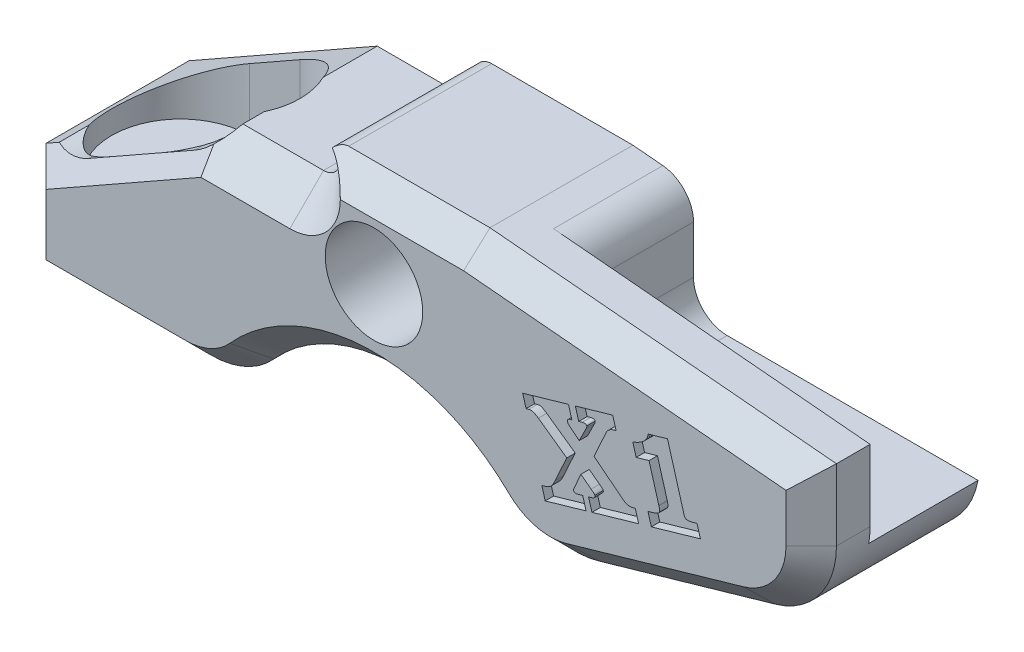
ISO-10303-21;
HEADER;
FILE_DESCRIPTION(('STEP AP214'),'2;1');
FILE_NAME('part.step','',(''),(''),'','','');
FILE_SCHEMA(('AUTOMOTIVE_DESIGN { 1 0 10303 214 1 1 1 1 }'));
ENDSEC;
DATA;
#1=APPLICATION_CONTEXT('core data for automotive mechanical design processes');
#2=APPLICATION_PROTOCOL_DEFINITION('international standard','automotive_design',2000,#1);
#3=PRODUCT_CONTEXT('',#1,'mechanical');
#4=PRODUCT('Part','Part','',(#3));
#5=PRODUCT_RELATED_PRODUCT_CATEGORY('part','',(#4));
#6=PRODUCT_DEFINITION_FORMATION('','',#4);
#7=PRODUCT_DEFINITION_CONTEXT('part definition',#1,'design');
#8=PRODUCT_DEFINITION('design','',#6,#7);
#9=PRODUCT_DEFINITION_SHAPE('','',#8);
#10=(LENGTH_UNIT() NAMED_UNIT(*) SI_UNIT(.MILLI.,.METRE.));
#11=(NAMED_UNIT(*) PLANE_ANGLE_UNIT() SI_UNIT($,.RADIAN.));
#12=(NAMED_UNIT(*) SI_UNIT($,.STERADIAN.) SOLID_ANGLE_UNIT());
#13=UNCERTAINTY_MEASURE_WITH_UNIT(LENGTH_MEASURE(1.E-05),#10,'distance_accuracy_value','');
#14=(GEOMETRIC_REPRESENTATION_CONTEXT(3) GLOBAL_UNCERTAINTY_ASSIGNED_CONTEXT((#13)) GLOBAL_UNIT_ASSIGNED_CONTEXT((#10,
#11,#12)) REPRESENTATION_CONTEXT('',''));
#15=CARTESIAN_POINT('',(0.,0.,0.));
#16=DIRECTION('',(0.,0.,1.));
#17=DIRECTION('',(1.,0.,0.));
#18=AXIS2_PLACEMENT_3D('',#15,#16,#17);
#19=CARTESIAN_POINT('',(0.,-15.,10.));
#20=DIRECTION('',(0.,0.,1.));
#21=DIRECTION('',(1.,0.,0.));
#22=AXIS2_PLACEMENT_3D('',#19,#20,#21);
#23=PLANE('',#22);
#24=CARTESIAN_POINT('',(0.,0.,10.));
#25=DIRECTION('',(0.,0.,1.));
#26=DIRECTION('',(1.,0.,0.));
#27=AXIS2_PLACEMENT_3D('',#24,#25,#26);
#28=CIRCLE('',#27,2.9);
#29=CARTESIAN_POINT('',(2.9,0.,10.));
#30=VERTEX_POINT('',#29);
#31=EDGE_CURVE('E2350',#30,#30,#28,.T.);
#32=ORIENTED_EDGE('',*,*,#31,.F.);
#33=EDGE_LOOP('',(#32));
#34=FACE_BOUND('',#33,.T.);
#35=DIRECTION('',(-1.,0.,0.));
#36=VECTOR('',#35,1.);
#37=CARTESIAN_POINT('',(-5.4,3.35198400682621,10.));
#38=LINE('',#37,#36);
#39=CARTESIAN_POINT('',(5.33270909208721,3.35198400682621,10.));
#40=VERTEX_POINT('',#39);
#41=CARTESIAN_POINT('',(-2.00000000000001,3.35198400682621,10.));
#42=VERTEX_POINT('',#41);
#43=EDGE_CURVE('E1077',#40,#42,#38,.T.);
#44=ORIENTED_EDGE('',*,*,#43,.T.);
#45=CARTESIAN_POINT('',(-5.00000000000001,3.35198400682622,10.));
#46=DIRECTION('',(0.,0.,1.));
#47=DIRECTION('',(1.,0.,0.));
#48=AXIS2_PLACEMENT_3D('',#45,#46,#47);
#49=CIRCLE('',#48,2.99999999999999);
#50=CARTESIAN_POINT('',(-5.00000000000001,0.351984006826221,10.));
#51=VERTEX_POINT('',#50);
#52=EDGE_CURVE('E850',#42,#51,#49,.F.);
#53=ORIENTED_EDGE('',*,*,#52,.T.);
#54=DIRECTION('',(-1.,0.,0.));
#55=VECTOR('',#54,1.);
#56=CARTESIAN_POINT('',(-6.76639053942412,0.351984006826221,10.));
#57=LINE('',#56,#55);
#58=CARTESIAN_POINT('',(-10.2910241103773,0.351984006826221,10.));
#59=VERTEX_POINT('',#58);
#60=EDGE_CURVE('E849',#51,#59,#57,.T.);
#61=ORIENTED_EDGE('',*,*,#60,.T.);
#62=DIRECTION('',(-0.869735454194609,-0.493518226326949,0.));
#63=VECTOR('',#62,1.);
#64=CARTESIAN_POINT('',(-20.2597226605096,-5.30460318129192,10.));
#65=LINE('',#64,#63);
#66=CARTESIAN_POINT('',(-19.5,-4.87351005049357,10.));
#67=VERTEX_POINT('',#66);
#68=EDGE_CURVE('E1075',#59,#67,#65,.T.);
#69=ORIENTED_EDGE('',*,*,#68,.T.);
#70=DIRECTION('',(0.,-1.,0.));
#71=VECTOR('',#70,1.);
#72=CARTESIAN_POINT('',(-19.5,-10.,10.));
#73=LINE('',#72,#71);
#74=CARTESIAN_POINT('',(-19.5,-8.5,10.));
#75=VERTEX_POINT('',#74);
#76=EDGE_CURVE('E1079',#67,#75,#73,.T.);
#77=ORIENTED_EDGE('',*,*,#76,.T.);
#78=DIRECTION('',(1.,0.,0.));
#79=VECTOR('',#78,1.);
#80=CARTESIAN_POINT('',(-11.1803398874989,-8.5,10.));
#81=LINE('',#80,#79);
#82=CARTESIAN_POINT('',(-11.1803398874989,-8.5,10.));
#83=VERTEX_POINT('',#82);
#84=EDGE_CURVE('E1083',#75,#83,#81,.T.);
#85=ORIENTED_EDGE('',*,*,#84,.T.);
#86=CARTESIAN_POINT('',(-11.1803398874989,-5.,10.));
#87=DIRECTION('',(0.,0.,1.));
#88=DIRECTION('',(1.,0.,0.));
#89=AXIS2_PLACEMENT_3D('',#86,#87,#88);
#90=CIRCLE('',#89,3.5);
#91=CARTESIAN_POINT('',(-8.57159391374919,-7.33333333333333,10.));
#92=VERTEX_POINT('',#91);
#93=EDGE_CURVE('E1088',#83,#92,#90,.T.);
#94=ORIENTED_EDGE('',*,*,#93,.T.);
#95=CARTESIAN_POINT('',(0.,-15.,10.));
#96=DIRECTION('',(0.,0.,1.));
#97=DIRECTION('',(1.,0.,0.));
#98=AXIS2_PLACEMENT_3D('',#95,#96,#97);
#99=CIRCLE('',#98,11.5);
#100=CARTESIAN_POINT('',(8.03664000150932,-6.77428316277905,10.));
#101=VERTEX_POINT('',#100);
#102=EDGE_CURVE('E1092',#92,#101,#99,.F.);
#103=ORIENTED_EDGE('',*,*,#102,.T.);
#104=CARTESIAN_POINT('',(10.4825739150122,-4.27080412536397,10.));
#105=DIRECTION('',(0.,0.,1.));
#106=DIRECTION('',(1.,0.,0.));
#107=AXIS2_PLACEMENT_3D('',#104,#105,#106);
#108=CIRCLE('',#107,3.5);
#109=CARTESIAN_POINT('',(11.452304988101,-7.6337822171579,10.));
#110=VERTEX_POINT('',#109);
#111=EDGE_CURVE('E1094',#101,#110,#108,.T.);
#112=ORIENTED_EDGE('',*,*,#111,.T.);
#113=DIRECTION('',(0.960850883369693,0.277066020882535,0.));
#114=VECTOR('',#113,1.);
#115=CARTESIAN_POINT('',(21.9697310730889,-4.60103130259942,10.));
#116=LINE('',#115,#114);
#117=CARTESIAN_POINT('',(21.9697310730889,-4.60103130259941,10.));
#118=VERTEX_POINT('',#117);
#119=EDGE_CURVE('E1096',#110,#118,#116,.T.);
#120=ORIENTED_EDGE('',*,*,#119,.T.);
#121=CARTESIAN_POINT('',(21.,-1.23805321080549,10.));
#122=DIRECTION('',(0.,0.,1.));
#123=DIRECTION('',(1.,0.,0.));
#124=AXIS2_PLACEMENT_3D('',#121,#122,#123);
#125=CIRCLE('',#124,3.5);
#126=CARTESIAN_POINT('',(24.5,-1.23805321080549,10.));
#127=VERTEX_POINT('',#126);
#128=EDGE_CURVE('E1090',#118,#127,#125,.T.);
#129=ORIENTED_EDGE('',*,*,#128,.T.);
#130=DIRECTION('',(0.,1.,0.));
#131=VECTOR('',#130,1.);
#132=CARTESIAN_POINT('',(24.5,3.,10.));
#133=LINE('',#132,#131);
#134=CARTESIAN_POINT('',(24.5,1.62880360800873,10.));
#135=VERTEX_POINT('',#134);
#136=EDGE_CURVE('E1085',#127,#135,#133,.T.);
#137=ORIENTED_EDGE('',*,*,#136,.T.);
#138=DIRECTION('',(-0.99598313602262,0.089541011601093,0.));
#139=VECTOR('',#138,1.);
#140=CARTESIAN_POINT('',(5.26568848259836,3.35800930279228,10.));
#141=LINE('',#140,#139);
#142=EDGE_CURVE('E1081',#135,#40,#141,.T.);
#143=ORIENTED_EDGE('',*,*,#142,.T.);
#144=EDGE_LOOP('',(#44,#53,#61,#69,#77,#85,#94,#103,#112,#120,#129,#137,#143));
#145=FACE_BOUND('',#144,.T.);
#146=DIRECTION('',(0.416206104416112,0.909270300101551,0.));
#147=VECTOR('',#146,1.);
#148=CARTESIAN_POINT('',(10.772347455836,-4.73240826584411,10.));
#149=LINE('',#148,#147);
#150=CARTESIAN_POINT('',(10.772347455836,-4.73240826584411,10.));
#151=VERTEX_POINT('',#150);
#152=CARTESIAN_POINT('',(11.465706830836,-3.21765132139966,10.));
#153=VERTEX_POINT('',#152);
#154=EDGE_CURVE('E647',#151,#153,#149,.T.);
#155=ORIENTED_EDGE('',*,*,#154,.T.);
#156=DIRECTION('',(-0.814862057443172,0.579654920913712,0.));
#157=VECTOR('',#156,1.);
#158=CARTESIAN_POINT('',(11.465706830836,-3.21765132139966,10.));
#159=LINE('',#158,#157);
#160=CARTESIAN_POINT('',(9.7740835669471,-2.01430930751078,10.));
#161=VERTEX_POINT('',#160);
#162=EDGE_CURVE('E58',#153,#161,#159,.T.);
#163=ORIENTED_EDGE('',*,*,#162,.T.);
#164=CARTESIAN_POINT('',(9.7740835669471,-2.01430930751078,10.));
#165=CARTESIAN_POINT('',(9.74031223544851,-1.99188686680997,10.));
#166=CARTESIAN_POINT('',(9.67764516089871,-1.95027912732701,10.));
#167=CARTESIAN_POINT('',(9.58829533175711,-1.89820133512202,10.));
#168=CARTESIAN_POINT('',(9.51192884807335,-1.86031486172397,10.));
#169=CARTESIAN_POINT('',(9.42882572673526,-1.82889311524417,10.));
#170=CARTESIAN_POINT('',(9.32732335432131,-1.81553570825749,10.));
#171=CARTESIAN_POINT('',(9.25087077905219,-1.83221949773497,10.));
#172=CARTESIAN_POINT('',(9.21201759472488,-1.84069819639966,10.));
#173=B_SPLINE_CURVE_WITH_KNOTS('',3,(#164,#165,#166,#167,#168,#169,#170,#171,#172),
.UNSPECIFIED.,.F.,.F.,(4,1,1,1,1,1,4),(0.,0.199187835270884,0.369618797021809,0.507947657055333,
0.617594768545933,0.805661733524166,1.),.UNSPECIFIED.);
#174=CARTESIAN_POINT('',(9.21201759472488,-1.84069819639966,10.));
#175=VERTEX_POINT('',#174);
#176=EDGE_CURVE('E637',#161,#175,#173,.T.);
#177=ORIENTED_EDGE('',*,*,#176,.T.);
#178=DIRECTION('',(-0.961048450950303,-0.276379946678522,0.));
#179=VECTOR('',#178,1.);
#180=CARTESIAN_POINT('',(9.21201759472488,-1.84069819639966,10.));
#181=LINE('',#180,#179);
#182=CARTESIAN_POINT('',(9.04600196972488,-1.88844125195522,10.));
#183=VERTEX_POINT('',#182);
#184=EDGE_CURVE('E2100',#175,#183,#181,.T.);
#185=ORIENTED_EDGE('',*,*,#184,.T.);
#186=DIRECTION('',(-0.277693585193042,0.960669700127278,0.));
#187=VECTOR('',#186,1.);
#188=CARTESIAN_POINT('',(9.04600196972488,-1.88844125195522,10.));
#189=LINE('',#188,#187);
#190=CARTESIAN_POINT('',(8.84526412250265,-1.19399680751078,10.));
#191=VERTEX_POINT('',#190);
#192=EDGE_CURVE('E2106',#183,#191,#189,.T.);
#193=ORIENTED_EDGE('',*,*,#192,.T.);
#194=DIRECTION('',(0.960841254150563,0.277099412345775,0.));
#195=VECTOR('',#194,1.);
#196=CARTESIAN_POINT('',(8.84526412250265,-1.19399680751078,10.));
#197=LINE('',#196,#195);
#198=CARTESIAN_POINT('',(11.5655332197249,-0.409491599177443,10.));
#199=VERTEX_POINT('',#198);
#200=EDGE_CURVE('E2109',#191,#199,#197,.T.);
#201=ORIENTED_EDGE('',*,*,#200,.T.);
#202=DIRECTION('',(0.277693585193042,-0.960669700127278,0.));
#203=VECTOR('',#202,1.);
#204=CARTESIAN_POINT('',(11.5655332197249,-0.409491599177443,10.));
#205=LINE('',#204,#203);
#206=CARTESIAN_POINT('',(11.7662710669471,-1.10393604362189,10.));
#207=VERTEX_POINT('',#206);
#208=EDGE_CURVE('E2112',#199,#207,#205,.T.);
#209=ORIENTED_EDGE('',*,*,#208,.T.);
#210=DIRECTION('',(-0.961878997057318,-0.273475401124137,0.));
#211=VECTOR('',#210,1.);
#212=CARTESIAN_POINT('',(11.7662710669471,-1.10393604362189,10.));
#213=LINE('',#212,#211);
#214=CARTESIAN_POINT('',(11.6555939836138,-1.13540305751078,10.));
#215=VERTEX_POINT('',#214);
#216=EDGE_CURVE('E2115',#207,#215,#213,.T.);
#217=ORIENTED_EDGE('',*,*,#216,.T.);
#218=CARTESIAN_POINT('',(11.6555939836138,-1.13540305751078,10.));
#219=CARTESIAN_POINT('',(11.6286494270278,-1.14446953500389,10.));
#220=CARTESIAN_POINT('',(11.5794432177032,-1.1610267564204,10.));
#221=CARTESIAN_POINT('',(11.5233466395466,-1.20907406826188,10.));
#222=CARTESIAN_POINT('',(11.4950564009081,-1.27149219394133,10.));
#223=CARTESIAN_POINT('',(11.5022000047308,-1.31354382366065,10.));
#224=CARTESIAN_POINT('',(11.5058544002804,-1.33505583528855,10.));
#225=B_SPLINE_CURVE_WITH_KNOTS('',3,(#218,#219,#220,#221,#222,#223,#224),.UNSPECIFIED.,.F.,.F.,
(4,1,1,1,4),(0.,0.302276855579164,0.552018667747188,0.770829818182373,1.),.UNSPECIFIED.);
#226=CARTESIAN_POINT('',(11.5058544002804,-1.33505583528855,10.));
#227=VERTEX_POINT('',#226);
#228=EDGE_CURVE('E2118',#215,#227,#225,.T.);
#229=ORIENTED_EDGE('',*,*,#228,.T.);
#230=CARTESIAN_POINT('',(11.5058544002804,-1.33505583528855,10.));
#231=CARTESIAN_POINT('',(11.5125510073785,-1.35054667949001,10.));
#232=CARTESIAN_POINT('',(11.5275982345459,-1.38535449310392,10.));
#233=CARTESIAN_POINT('',(11.5670960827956,-1.43691718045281,10.));
#234=CARTESIAN_POINT('',(11.6238864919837,-1.49496863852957,10.));
#235=CARTESIAN_POINT('',(11.6700070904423,-1.53370868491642,10.));
#236=CARTESIAN_POINT('',(11.6957415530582,-1.55532493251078,10.));
#237=B_SPLINE_CURVE_WITH_KNOTS('',3,(#230,#231,#232,#233,#234,#235,#236),.UNSPECIFIED.,.F.,.F.,
(4,1,1,1,4),(0.,0.171700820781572,0.385810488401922,0.657293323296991,1.),.UNSPECIFIED.);
#238=CARTESIAN_POINT('',(11.6957415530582,-1.55532493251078,10.));
#239=VERTEX_POINT('',#238);
#240=EDGE_CURVE('E2123',#227,#239,#237,.T.);
#241=ORIENTED_EDGE('',*,*,#240,.T.);
#242=DIRECTION('',(0.788631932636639,-0.614865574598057,0.));
#243=VECTOR('',#242,1.);
#244=CARTESIAN_POINT('',(11.6957415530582,-1.55532493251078,10.));
#245=LINE('',#244,#243);
#246=CARTESIAN_POINT('',(12.207894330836,-1.95463048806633,10.));
#247=VERTEX_POINT('',#246);
#248=EDGE_CURVE('E2131',#239,#247,#245,.T.);
#249=ORIENTED_EDGE('',*,*,#248,.T.);
#250=DIRECTION('',(0.443494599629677,0.896277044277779,0.));
#251=VECTOR('',#250,1.);
#252=CARTESIAN_POINT('',(12.207894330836,-1.95463048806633,10.));
#253=LINE('',#252,#251);
#254=CARTESIAN_POINT('',(12.6223908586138,-1.11695687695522,10.));
#255=VERTEX_POINT('',#254);
#256=EDGE_CURVE('E2137',#247,#255,#253,.T.);
#257=ORIENTED_EDGE('',*,*,#256,.T.);
#258=CARTESIAN_POINT('',(12.6223908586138,-1.11695687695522,10.));
#259=CARTESIAN_POINT('',(12.6294156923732,-1.10195333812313,10.));
#260=CARTESIAN_POINT('',(12.6416990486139,-1.07571872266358,10.));
#261=CARTESIAN_POINT('',(12.6518360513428,-1.03826052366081,10.));
#262=CARTESIAN_POINT('',(12.656171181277,-1.00809223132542,10.));
#263=CARTESIAN_POINT('',(12.653825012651,-0.990360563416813,10.));
#264=CARTESIAN_POINT('',(12.6527728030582,-0.982408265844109,10.));
#265=B_SPLINE_CURVE_WITH_KNOTS('',3,(#258,#259,#260,#261,#262,#263,#264),.UNSPECIFIED.,.F.,.F.,
(4,1,1,1,4),(0.,0.353792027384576,0.618627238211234,0.828961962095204,1.),.UNSPECIFIED.);
#266=CARTESIAN_POINT('',(12.6527728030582,-0.982408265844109,10.));
#267=VERTEX_POINT('',#266);
#268=EDGE_CURVE('E2140',#255,#267,#265,.T.);
#269=ORIENTED_EDGE('',*,*,#268,.T.);
#270=CARTESIAN_POINT('',(12.6527728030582,-0.982408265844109,10.));
#271=CARTESIAN_POINT('',(12.6492568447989,-0.973499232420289,10.));
#272=CARTESIAN_POINT('',(12.6424328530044,-0.956208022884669,10.));
#273=CARTESIAN_POINT('',(12.6238455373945,-0.933522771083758,10.));
#274=CARTESIAN_POINT('',(12.5967047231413,-0.919428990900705,10.));
#275=CARTESIAN_POINT('',(12.5517208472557,-0.903556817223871,10.));
#276=CARTESIAN_POINT('',(12.4784834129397,-0.902226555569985,10.));
#277=CARTESIAN_POINT('',(12.4198647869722,-0.916743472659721,10.));
#278=CARTESIAN_POINT('',(12.3869307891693,-0.924899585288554,10.));
#279=B_SPLINE_CURVE_WITH_KNOTS('',3,(#270,#271,#272,#273,#274,#275,#276,#277,#278),
.UNSPECIFIED.,.F.,.F.,(4,1,1,1,1,1,4),(0.,0.0954630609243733,0.185280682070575,
0.285748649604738,0.396669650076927,0.661027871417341,1.),.UNSPECIFIED.);
#280=CARTESIAN_POINT('',(12.3869307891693,-0.924899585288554,10.));
#281=VERTEX_POINT('',#280);
#282=EDGE_CURVE('E2145',#267,#281,#279,.T.);
#283=ORIENTED_EDGE('',*,*,#282,.T.);
#284=DIRECTION('',(-0.961151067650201,-0.276022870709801,0.));
#285=VECTOR('',#284,1.);
#286=CARTESIAN_POINT('',(12.3869307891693,-0.924899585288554,10.));
#287=LINE('',#286,#285);
#288=CARTESIAN_POINT('',(12.1753422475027,-0.985663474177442,10.));
#289=VERTEX_POINT('',#288);
#290=EDGE_CURVE('E2153',#281,#289,#287,.T.);
#291=ORIENTED_EDGE('',*,*,#290,.T.);
#292=DIRECTION('',(-0.277693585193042,0.960669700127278,0.));
#293=VECTOR('',#292,1.);
#294=CARTESIAN_POINT('',(12.1753422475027,-0.985663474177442,10.));
#295=LINE('',#294,#293);
#296=CARTESIAN_POINT('',(11.9746044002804,-0.291219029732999,10.));
#297=VERTEX_POINT('',#296);
#298=EDGE_CURVE('E2159',#289,#297,#295,.T.);
#299=ORIENTED_EDGE('',*,*,#298,.T.);
#300=DIRECTION('',(0.960794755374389,0.277260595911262,0.));
#301=VECTOR('',#300,1.);
#302=CARTESIAN_POINT('',(11.9746044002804,-0.291219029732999,10.));
#303=LINE('',#302,#301);
#304=CARTESIAN_POINT('',(14.1968266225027,0.350057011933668,10.));
#305=VERTEX_POINT('',#304);
#306=EDGE_CURVE('E2162',#297,#305,#303,.T.);
#307=ORIENTED_EDGE('',*,*,#306,.T.);
#308=DIRECTION('',(0.277693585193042,-0.960669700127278,0.));
#309=VECTOR('',#308,1.);
#310=CARTESIAN_POINT('',(14.1968266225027,0.350057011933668,10.));
#311=LINE('',#310,#309);
#312=CARTESIAN_POINT('',(14.3975644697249,-0.344387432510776,10.));
#313=VERTEX_POINT('',#312);
#314=EDGE_CURVE('E2165',#305,#313,#311,.T.);
#315=ORIENTED_EDGE('',*,*,#314,.T.);
#316=DIRECTION('',(-0.960084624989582,-0.279709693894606,0.));
#317=VECTOR('',#316,1.);
#318=CARTESIAN_POINT('',(14.3975644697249,-0.344387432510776,10.));
#319=LINE('',#318,#317);
#320=CARTESIAN_POINT('',(14.2597606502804,-0.384535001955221,10.));
#321=VERTEX_POINT('',#320);
#322=EDGE_CURVE('E2168',#313,#321,#319,.T.);
#323=ORIENTED_EDGE('',*,*,#322,.T.);
#324=CARTESIAN_POINT('',(14.2597606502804,-0.384535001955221,10.));
#325=CARTESIAN_POINT('',(14.2324228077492,-0.393008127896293,10.));
#326=CARTESIAN_POINT('',(14.1793839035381,-0.409447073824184,10.));
#327=CARTESIAN_POINT('',(14.1053761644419,-0.442854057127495,10.));
#328=CARTESIAN_POINT('',(14.0370672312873,-0.479345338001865,10.));
#329=CARTESIAN_POINT('',(13.9761851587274,-0.522775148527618,10.));
#330=CARTESIAN_POINT('',(13.92294606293,-0.572211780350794,10.));
#331=CARTESIAN_POINT('',(13.8748790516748,-0.625939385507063,10.));
#332=CARTESIAN_POINT('',(13.8351929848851,-0.686701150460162,10.));
#333=CARTESIAN_POINT('',(13.8137173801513,-0.730437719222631,10.));
#334=CARTESIAN_POINT('',(13.8029464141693,-0.752373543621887,10.));
#335=B_SPLINE_CURVE_WITH_KNOTS('',3,(#324,#325,#326,#327,#328,#329,#330,#331,#332,#333,#334),
.UNSPECIFIED.,.F.,.F.,(4,1,1,1,1,1,1,1,4),(0.,0.141353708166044,0.274244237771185,
0.40067483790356,0.523722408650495,0.642674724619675,0.759237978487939,0.879247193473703,1.),.UNSPECIFIED.);
#336=CARTESIAN_POINT('',(13.8029464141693,-0.752373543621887,10.));
#337=VERTEX_POINT('',#336);
#338=EDGE_CURVE('E2171',#321,#337,#335,.T.);
#339=ORIENTED_EDGE('',*,*,#338,.T.);
#340=DIRECTION('',(-0.415596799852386,-0.909548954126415,0.));
#341=VECTOR('',#340,1.);
#342=CARTESIAN_POINT('',(13.8029464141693,-0.752373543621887,10.));
#343=LINE('',#342,#341);
#344=CARTESIAN_POINT('',(13.0835453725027,-2.32680930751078,10.));
#345=VERTEX_POINT('',#344);
#346=EDGE_CURVE('E2176',#337,#345,#343,.T.);
#347=ORIENTED_EDGE('',*,*,#346,.T.);
#348=DIRECTION('',(0.78528766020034,-0.619131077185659,0.));
#349=VECTOR('',#348,1.);
#350=CARTESIAN_POINT('',(13.0835453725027,-2.32680930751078,10.));
#351=LINE('',#350,#349);
#352=CARTESIAN_POINT('',(14.8066356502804,-3.68531625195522,10.));
#353=VERTEX_POINT('',#352);
#354=EDGE_CURVE('E2182',#345,#353,#351,.T.);
#355=ORIENTED_EDGE('',*,*,#354,.T.);
#356=CARTESIAN_POINT('',(14.8066356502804,-3.68531625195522,10.));
#357=CARTESIAN_POINT('',(14.8294873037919,-3.70202102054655,10.));
#358=CARTESIAN_POINT('',(14.8741847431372,-3.73469525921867,10.));
#359=CARTESIAN_POINT('',(14.9451097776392,-3.77561826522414,10.));
#360=CARTESIAN_POINT('',(15.018188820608,-3.80521554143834,10.));
#361=CARTESIAN_POINT('',(15.0908027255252,-3.82893801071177,10.));
#362=CARTESIAN_POINT('',(15.1641941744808,-3.84213393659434,10.));
#363=CARTESIAN_POINT('',(15.2367101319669,-3.84497499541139,10.));
#364=CARTESIAN_POINT('',(15.3084143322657,-3.84042234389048,10.));
#365=CARTESIAN_POINT('',(15.3543552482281,-3.82889694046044,10.));
#366=CARTESIAN_POINT('',(15.3773821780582,-3.82312007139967,10.));
#367=B_SPLINE_CURVE_WITH_KNOTS('',3,(#356,#357,#358,#359,#360,#361,#362,#363,#364,#365,#366),
.UNSPECIFIED.,.F.,.F.,(4,1,1,1,1,1,1,1,4),(0.,0.139286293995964,0.272441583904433,
0.401720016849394,0.526723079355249,0.647902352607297,0.767303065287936,0.883365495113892,1.),.UNSPECIFIED.);
#368=CARTESIAN_POINT('',(15.3773821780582,-3.82312007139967,10.));
#369=VERTEX_POINT('',#368);
#370=EDGE_CURVE('E2185',#353,#369,#367,.T.);
#371=ORIENTED_EDGE('',*,*,#370,.T.);
#372=DIRECTION('',(0.960290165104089,0.279003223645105,0.));
#373=VECTOR('',#372,1.);
#374=CARTESIAN_POINT('',(15.3773821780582,-3.82312007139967,10.));
#375=LINE('',#374,#373);
#376=CARTESIAN_POINT('',(15.537972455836,-3.77646208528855,10.));
#377=VERTEX_POINT('',#376);
#378=EDGE_CURVE('E2190',#369,#377,#375,.T.);
#379=ORIENTED_EDGE('',*,*,#378,.T.);
#380=DIRECTION('',(0.277693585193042,-0.960669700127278,0.));
#381=VECTOR('',#380,1.);
#382=CARTESIAN_POINT('',(15.537972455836,-3.77646208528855,10.));
#383=LINE('',#382,#381);
#384=CARTESIAN_POINT('',(15.7387103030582,-4.470906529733,10.));
#385=VERTEX_POINT('',#384);
#386=EDGE_CURVE('E2196',#377,#385,#383,.T.);
#387=ORIENTED_EDGE('',*,*,#386,.T.);
#388=DIRECTION('',(-0.960769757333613,-0.277347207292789,0.));
#389=VECTOR('',#388,1.);
#390=CARTESIAN_POINT('',(15.7387103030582,-4.470906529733,10.));
#391=LINE('',#390,#389);
#392=CARTESIAN_POINT('',(12.9609325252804,-5.27277284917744,10.));
#393=VERTEX_POINT('',#392);
#394=EDGE_CURVE('E2199',#385,#393,#391,.T.);
#395=ORIENTED_EDGE('',*,*,#394,.T.);
#396=DIRECTION('',(-0.277693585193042,0.960669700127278,0.));
#397=VECTOR('',#396,1.);
#398=CARTESIAN_POINT('',(12.9609325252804,-5.27277284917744,10.));
#399=LINE('',#398,#397);
#400=CARTESIAN_POINT('',(12.7601946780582,-4.578328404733,10.));
#401=VERTEX_POINT('',#400);
#402=EDGE_CURVE('E2202',#393,#401,#399,.T.);
#403=ORIENTED_EDGE('',*,*,#402,.T.);
#404=DIRECTION('',(0.960606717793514,0.277911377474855,0.));
#405=VECTOR('',#404,1.);
#406=CARTESIAN_POINT('',(12.7601946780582,-4.578328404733,10.));
#407=LINE('',#406,#405);
#408=CARTESIAN_POINT('',(12.9327207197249,-4.52841521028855,10.));
#409=VERTEX_POINT('',#408);
#410=EDGE_CURVE('E2205',#401,#409,#407,.T.);
#411=ORIENTED_EDGE('',*,*,#410,.T.);
#412=CARTESIAN_POINT('',(12.9327207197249,-4.52841521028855,10.));
#413=CARTESIAN_POINT('',(12.9516566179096,-4.52264584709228,10.));
#414=CARTESIAN_POINT('',(12.9868640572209,-4.51191889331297,10.));
#415=CARTESIAN_POINT('',(13.0347960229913,-4.49117649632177,10.));
#416=CARTESIAN_POINT('',(13.073540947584,-4.46738087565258,10.));
#417=CARTESIAN_POINT('',(13.105371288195,-4.44250680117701,10.));
#418=CARTESIAN_POINT('',(13.1279678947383,-4.41401041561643,10.));
#419=CARTESIAN_POINT('',(13.1402618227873,-4.38228363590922,10.));
#420=CARTESIAN_POINT('',(13.1441083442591,-4.34796175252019,10.));
#421=CARTESIAN_POINT('',(13.1385538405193,-4.32543472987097,10.));
#422=CARTESIAN_POINT('',(13.135628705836,-4.31357146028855,10.));
#423=B_SPLINE_CURVE_WITH_KNOTS('',3,(#412,#413,#414,#415,#416,#417,#418,#419,#420,#421,#422),
.UNSPECIFIED.,.F.,.F.,(4,1,1,1,1,1,1,1,4),(0.,0.178365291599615,0.331633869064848,
0.469185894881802,0.587323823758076,0.6942694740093,0.792349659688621,0.89064635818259,1.),.UNSPECIFIED.);
#424=CARTESIAN_POINT('',(13.135628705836,-4.31357146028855,10.));
#425=VERTEX_POINT('',#424);
#426=EDGE_CURVE('E2208',#409,#425,#423,.T.);
#427=ORIENTED_EDGE('',*,*,#426,.T.);
#428=CARTESIAN_POINT('',(13.135628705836,-4.31357146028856,10.));
#429=CARTESIAN_POINT('',(13.1294333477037,-4.30008496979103,10.));
#430=CARTESIAN_POINT('',(13.1147299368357,-4.26807755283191,10.));
#431=CARTESIAN_POINT('',(13.0790175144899,-4.23509749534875,10.));
#432=CARTESIAN_POINT('',(13.0436418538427,-4.20148220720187,10.));
#433=CARTESIAN_POINT('',(13.0068609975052,-4.17203415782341,10.));
#434=CARTESIAN_POINT('',(12.9629759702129,-4.1377290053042,9.99999999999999));
#435=CARTESIAN_POINT('',(12.9306468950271,-4.11451713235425,10.));
#436=CARTESIAN_POINT('',(12.9131894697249,-4.10198291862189,10.));
#437=B_SPLINE_CURVE_WITH_KNOTS('',3,(#428,#429,#430,#431,#432,#433,#434,#435,#436),
.UNSPECIFIED.,.F.,.F.,(4,1,1,1,1,1,4),(0.,0.142305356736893,0.337732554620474,0.461430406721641,
0.615409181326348,0.792324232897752,1.),.UNSPECIFIED.);
#438=CARTESIAN_POINT('',(12.9131894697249,-4.10198291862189,10.));
#439=VERTEX_POINT('',#438);
#440=EDGE_CURVE('E2213',#425,#439,#437,.T.);
#441=ORIENTED_EDGE('',*,*,#440,.T.);
#442=DIRECTION('',(-0.797609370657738,0.603174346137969,0.));
#443=VECTOR('',#442,1.);
#444=CARTESIAN_POINT('',(12.9131894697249,-4.10198291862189,10.));
#445=LINE('',#444,#443);
#446=CARTESIAN_POINT('',(12.3033804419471,-3.640828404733,10.));
#447=VERTEX_POINT('',#446);
#448=EDGE_CURVE('E2221',#439,#447,#445,.T.);
#449=ORIENTED_EDGE('',*,*,#448,.T.);
#450=DIRECTION('',(-0.401156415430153,-0.916009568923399,0.));
#451=VECTOR('',#450,1.);
#452=CARTESIAN_POINT('',(12.3033804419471,-3.640828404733,10.));
#453=LINE('',#452,#451);
#454=CARTESIAN_POINT('',(11.8975644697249,-4.56747771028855,10.));
#455=VERTEX_POINT('',#454);
#456=EDGE_CURVE('E2227',#447,#455,#453,.T.);
#457=ORIENTED_EDGE('',*,*,#456,.T.);
#458=CARTESIAN_POINT('',(11.8975644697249,-4.56747771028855,10.));
#459=CARTESIAN_POINT('',(11.8923550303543,-4.58116604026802,10.));
#460=CARTESIAN_POINT('',(11.8824630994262,-4.60715809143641,10.));
#461=CARTESIAN_POINT('',(11.870887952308,-4.64418247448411,10.));
#462=CARTESIAN_POINT('',(11.8670966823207,-4.67673080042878,10.));
#463=CARTESIAN_POINT('',(11.8694271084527,-4.69588845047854,10.));
#464=CARTESIAN_POINT('',(11.8704377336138,-4.70419646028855,10.));
#465=B_SPLINE_CURVE_WITH_KNOTS('',3,(#458,#459,#460,#461,#462,#463,#464),.UNSPECIFIED.,.F.,.F.,
(4,1,1,1,4),(0.,0.311194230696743,0.590910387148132,0.822591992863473,1.),.UNSPECIFIED.);
#466=CARTESIAN_POINT('',(11.8704377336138,-4.70419646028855,10.));
#467=VERTEX_POINT('',#466);
#468=EDGE_CURVE('E2230',#455,#467,#465,.T.);
#469=ORIENTED_EDGE('',*,*,#468,.T.);
#470=CARTESIAN_POINT('',(11.8704377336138,-4.70419646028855,10.));
#471=CARTESIAN_POINT('',(11.8738041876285,-4.71324840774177,10.));
#472=CARTESIAN_POINT('',(11.8803277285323,-4.73078934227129,10.));
#473=CARTESIAN_POINT('',(11.9008099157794,-4.75117641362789,10.));
#474=CARTESIAN_POINT('',(11.9266290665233,-4.76696043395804,10.));
#475=CARTESIAN_POINT('',(11.9739433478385,-4.77993301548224,10.));
#476=CARTESIAN_POINT('',(12.0486321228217,-4.7798220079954,10.));
#477=CARTESIAN_POINT('',(12.1090750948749,-4.764709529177,10.));
#478=CARTESIAN_POINT('',(12.1427901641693,-4.75627979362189,10.));
#479=B_SPLINE_CURVE_WITH_KNOTS('',3,(#470,#471,#472,#473,#474,#475,#476,#477,#478),
.UNSPECIFIED.,.F.,.F.,(4,1,1,1,1,1,4),(0.,0.0938414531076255,0.181846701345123,
0.277554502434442,0.38888466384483,0.659120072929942,1.),.UNSPECIFIED.);
#480=CARTESIAN_POINT('',(12.1427901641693,-4.75627979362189,10.));
#481=VERTEX_POINT('',#480);
#482=EDGE_CURVE('E2235',#467,#481,#479,.T.);
#483=ORIENTED_EDGE('',*,*,#482,.T.);
#484=DIRECTION('',(0.960645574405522,0.277777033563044,0.));
#485=VECTOR('',#484,1.);
#486=CARTESIAN_POINT('',(12.1427901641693,-4.75627979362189,10.));
#487=LINE('',#486,#485);
#488=CARTESIAN_POINT('',(12.412972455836,-4.67815479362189,10.));
#489=VERTEX_POINT('',#488);
#490=EDGE_CURVE('E2243',#481,#489,#487,.T.);
#491=ORIENTED_EDGE('',*,*,#490,.T.);
#492=DIRECTION('',(0.277693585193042,-0.960669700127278,0.));
#493=VECTOR('',#492,1.);
#494=CARTESIAN_POINT('',(12.412972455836,-4.67815479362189,10.));
#495=LINE('',#494,#493);
#496=CARTESIAN_POINT('',(12.6137103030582,-5.37259923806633,10.));
#497=VERTEX_POINT('',#496);
#498=EDGE_CURVE('E2249',#489,#497,#495,.T.);
#499=ORIENTED_EDGE('',*,*,#498,.T.);
#500=DIRECTION('',(-0.960841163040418,-0.277099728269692,0.));
#501=VECTOR('',#500,1.);
#502=CARTESIAN_POINT('',(12.6137103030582,-5.37259923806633,10.));
#503=LINE('',#502,#501);
#504=CARTESIAN_POINT('',(10.1831547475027,-6.07355409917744,10.));
#505=VERTEX_POINT('',#504);
#506=EDGE_CURVE('E2252',#497,#505,#503,.T.);
#507=ORIENTED_EDGE('',*,*,#506,.T.);
#508=DIRECTION('',(-0.277693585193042,0.960669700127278,0.));
#509=VECTOR('',#508,1.);
#510=CARTESIAN_POINT('',(10.1831547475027,-6.07355409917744,10.));
#511=LINE('',#510,#509);
#512=CARTESIAN_POINT('',(9.98241690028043,-5.379109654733,10.));
#513=VERTEX_POINT('',#512);
#514=EDGE_CURVE('E2255',#505,#513,#511,.T.);
#515=ORIENTED_EDGE('',*,*,#514,.T.);
#516=DIRECTION('',(0.960772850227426,0.277336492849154,0.));
#517=VECTOR('',#516,1.);
#518=CARTESIAN_POINT('',(9.98241690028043,-5.379109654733,10.));
#519=LINE('',#518,#517);
#520=CARTESIAN_POINT('',(10.1929203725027,-5.31834576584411,10.));
#521=VERTEX_POINT('',#520);
#522=EDGE_CURVE('E2258',#513,#521,#519,.T.);
#523=ORIENTED_EDGE('',*,*,#522,.T.);
#524=CARTESIAN_POINT('',(10.1929203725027,-5.31834576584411,10.));
#525=CARTESIAN_POINT('',(10.2243231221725,-5.30863498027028,10.));
#526=CARTESIAN_POINT('',(10.2851363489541,-5.28982948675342,10.));
#527=CARTESIAN_POINT('',(10.3692946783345,-5.24946730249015,10.));
#528=CARTESIAN_POINT('',(10.445922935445,-5.20472457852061,10.));
#529=CARTESIAN_POINT('',(10.5158324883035,-5.14857874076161,10.));
#530=CARTESIAN_POINT('',(10.5816972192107,-5.07654406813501,10.));
#531=CARTESIAN_POINT('',(10.6449868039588,-4.98209220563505,10.));
#532=CARTESIAN_POINT('',(10.7111817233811,-4.86629347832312,10.));
#533=CARTESIAN_POINT('',(10.7510252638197,-4.77908025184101,10.));
#534=CARTESIAN_POINT('',(10.772347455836,-4.73240826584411,10.));
#535=B_SPLINE_CURVE_WITH_KNOTS('',3,(#524,#525,#526,#527,#528,#529,#530,#531,#532,#533,#534),
.UNSPECIFIED.,.F.,.F.,(4,1,1,1,1,1,1,1,4),(0.,0.114722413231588,0.222166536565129,
0.325355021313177,0.424258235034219,0.534288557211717,0.665079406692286,0.820767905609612,1.),.UNSPECIFIED.);
#536=EDGE_CURVE('E2261',#521,#151,#535,.T.);
#537=ORIENTED_EDGE('',*,*,#536,.T.);
#538=EDGE_LOOP('',(#155,#163,#177,#185,#193,#201,#209,#217,#229,#241,#249,#257,#269,#283,#291,
#299,#307,#315,#323,#339,#347,#355,#371,#379,#387,#395,#403,#411,#427,#441,#449,#457,#469,#483,
#491,#499,#507,#515,#523,#537));
#539=FACE_BOUND('',#538,.T.);
#540=DIRECTION('',(-0.27725265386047,0.960797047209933,0.));
#541=VECTOR('',#540,1.);
#542=CARTESIAN_POINT('',(16.9361457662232,-2.92080016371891,10.));
#543=LINE('',#542,#541);
#544=CARTESIAN_POINT('',(16.9361457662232,-2.92080016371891,10.));
#545=VERTEX_POINT('',#544);
#546=CARTESIAN_POINT('',(16.3556336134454,-0.909081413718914,10.));
#547=VERTEX_POINT('',#546);
#548=EDGE_CURVE('E630',#545,#547,#543,.T.);
#549=ORIENTED_EDGE('',*,*,#548,.T.);
#550=DIRECTION('',(-0.960851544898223,-0.277063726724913,0.));
#551=VECTOR('',#550,1.);
#552=CARTESIAN_POINT('',(16.3556336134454,-0.909081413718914,10.));
#553=LINE('',#552,#551);
#554=CARTESIAN_POINT('',(15.5917447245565,-1.12935051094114,10.));
#555=VERTEX_POINT('',#554);
#556=EDGE_CURVE('E50',#547,#555,#553,.T.);
#557=ORIENTED_EDGE('',*,*,#556,.T.);
#558=DIRECTION('',(-0.277693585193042,0.960669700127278,0.));
#559=VECTOR('',#558,1.);
#560=CARTESIAN_POINT('',(15.5917447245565,-1.12935051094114,10.));
#561=LINE('',#560,#559);
#562=CARTESIAN_POINT('',(15.3910068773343,-0.434906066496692,10.));
#563=VERTEX_POINT('',#562);
#564=EDGE_CURVE('E634',#555,#563,#561,.T.);
#565=ORIENTED_EDGE('',*,*,#564,.T.);
#566=CARTESIAN_POINT('',(15.3910068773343,-0.434906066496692,10.));
#567=CARTESIAN_POINT('',(15.4602611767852,-0.407916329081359,10.));
#568=CARTESIAN_POINT('',(15.5916460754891,-0.356713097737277,10.));
#569=CARTESIAN_POINT('',(15.7709335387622,-0.26480778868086,10.));
#570=CARTESIAN_POINT('',(15.9238044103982,-0.168214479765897,10.));
#571=CARTESIAN_POINT('',(16.0503103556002,-0.0641244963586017,10.));
#572=CARTESIAN_POINT('',(16.1506629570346,0.0472612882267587,10.));
#573=CARTESIAN_POINT('',(16.2265028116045,0.166372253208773,10.));
#574=CARTESIAN_POINT('',(16.277328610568,0.29394476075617,10.));
#575=CARTESIAN_POINT('',(16.2897536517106,0.383185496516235,10.));
#576=CARTESIAN_POINT('',(16.2959547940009,0.427724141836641,10.));
#577=B_SPLINE_CURVE_WITH_KNOTS('',3,(#566,#567,#568,#569,#570,#571,#572,#573,#574,#575,#576),
.UNSPECIFIED.,.F.,.F.,(4,1,1,1,1,1,1,1,4),(0.,0.168739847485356,0.320122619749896,
0.456858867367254,0.578775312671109,0.691078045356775,0.795930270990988,0.898152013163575,1.),.UNSPECIFIED.);
#578=CARTESIAN_POINT('',(16.2959547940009,0.427724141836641,10.));
#579=VERTEX_POINT('',#578);
#580=EDGE_CURVE('E1952',#563,#579,#577,.T.);
#581=ORIENTED_EDGE('',*,*,#580,.T.);
#582=DIRECTION('',(0.960772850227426,0.277336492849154,0.));
#583=VECTOR('',#582,1.);
#584=CARTESIAN_POINT('',(16.2959547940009,0.427724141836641,10.));
#585=LINE('',#584,#583);
#586=CARTESIAN_POINT('',(17.4537238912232,0.76192553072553,10.));
#587=VERTEX_POINT('',#586);
#588=EDGE_CURVE('E1957',#579,#587,#585,.T.);
#589=ORIENTED_EDGE('',*,*,#588,.T.);
#590=DIRECTION('',(0.277029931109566,-0.960861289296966,0.));
#591=VECTOR('',#590,1.);
#592=CARTESIAN_POINT('',(17.4537238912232,0.76192553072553,10.));
#593=LINE('',#592,#591);
#594=CARTESIAN_POINT('',(18.4335415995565,-2.63651196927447,10.));
#595=VERTEX_POINT('',#594);
#596=EDGE_CURVE('E1963',#587,#595,#593,.T.);
#597=ORIENTED_EDGE('',*,*,#596,.T.);
#598=CARTESIAN_POINT('',(18.4335415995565,-2.63651196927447,10.));
#599=CARTESIAN_POINT('',(18.4422732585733,-2.6626200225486,10.));
#600=CARTESIAN_POINT('',(18.4583401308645,-2.71066069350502,10.));
#601=CARTESIAN_POINT('',(18.4954076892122,-2.77161684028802,10.));
#602=CARTESIAN_POINT('',(18.5414820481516,-2.81440607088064,10.));
#603=CARTESIAN_POINT('',(18.5999698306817,-2.8403428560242,10.));
#604=CARTESIAN_POINT('',(18.6762617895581,-2.84178218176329,10.));
#605=CARTESIAN_POINT('',(18.7740284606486,-2.83268994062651,10.));
#606=CARTESIAN_POINT('',(18.8981204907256,-2.80561058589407,10.));
#607=CARTESIAN_POINT('',(18.9888706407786,-2.7812594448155,10.));
#608=CARTESIAN_POINT('',(19.0390103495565,-2.76780537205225,10.));
#609=B_SPLINE_CURVE_WITH_KNOTS('',3,(#598,#599,#600,#601,#602,#603,#604,#605,#606,#607,#608),
.UNSPECIFIED.,.F.,.F.,(4,1,1,1,1,1,1,1,4),(0.,0.114601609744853,0.21087509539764,
0.294195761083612,0.373240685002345,0.471595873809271,0.607914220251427,0.783371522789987,1.),.UNSPECIFIED.);
#610=CARTESIAN_POINT('',(19.0390103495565,-2.76780537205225,10.));
#611=VERTEX_POINT('',#610);
#612=EDGE_CURVE('E1966',#595,#611,#609,.T.);
#613=ORIENTED_EDGE('',*,*,#612,.T.);
#614=DIRECTION('',(0.959656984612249,0.281173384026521,0.));
#615=VECTOR('',#614,1.);
#616=CARTESIAN_POINT('',(19.0390103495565,-2.76780537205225,10.));
#617=LINE('',#616,#615);
#618=CARTESIAN_POINT('',(19.2093662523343,-2.7178921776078,10.));
#619=VERTEX_POINT('',#618);
#620=EDGE_CURVE('E1971',#611,#619,#617,.T.);
#621=ORIENTED_EDGE('',*,*,#620,.T.);
#622=DIRECTION('',(0.277693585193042,-0.960669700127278,0.));
#623=VECTOR('',#622,1.);
#624=CARTESIAN_POINT('',(19.2093662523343,-2.7178921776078,10.));
#625=LINE('',#624,#623);
#626=CARTESIAN_POINT('',(19.4101040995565,-3.41233662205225,10.));
#627=VERTEX_POINT('',#626);
#628=EDGE_CURVE('E1977',#619,#627,#625,.T.);
#629=ORIENTED_EDGE('',*,*,#628,.T.);
#630=DIRECTION('',(-0.960764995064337,-0.277363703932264,0.));
#631=VECTOR('',#630,1.);
#632=CARTESIAN_POINT('',(19.4101040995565,-3.41233662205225,10.));
#633=LINE('',#632,#631);
#634=CARTESIAN_POINT('',(16.4934374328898,-4.25435051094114,10.));
#635=VERTEX_POINT('',#634);
#636=EDGE_CURVE('E1980',#627,#635,#633,.T.);
#637=ORIENTED_EDGE('',*,*,#636,.T.);
#638=DIRECTION('',(-0.277693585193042,0.960669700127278,0.));
#639=VECTOR('',#638,1.);
#640=CARTESIAN_POINT('',(16.4934374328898,-4.25435051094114,10.));
#641=LINE('',#640,#639);
#642=CARTESIAN_POINT('',(16.2926995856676,-3.55990606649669,10.));
#643=VERTEX_POINT('',#642);
#644=EDGE_CURVE('E1983',#635,#643,#641,.T.);
#645=ORIENTED_EDGE('',*,*,#644,.T.);
#646=DIRECTION('',(0.961327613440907,0.275407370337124,0.));
#647=VECTOR('',#646,1.);
#648=CARTESIAN_POINT('',(16.2926995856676,-3.55990606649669,10.));
#649=LINE('',#648,#647);
#650=CARTESIAN_POINT('',(16.4934374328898,-3.50239738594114,10.));
#651=VERTEX_POINT('',#650);
#652=EDGE_CURVE('E1986',#643,#651,#649,.T.);
#653=ORIENTED_EDGE('',*,*,#652,.T.);
#654=CARTESIAN_POINT('',(16.4934374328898,-3.50239738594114,10.));
#655=CARTESIAN_POINT('',(16.5463870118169,-3.48629715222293,10.));
#656=CARTESIAN_POINT('',(16.6422512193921,-3.45714798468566,10.));
#657=CARTESIAN_POINT('',(16.7694823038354,-3.41076654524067,10.));
#658=CARTESIAN_POINT('',(16.8631914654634,-3.36405516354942,10.));
#659=CARTESIAN_POINT('',(16.9341823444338,-3.32027347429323,10.));
#660=CARTESIAN_POINT('',(16.9745147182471,-3.2547520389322,10.));
#661=CARTESIAN_POINT('',(16.9855554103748,-3.17043351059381,10.));
#662=CARTESIAN_POINT('',(16.9742822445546,-3.06549010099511,10.));
#663=CARTESIAN_POINT('',(16.9546722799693,-2.99000433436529,10.));
#664=CARTESIAN_POINT('',(16.9437412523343,-2.94792689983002,10.));
#665=B_SPLINE_CURVE_WITH_KNOTS('',3,(#654,#655,#656,#657,#658,#659,#660,#661,#662,#663,#664),
.UNSPECIFIED.,.F.,.F.,(4,1,1,1,1,1,1,1,4),(0.,0.192727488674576,0.348929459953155,
0.469987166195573,0.55838923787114,0.634193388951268,0.728788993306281,0.84882099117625,1.),.UNSPECIFIED.);
#666=CARTESIAN_POINT('',(16.9437412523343,-2.94792689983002,10.));
#667=VERTEX_POINT('',#666);
#668=EDGE_CURVE('E1989',#651,#667,#665,.T.);
#669=ORIENTED_EDGE('',*,*,#668,.T.);
#670=DIRECTION('',(-0.269629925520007,0.962964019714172,0.));
#671=VECTOR('',#670,1.);
#672=CARTESIAN_POINT('',(16.9437412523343,-2.94792689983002,10.));
#673=LINE('',#672,#671);
#674=EDGE_CURVE('E1994',#667,#545,#673,.T.);
#675=ORIENTED_EDGE('',*,*,#674,.T.);
#676=EDGE_LOOP('',(#549,#557,#565,#581,#589,#597,#613,#621,#629,#637,#645,#653,#669,#675));
#677=FACE_BOUND('',#676,.T.);
#678=ADVANCED_FACE('F33',(#34,#145,#539,#677),#23,.T.);
#679=CARTESIAN_POINT('',(0.,0.,10.));
#680=DIRECTION('',(0.,0.,-1.));
#681=DIRECTION('',(-1.,0.,0.));
#682=AXIS2_PLACEMENT_3D('',#679,#680,#681);
#683=CYLINDRICAL_SURFACE('',#682,1.65);
#684=CARTESIAN_POINT('',(0.,0.,0.));
#685=DIRECTION('',(0.,0.,1.));
#686=DIRECTION('',(1.,0.,0.));
#687=AXIS2_PLACEMENT_3D('',#684,#685,#686);
#688=CIRCLE('',#687,1.65);
#689=CARTESIAN_POINT('',(1.65,0.,0.));
#690=VERTEX_POINT('',#689);
#691=EDGE_CURVE('E919',#690,#690,#688,.T.);
#692=ORIENTED_EDGE('',*,*,#691,.F.);
#693=EDGE_LOOP('',(#692));
#694=FACE_BOUND('',#693,.T.);
#695=CARTESIAN_POINT('',(0.,0.,5.));
#696=DIRECTION('',(0.,0.,1.));
#697=DIRECTION('',(1.,0.,0.));
#698=AXIS2_PLACEMENT_3D('',#695,#696,#697);
#699=CIRCLE('',#698,1.65);
#700=CARTESIAN_POINT('',(1.65,0.,5.));
#701=VERTEX_POINT('',#700);
#702=EDGE_CURVE('E37',#701,#701,#699,.T.);
#703=ORIENTED_EDGE('',*,*,#702,.T.);
#704=EDGE_LOOP('',(#703));
#705=FACE_BOUND('',#704,.T.);
#706=ADVANCED_FACE('F1206',(#694,#705),#683,.F.);
#707=CARTESIAN_POINT('',(-5.4,4.85198400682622,10.));
#708=DIRECTION('',(0.,-1.,0.));
#709=DIRECTION('',(1.,0.,0.));
#710=AXIS2_PLACEMENT_3D('',#707,#708,#709);
#711=PLANE('',#710);
#712=DIRECTION('',(-1.,0.,0.));
#713=VECTOR('',#712,1.);
#714=CARTESIAN_POINT('',(-5.4,4.85198400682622,0.));
#715=LINE('',#714,#713);
#716=CARTESIAN_POINT('',(5.4,4.85198400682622,0.));
#717=VERTEX_POINT('',#716);
#718=CARTESIAN_POINT('',(-3.00000000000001,4.85198400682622,0.));
#719=VERTEX_POINT('',#718);
#720=EDGE_CURVE('E1038',#717,#719,#715,.T.);
#721=ORIENTED_EDGE('',*,*,#720,.T.);
#722=DIRECTION('',(0.,0.,-1.));
#723=VECTOR('',#722,1.);
#724=CARTESIAN_POINT('',(-3.00000000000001,4.85198400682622,8.49999999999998));
#725=LINE('',#724,#723);
#726=CARTESIAN_POINT('',(-3.00000000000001,4.85198400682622,8.49999999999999));
#727=VERTEX_POINT('',#726);
#728=EDGE_CURVE('E842',#719,#727,#725,.F.);
#729=ORIENTED_EDGE('',*,*,#728,.T.);
#730=DIRECTION('',(1.,0.,0.));
#731=VECTOR('',#730,1.);
#732=CARTESIAN_POINT('',(5.4,4.85198400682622,8.49999999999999));
#733=LINE('',#732,#731);
#734=CARTESIAN_POINT('',(5.4,4.85198400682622,8.49999999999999));
#735=VERTEX_POINT('',#734);
#736=EDGE_CURVE('E875',#727,#735,#733,.T.);
#737=ORIENTED_EDGE('',*,*,#736,.T.);
#738=DIRECTION('',(0.,0.,-1.));
#739=VECTOR('',#738,1.);
#740=CARTESIAN_POINT('',(5.4,4.85198400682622,10.));
#741=LINE('',#740,#739);
#742=EDGE_CURVE('E1046',#735,#717,#741,.T.);
#743=ORIENTED_EDGE('',*,*,#742,.T.);
#744=EDGE_LOOP('',(#721,#729,#737,#743));
#745=FACE_BOUND('',#744,.T.);
#746=ADVANCED_FACE('F725',(#745),#711,.F.);
#747=CARTESIAN_POINT('',(0.,3.35198400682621,10.));
#748=DIRECTION('',(0.,0.707106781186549,0.707106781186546));
#749=DIRECTION('',(1.,0.,0.));
#750=AXIS2_PLACEMENT_3D('',#747,#748,#749);
#751=PLANE('',#750);
#752=CARTESIAN_POINT('',(-3.00000000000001,3.85198400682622,9.49999999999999));
#753=DIRECTION('',(0.,0.707106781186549,0.707106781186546));
#754=DIRECTION('',(0.,-0.707106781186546,0.707106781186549));
#755=AXIS2_PLACEMENT_3D('',#752,#753,#754);
#756=ELLIPSE('',#755,1.4142135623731,1.);
#757=CARTESIAN_POINT('',(-3.69702793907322,4.56902797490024,8.78295603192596));
#758=VERTEX_POINT('',#757);
#759=EDGE_CURVE('E844',#727,#758,#756,.T.);
#760=ORIENTED_EDGE('',*,*,#759,.T.);
#761=CARTESIAN_POINT('',(-3.69702793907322,4.56902797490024,8.78295603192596));
#762=CARTESIAN_POINT('',(-3.64287367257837,4.5455040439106,8.80647996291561));
#763=CARTESIAN_POINT('',(-3.58966005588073,4.52092961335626,8.83105439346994));
#764=CARTESIAN_POINT('',(-3.48506943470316,4.46993777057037,8.88204623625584));
#765=CARTESIAN_POINT('',(-3.43369142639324,4.44352138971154,8.90846261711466));
#766=CARTESIAN_POINT('',(-3.2824191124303,4.36199696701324,8.98998703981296));
#767=CARTESIAN_POINT('',(-3.18510462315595,4.30448827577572,9.04749573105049));
#768=CARTESIAN_POINT('',(-2.99773433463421,4.18525328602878,9.16673072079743));
#769=CARTESIAN_POINT('',(-2.90761276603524,4.12357790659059,9.22840610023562));
#770=CARTESIAN_POINT('',(-2.73271567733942,3.99649543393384,9.35548857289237));
#771=CARTESIAN_POINT('',(-2.64794350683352,3.9310860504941,9.42089795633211));
#772=CARTESIAN_POINT('',(-2.46519787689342,3.78279348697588,9.56919051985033));
#773=CARTESIAN_POINT('',(-2.36836944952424,3.69920684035,9.6527771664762));
#774=CARTESIAN_POINT('',(-2.22734231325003,3.57108246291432,9.78090154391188));
#775=CARTESIAN_POINT('',(-2.18088839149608,3.52776818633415,9.82421582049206));
#776=CARTESIAN_POINT('',(-2.08940618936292,3.4404061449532,9.91157786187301));
#777=CARTESIAN_POINT('',(-2.0443776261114,3.39635852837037,9.95562547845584));
#778=CARTESIAN_POINT('',(-2.00000000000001,3.35198400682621,10.));
#779=B_SPLINE_CURVE_WITH_KNOTS('',3,(#761,#762,#763,#764,#765,#766,#767,#768,#769,#770,#771,
#772,#773,#774,#775,#776,#777,#778),.UNSPECIFIED.,.F.,.F.,(4,2,2,2,2,2,2,2,4),(0.,
0.190607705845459,0.381109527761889,0.761118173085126,1.13711615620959,1.51334728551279,
1.97150488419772,2.20212357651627,2.43269621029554),.UNSPECIFIED.);
#780=EDGE_CURVE('E710',#758,#42,#779,.T.);
#781=ORIENTED_EDGE('',*,*,#780,.T.);
#782=ORIENTED_EDGE('',*,*,#43,.F.);
#783=DIRECTION('',(0.0317052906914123,0.706751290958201,-0.706751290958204));
#784=VECTOR('',#783,1.);
#785=CARTESIAN_POINT('',(5.32734851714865,3.2324899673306,10.1194940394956));
#786=LINE('',#785,#784);
#787=EDGE_CURVE('E877',#735,#40,#786,.F.);
#788=ORIENTED_EDGE('',*,*,#787,.F.);
#789=ORIENTED_EDGE('',*,*,#736,.F.);
#790=EDGE_LOOP('',(#760,#781,#782,#788,#789));
#791=FACE_BOUND('',#790,.T.);
#792=ADVANCED_FACE('F719',(#791),#751,.T.);
#793=CARTESIAN_POINT('',(-16.5,-10.,5.));
#794=DIRECTION('',(0.,1.,0.));
#795=DIRECTION('',(0.,0.,1.));
#796=AXIS2_PLACEMENT_3D('',#793,#794,#795);
#797=CYLINDRICAL_SURFACE('',#796,1.6);
#798=CARTESIAN_POINT('',(-16.5,-5.14801599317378,5.));
#799=DIRECTION('',(0.,1.,0.));
#800=DIRECTION('',(0.,0.,1.));
#801=AXIS2_PLACEMENT_3D('',#798,#799,#800);
#802=CIRCLE('',#801,1.6);
#803=CARTESIAN_POINT('',(-16.5,-5.14801599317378,6.6));
#804=VERTEX_POINT('',#803);
#805=CARTESIAN_POINT('',(-16.5,-5.14801599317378,3.4));
#806=VERTEX_POINT('',#805);
#807=EDGE_CURVE('E993',#804,#806,#802,.F.);
#808=ORIENTED_EDGE('',*,*,#807,.F.);
#809=DIRECTION('',(0.,1.,0.));
#810=VECTOR('',#809,1.);
#811=CARTESIAN_POINT('',(-16.5,-10.,6.6));
#812=LINE('',#811,#810);
#813=CARTESIAN_POINT('',(-16.5,-10.,6.6));
#814=VERTEX_POINT('',#813);
#815=EDGE_CURVE('E1011',#814,#804,#812,.T.);
#816=ORIENTED_EDGE('',*,*,#815,.F.);
#817=CARTESIAN_POINT('',(-16.5,-10.,5.));
#818=DIRECTION('',(0.,1.,0.));
#819=DIRECTION('',(0.,0.,1.));
#820=AXIS2_PLACEMENT_3D('',#817,#818,#819);
#821=CIRCLE('',#820,1.6);
#822=CARTESIAN_POINT('',(-16.5,-10.,3.4));
#823=VERTEX_POINT('',#822);
#824=EDGE_CURVE('E999',#823,#814,#821,.T.);
#825=ORIENTED_EDGE('',*,*,#824,.F.);
#826=DIRECTION('',(0.,1.,0.));
#827=VECTOR('',#826,1.);
#828=CARTESIAN_POINT('',(-16.5,-10.,3.4));
#829=LINE('',#828,#827);
#830=EDGE_CURVE('E895',#823,#806,#829,.T.);
#831=ORIENTED_EDGE('',*,*,#830,.T.);
#832=EDGE_LOOP('',(#808,#816,#825,#831));
#833=FACE_BOUND('',#832,.T.);
#834=ADVANCED_FACE('F724',(#833),#797,.F.);
#835=CARTESIAN_POINT('',(-16.5,-10.,3.4));
#836=DIRECTION('',(0.,0.,-1.));
#837=DIRECTION('',(-1.,0.,0.));
#838=AXIS2_PLACEMENT_3D('',#835,#836,#837);
#839=PLANE('',#838);
#840=DIRECTION('',(1.,0.,0.));
#841=VECTOR('',#840,1.);
#842=CARTESIAN_POINT('',(-16.5,-5.14801599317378,3.4));
#843=LINE('',#842,#841);
#844=CARTESIAN_POINT('',(-13.5,-5.14801599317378,3.4));
#845=VERTEX_POINT('',#844);
#846=EDGE_CURVE('E991',#806,#845,#843,.T.);
#847=ORIENTED_EDGE('',*,*,#846,.F.);
#848=ORIENTED_EDGE('',*,*,#830,.F.);
#849=DIRECTION('',(-1.,0.,0.));
#850=VECTOR('',#849,1.);
#851=CARTESIAN_POINT('',(-16.5,-10.,3.4));
#852=LINE('',#851,#850);
#853=CARTESIAN_POINT('',(-13.5,-10.,3.4));
#854=VERTEX_POINT('',#853);
#855=EDGE_CURVE('E1008',#854,#823,#852,.T.);
#856=ORIENTED_EDGE('',*,*,#855,.F.);
#857=DIRECTION('',(0.,1.,0.));
#858=VECTOR('',#857,1.);
#859=CARTESIAN_POINT('',(-13.5,-10.,3.4));
#860=LINE('',#859,#858);
#861=EDGE_CURVE('E1014',#854,#845,#860,.T.);
#862=ORIENTED_EDGE('',*,*,#861,.T.);
#863=EDGE_LOOP('',(#847,#848,#856,#862));
#864=FACE_BOUND('',#863,.T.);
#865=ADVANCED_FACE('F800',(#864),#839,.F.);
#866=CARTESIAN_POINT('',(-13.5,-10.,5.));
#867=DIRECTION('',(0.,1.,0.));
#868=DIRECTION('',(0.,0.,1.));
#869=AXIS2_PLACEMENT_3D('',#866,#867,#868);
#870=CYLINDRICAL_SURFACE('',#869,1.6);
#871=CARTESIAN_POINT('',(-13.5,-5.14801599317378,5.));
#872=DIRECTION('',(0.,1.,0.));
#873=DIRECTION('',(0.,0.,1.));
#874=AXIS2_PLACEMENT_3D('',#871,#872,#873);
#875=CIRCLE('',#874,1.6);
#876=CARTESIAN_POINT('',(-13.5,-5.14801599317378,6.6));
#877=VERTEX_POINT('',#876);
#878=EDGE_CURVE('E983',#845,#877,#875,.F.);
#879=ORIENTED_EDGE('',*,*,#878,.F.);
#880=ORIENTED_EDGE('',*,*,#861,.F.);
#881=CARTESIAN_POINT('',(-13.5,-10.,5.));
#882=DIRECTION('',(0.,1.,0.));
#883=DIRECTION('',(0.,0.,1.));
#884=AXIS2_PLACEMENT_3D('',#881,#882,#883);
#885=CIRCLE('',#884,1.6);
#886=CARTESIAN_POINT('',(-13.5,-10.,6.6));
#887=VERTEX_POINT('',#886);
#888=EDGE_CURVE('E1005',#887,#854,#885,.T.);
#889=ORIENTED_EDGE('',*,*,#888,.F.);
#890=DIRECTION('',(0.,1.,0.));
#891=VECTOR('',#890,1.);
#892=CARTESIAN_POINT('',(-13.5,-10.,6.6));
#893=LINE('',#892,#891);
#894=EDGE_CURVE('E1017',#887,#877,#893,.T.);
#895=ORIENTED_EDGE('',*,*,#894,.T.);
#896=EDGE_LOOP('',(#879,#880,#889,#895));
#897=FACE_BOUND('',#896,.T.);
#898=ADVANCED_FACE('F1337',(#897),#870,.F.);
#899=CARTESIAN_POINT('',(-16.5,-10.,6.6));
#900=DIRECTION('',(0.,0.,1.));
#901=DIRECTION('',(1.,0.,0.));
#902=AXIS2_PLACEMENT_3D('',#899,#900,#901);
#903=PLANE('',#902);
#904=DIRECTION('',(-1.,0.,0.));
#905=VECTOR('',#904,1.);
#906=CARTESIAN_POINT('',(-16.5,-5.14801599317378,6.6));
#907=LINE('',#906,#905);
#908=EDGE_CURVE('E886',#877,#804,#907,.T.);
#909=ORIENTED_EDGE('',*,*,#908,.F.);
#910=ORIENTED_EDGE('',*,*,#894,.F.);
#911=DIRECTION('',(1.,0.,0.));
#912=VECTOR('',#911,1.);
#913=CARTESIAN_POINT('',(-16.5,-10.,6.6));
#914=LINE('',#913,#912);
#915=EDGE_CURVE('E1002',#814,#887,#914,.T.);
#916=ORIENTED_EDGE('',*,*,#915,.F.);
#917=ORIENTED_EDGE('',*,*,#815,.T.);
#918=EDGE_LOOP('',(#909,#910,#916,#917));
#919=FACE_BOUND('',#918,.T.);
#920=ADVANCED_FACE('F1219',(#919),#903,.F.);
#921=CARTESIAN_POINT('',(0.,-15.,0.));
#922=DIRECTION('',(0.,0.,1.));
#923=DIRECTION('',(1.,0.,0.));
#924=AXIS2_PLACEMENT_3D('',#921,#922,#923);
#925=PLANE('',#924);
#926=DIRECTION('',(0.,-1.,0.));
#927=VECTOR('',#926,1.);
#928=CARTESIAN_POINT('',(-4.00000000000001,4.85198400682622,0.));
#929=LINE('',#928,#927);
#930=CARTESIAN_POINT('',(-4.00000000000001,3.85198400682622,0.));
#931=VERTEX_POINT('',#930);
#932=CARTESIAN_POINT('',(-4.00000000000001,3.35198400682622,0.));
#933=VERTEX_POINT('',#932);
#934=EDGE_CURVE('E865',#931,#933,#929,.T.);
#935=ORIENTED_EDGE('',*,*,#934,.F.);
#936=CARTESIAN_POINT('',(-3.00000000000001,3.85198400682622,0.));
#937=DIRECTION('',(0.,0.,1.));
#938=DIRECTION('',(1.,0.,0.));
#939=AXIS2_PLACEMENT_3D('',#936,#937,#938);
#940=CIRCLE('',#939,1.);
#941=EDGE_CURVE('E840',#931,#719,#940,.F.);
#942=ORIENTED_EDGE('',*,*,#941,.T.);
#943=ORIENTED_EDGE('',*,*,#720,.F.);
#944=DIRECTION('',(-0.99598313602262,0.089541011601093,0.));
#945=VECTOR('',#944,1.);
#946=CARTESIAN_POINT('',(5.4,4.85198400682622,0.));
#947=LINE('',#946,#945);
#948=CARTESIAN_POINT('',(7.17908202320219,4.69204073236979,0.));
#949=VERTEX_POINT('',#948);
#950=EDGE_CURVE('E1036',#949,#717,#947,.T.);
#951=ORIENTED_EDGE('',*,*,#950,.F.);
#952=CARTESIAN_POINT('',(7.,2.70007446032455,0.));
#953=DIRECTION('',(0.,0.,1.));
#954=DIRECTION('',(1.,0.,0.));
#955=AXIS2_PLACEMENT_3D('',#952,#953,#954);
#956=CIRCLE('',#955,2.);
#957=CARTESIAN_POINT('',(9.,2.70007446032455,0.));
#958=VERTEX_POINT('',#957);
#959=EDGE_CURVE('E815',#949,#958,#956,.F.);
#960=ORIENTED_EDGE('',*,*,#959,.T.);
#961=DIRECTION('',(0.,1.,0.));
#962=VECTOR('',#961,1.);
#963=CARTESIAN_POINT('',(9.,-2.14801599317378,0.));
#964=LINE('',#963,#962);
#965=CARTESIAN_POINT('',(9.,-0.148015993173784,0.));
#966=VERTEX_POINT('',#965);
#967=EDGE_CURVE('E2365',#966,#958,#964,.T.);
#968=ORIENTED_EDGE('',*,*,#967,.F.);
#969=CARTESIAN_POINT('',(11.,-0.148015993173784,0.));
#970=DIRECTION('',(0.,0.,1.));
#971=DIRECTION('',(1.,0.,0.));
#972=AXIS2_PLACEMENT_3D('',#969,#970,#971);
#973=CIRCLE('',#972,2.);
#974=CARTESIAN_POINT('',(11.,-2.14801599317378,0.));
#975=VERTEX_POINT('',#974);
#976=EDGE_CURVE('E829',#966,#975,#973,.T.);
#977=ORIENTED_EDGE('',*,*,#976,.T.);
#978=DIRECTION('',(-1.,0.,0.));
#979=VECTOR('',#978,1.);
#980=CARTESIAN_POINT('',(26.,-2.14801599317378,0.));
#981=LINE('',#980,#979);
#982=CARTESIAN_POINT('',(25.9164995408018,-2.14801599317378,0.));
#983=VERTEX_POINT('',#982);
#984=EDGE_CURVE('E2362',#983,#975,#981,.T.);
#985=ORIENTED_EDGE('',*,*,#984,.F.);
#986=CARTESIAN_POINT('',(21.,-1.23805321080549,0.));
#987=DIRECTION('',(0.,0.,1.));
#988=DIRECTION('',(1.,0.,0.));
#989=AXIS2_PLACEMENT_3D('',#986,#987,#988);
#990=CIRCLE('',#989,5.);
#991=CARTESIAN_POINT('',(22.3853301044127,-6.04230762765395,0.));
#992=VERTEX_POINT('',#991);
#993=EDGE_CURVE('E1060',#983,#992,#990,.F.);
#994=ORIENTED_EDGE('',*,*,#993,.T.);
#995=DIRECTION('',(0.960850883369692,0.277066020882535,0.));
#996=VECTOR('',#995,1.);
#997=CARTESIAN_POINT('',(8.66025403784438,-10.,0.));
#998=LINE('',#997,#996);
#999=CARTESIAN_POINT('',(11.8679040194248,-9.07505854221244,0.));
#1000=VERTEX_POINT('',#999);
#1001=EDGE_CURVE('E1033',#1000,#992,#998,.T.);
#1002=ORIENTED_EDGE('',*,*,#1001,.F.);
#1003=CARTESIAN_POINT('',(10.4825739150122,-4.27080412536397,0.));
#1004=DIRECTION('',(0.,0.,1.));
#1005=DIRECTION('',(1.,0.,0.));
#1006=AXIS2_PLACEMENT_3D('',#1003,#1004,#1005);
#1007=CIRCLE('',#1006,5.);
#1008=CARTESIAN_POINT('',(6.98838261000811,-7.84720275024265,0.));
#1009=VERTEX_POINT('',#1008);
#1010=EDGE_CURVE('E1058',#1000,#1009,#1007,.F.);
#1011=ORIENTED_EDGE('',*,*,#1010,.T.);
#1012=CARTESIAN_POINT('',(0.,-15.,0.));
#1013=DIRECTION('',(0.,0.,-1.));
#1014=DIRECTION('',(1.,0.,0.));
#1015=AXIS2_PLACEMENT_3D('',#1012,#1013,#1014);
#1016=CIRCLE('',#1015,10.);
#1017=CARTESIAN_POINT('',(-7.45355992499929,-8.33333333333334,0.));
#1018=VERTEX_POINT('',#1017);
#1019=EDGE_CURVE('E1030',#1018,#1009,#1016,.T.);
#1020=ORIENTED_EDGE('',*,*,#1019,.F.);
#1021=CARTESIAN_POINT('',(-11.1803398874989,-5.,0.));
#1022=DIRECTION('',(0.,0.,1.));
#1023=DIRECTION('',(1.,0.,0.));
#1024=AXIS2_PLACEMENT_3D('',#1021,#1022,#1023);
#1025=CIRCLE('',#1024,5.);
#1026=CARTESIAN_POINT('',(-11.1803398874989,-10.,0.));
#1027=VERTEX_POINT('',#1026);
#1028=EDGE_CURVE('E1056',#1018,#1027,#1025,.F.);
#1029=ORIENTED_EDGE('',*,*,#1028,.T.);
#1030=DIRECTION('',(1.,0.,0.));
#1031=VECTOR('',#1030,1.);
#1032=CARTESIAN_POINT('',(-8.66025403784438,-10.,0.));
#1033=LINE('',#1032,#1031);
#1034=CARTESIAN_POINT('',(-21.,-10.,0.));
#1035=VERTEX_POINT('',#1034);
#1036=EDGE_CURVE('E1027',#1035,#1027,#1033,.T.);
#1037=ORIENTED_EDGE('',*,*,#1036,.F.);
#1038=DIRECTION('',(0.,-1.,0.));
#1039=VECTOR('',#1038,1.);
#1040=CARTESIAN_POINT('',(-21.,-10.,0.));
#1041=LINE('',#1040,#1039);
#1042=CARTESIAN_POINT('',(-21.,-4.,0.));
#1043=VERTEX_POINT('',#1042);
#1044=EDGE_CURVE('E1024',#1043,#1035,#1041,.T.);
#1045=ORIENTED_EDGE('',*,*,#1044,.F.);
#1046=DIRECTION('',(-0.869735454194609,-0.493518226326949,0.));
#1047=VECTOR('',#1046,1.);
#1048=CARTESIAN_POINT('',(-21.,-4.,0.));
#1049=LINE('',#1048,#1047);
#1050=CARTESIAN_POINT('',(-9.80579196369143,2.35198400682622,0.));
#1051=VERTEX_POINT('',#1050);
#1052=EDGE_CURVE('E1041',#1051,#1043,#1049,.T.);
#1053=ORIENTED_EDGE('',*,*,#1052,.F.);
#1054=DIRECTION('',(-1.,0.,0.));
#1055=VECTOR('',#1054,1.);
#1056=CARTESIAN_POINT('',(-4.00000000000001,2.35198400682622,0.));
#1057=LINE('',#1056,#1055);
#1058=CARTESIAN_POINT('',(-5.00000000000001,2.35198400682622,0.));
#1059=VERTEX_POINT('',#1058);
#1060=EDGE_CURVE('E2357',#1059,#1051,#1057,.T.);
#1061=ORIENTED_EDGE('',*,*,#1060,.F.);
#1062=CARTESIAN_POINT('',(-5.00000000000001,3.35198400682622,0.));
#1063=DIRECTION('',(0.,0.,1.));
#1064=DIRECTION('',(1.,0.,0.));
#1065=AXIS2_PLACEMENT_3D('',#1062,#1063,#1064);
#1066=CIRCLE('',#1065,1.);
#1067=EDGE_CURVE('E847',#1059,#933,#1066,.T.);
#1068=ORIENTED_EDGE('',*,*,#1067,.T.);
#1069=EDGE_LOOP('',(#935,#942,#943,#951,#960,#968,#977,#985,#994,#1002,#1011,#1020,#1029,#1037,
#1045,#1053,#1061,#1068));
#1070=FACE_BOUND('',#1069,.T.);
#1071=ORIENTED_EDGE('',*,*,#691,.T.);
#1072=EDGE_LOOP('',(#1071));
#1073=FACE_BOUND('',#1072,.T.);
#1074=ADVANCED_FACE('F1174',(#1070,#1073),#925,.F.);
#1075=CARTESIAN_POINT('',(-21.,-10.,10.));
#1076=DIRECTION('',(1.,0.,0.));
#1077=DIRECTION('',(0.,0.,-1.));
#1078=AXIS2_PLACEMENT_3D('',#1075,#1076,#1077);
#1079=PLANE('',#1078);
#1080=DIRECTION('',(0.,0.,-1.));
#1081=VECTOR('',#1080,1.);
#1082=CARTESIAN_POINT('',(-21.,-10.,10.));
#1083=LINE('',#1082,#1081);
#1084=CARTESIAN_POINT('',(-21.,-10.,8.49999999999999));
#1085=VERTEX_POINT('',#1084);
#1086=EDGE_CURVE('E1051',#1085,#1035,#1083,.T.);
#1087=ORIENTED_EDGE('',*,*,#1086,.F.);
#1088=DIRECTION('',(0.,1.,0.));
#1089=VECTOR('',#1088,1.);
#1090=CARTESIAN_POINT('',(-21.,-4.,8.49999999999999));
#1091=LINE('',#1090,#1089);
#1092=CARTESIAN_POINT('',(-21.,-4.,8.49999999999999));
#1093=VERTEX_POINT('',#1092);
#1094=EDGE_CURVE('E883',#1085,#1093,#1091,.T.);
#1095=ORIENTED_EDGE('',*,*,#1094,.T.);
#1096=DIRECTION('',(0.,0.,-1.));
#1097=VECTOR('',#1096,1.);
#1098=CARTESIAN_POINT('',(-21.,-4.,10.));
#1099=LINE('',#1098,#1097);
#1100=EDGE_CURVE('E1043',#1093,#1043,#1099,.T.);
#1101=ORIENTED_EDGE('',*,*,#1100,.T.);
#1102=ORIENTED_EDGE('',*,*,#1044,.T.);
#1103=EDGE_LOOP('',(#1087,#1095,#1101,#1102));
#1104=FACE_BOUND('',#1103,.T.);
#1105=ADVANCED_FACE('F1178',(#1104),#1079,.F.);
#1106=CARTESIAN_POINT('',(-8.66025403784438,-10.,10.));
#1107=DIRECTION('',(0.,1.,0.));
#1108=DIRECTION('',(-1.,0.,0.));
#1109=AXIS2_PLACEMENT_3D('',#1106,#1107,#1108);
#1110=PLANE('',#1109);
#1111=ORIENTED_EDGE('',*,*,#855,.T.);
#1112=ORIENTED_EDGE('',*,*,#824,.T.);
#1113=ORIENTED_EDGE('',*,*,#915,.T.);
#1114=ORIENTED_EDGE('',*,*,#888,.T.);
#1115=EDGE_LOOP('',(#1111,#1112,#1113,#1114));
#1116=FACE_BOUND('',#1115,.T.);
#1117=DIRECTION('',(0.,0.,-1.));
#1118=VECTOR('',#1117,1.);
#1119=CARTESIAN_POINT('',(-11.1803398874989,-10.,10.));
#1120=LINE('',#1119,#1118);
#1121=CARTESIAN_POINT('',(-11.1803398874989,-10.,8.49999999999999));
#1122=VERTEX_POINT('',#1121);
#1123=EDGE_CURVE('E1072',#1027,#1122,#1120,.F.);
#1124=ORIENTED_EDGE('',*,*,#1123,.T.);
#1125=DIRECTION('',(-1.,0.,0.));
#1126=VECTOR('',#1125,1.);
#1127=CARTESIAN_POINT('',(-21.,-10.,8.49999999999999));
#1128=LINE('',#1127,#1126);
#1129=EDGE_CURVE('E1103',#1122,#1085,#1128,.T.);
#1130=ORIENTED_EDGE('',*,*,#1129,.T.);
#1131=ORIENTED_EDGE('',*,*,#1086,.T.);
#1132=ORIENTED_EDGE('',*,*,#1036,.T.);
#1133=EDGE_LOOP('',(#1124,#1130,#1131,#1132));
#1134=FACE_BOUND('',#1133,.T.);
#1135=ADVANCED_FACE('F1169',(#1116,#1134),#1110,.F.);
#1136=CARTESIAN_POINT('',(0.,-15.,10.));
#1137=DIRECTION('',(0.,0.,-1.));
#1138=DIRECTION('',(-1.,0.,0.));
#1139=AXIS2_PLACEMENT_3D('',#1136,#1137,#1138);
#1140=CYLINDRICAL_SURFACE('',#1139,10.);
#1141=DIRECTION('',(0.,0.,-1.));
#1142=VECTOR('',#1141,1.);
#1143=CARTESIAN_POINT('',(6.98838261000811,-7.84720275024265,10.));
#1144=LINE('',#1143,#1142);
#1145=CARTESIAN_POINT('',(6.98838261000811,-7.84720275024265,8.49999999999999));
#1146=VERTEX_POINT('',#1145);
#1147=EDGE_CURVE('E1069',#1009,#1146,#1144,.F.);
#1148=ORIENTED_EDGE('',*,*,#1147,.T.);
#1149=CARTESIAN_POINT('',(0.,-15.,8.49999999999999));
#1150=DIRECTION('',(0.,0.,1.));
#1151=DIRECTION('',(1.,0.,0.));
#1152=AXIS2_PLACEMENT_3D('',#1149,#1150,#1151);
#1153=CIRCLE('',#1152,10.);
#1154=CARTESIAN_POINT('',(-7.45355992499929,-8.33333333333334,8.49999999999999));
#1155=VERTEX_POINT('',#1154);
#1156=EDGE_CURVE('E1111',#1146,#1155,#1153,.T.);
#1157=ORIENTED_EDGE('',*,*,#1156,.T.);
#1158=DIRECTION('',(0.,0.,-1.));
#1159=VECTOR('',#1158,1.);
#1160=CARTESIAN_POINT('',(-7.45355992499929,-8.33333333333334,10.));
#1161=LINE('',#1160,#1159);
#1162=EDGE_CURVE('E1067',#1155,#1018,#1161,.T.);
#1163=ORIENTED_EDGE('',*,*,#1162,.T.);
#1164=ORIENTED_EDGE('',*,*,#1019,.T.);
#1165=EDGE_LOOP('',(#1148,#1157,#1163,#1164));
#1166=FACE_BOUND('',#1165,.T.);
#1167=ADVANCED_FACE('F1156',(#1166),#1140,.F.);
#1168=CARTESIAN_POINT('',(8.66025403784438,-10.,10.));
#1169=DIRECTION('',(-0.277066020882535,0.960850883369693,0.));
#1170=DIRECTION('',(-0.960850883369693,-0.277066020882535,0.));
#1171=AXIS2_PLACEMENT_3D('',#1168,#1169,#1170);
#1172=PLANE('',#1171);
#1173=DIRECTION('',(0.,0.,-1.));
#1174=VECTOR('',#1173,1.);
#1175=CARTESIAN_POINT('',(22.3853301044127,-6.04230762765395,10.));
#1176=LINE('',#1175,#1174);
#1177=CARTESIAN_POINT('',(22.3853301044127,-6.04230762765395,8.49999999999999));
#1178=VERTEX_POINT('',#1177);
#1179=EDGE_CURVE('E1064',#992,#1178,#1176,.F.);
#1180=ORIENTED_EDGE('',*,*,#1179,.T.);
#1181=DIRECTION('',(-0.960850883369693,-0.277066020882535,0.));
#1182=VECTOR('',#1181,1.);
#1183=CARTESIAN_POINT('',(11.8679040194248,-9.07505854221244,8.49999999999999));
#1184=LINE('',#1183,#1182);
#1185=CARTESIAN_POINT('',(11.8679040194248,-9.07505854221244,8.49999999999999));
#1186=VERTEX_POINT('',#1185);
#1187=EDGE_CURVE('E1105',#1178,#1186,#1184,.T.);
#1188=ORIENTED_EDGE('',*,*,#1187,.T.);
#1189=DIRECTION('',(0.,0.,-1.));
#1190=VECTOR('',#1189,1.);
#1191=CARTESIAN_POINT('',(11.8679040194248,-9.07505854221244,10.));
#1192=LINE('',#1191,#1190);
#1193=EDGE_CURVE('E1062',#1186,#1000,#1192,.T.);
#1194=ORIENTED_EDGE('',*,*,#1193,.T.);
#1195=ORIENTED_EDGE('',*,*,#1001,.T.);
#1196=EDGE_LOOP('',(#1180,#1188,#1194,#1195));
#1197=FACE_BOUND('',#1196,.T.);
#1198=ADVANCED_FACE('F1143',(#1197),#1172,.F.);
#1199=CARTESIAN_POINT('',(26.,3.,10.));
#1200=DIRECTION('',(-1.,0.,0.));
#1201=DIRECTION('',(0.,-1.,0.));
#1202=AXIS2_PLACEMENT_3D('',#1199,#1200,#1201);
#1203=PLANE('',#1202);
#1204=DIRECTION('',(0.,0.,-1.));
#1205=VECTOR('',#1204,1.);
#1206=CARTESIAN_POINT('',(26.,-1.23805321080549,10.));
#1207=LINE('',#1206,#1205);
#1208=CARTESIAN_POINT('',(26.,-1.23805321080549,8.49999999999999));
#1209=VERTEX_POINT('',#1208);
#1210=CARTESIAN_POINT('',(26.,-1.23805321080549,6.5));
#1211=VERTEX_POINT('',#1210);
#1212=EDGE_CURVE('E1053',#1209,#1211,#1207,.T.);
#1213=ORIENTED_EDGE('',*,*,#1212,.T.);
#1214=DIRECTION('',(0.,-1.,0.));
#1215=VECTOR('',#1214,1.);
#1216=CARTESIAN_POINT('',(26.,-2.14801599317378,6.5));
#1217=LINE('',#1216,#1215);
#1218=CARTESIAN_POINT('',(26.,3.,6.5));
#1219=VERTEX_POINT('',#1218);
#1220=EDGE_CURVE('E1122',#1219,#1211,#1217,.T.);
#1221=ORIENTED_EDGE('',*,*,#1220,.F.);
#1222=DIRECTION('',(0.,0.,-1.));
#1223=VECTOR('',#1222,1.);
#1224=CARTESIAN_POINT('',(26.,3.,10.));
#1225=LINE('',#1224,#1223);
#1226=CARTESIAN_POINT('',(26.,3.,8.49999999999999));
#1227=VERTEX_POINT('',#1226);
#1228=EDGE_CURVE('E1048',#1227,#1219,#1225,.T.);
#1229=ORIENTED_EDGE('',*,*,#1228,.F.);
#1230=DIRECTION('',(0.,-1.,0.));
#1231=VECTOR('',#1230,1.);
#1232=CARTESIAN_POINT('',(26.,-1.23805321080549,8.49999999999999));
#1233=LINE('',#1232,#1231);
#1234=EDGE_CURVE('E1098',#1227,#1209,#1233,.T.);
#1235=ORIENTED_EDGE('',*,*,#1234,.T.);
#1236=EDGE_LOOP('',(#1213,#1221,#1229,#1235));
#1237=FACE_BOUND('',#1236,.T.);
#1238=ADVANCED_FACE('F1120',(#1237),#1203,.F.);
#1239=CARTESIAN_POINT('',(5.4,4.85198400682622,10.));
#1240=DIRECTION('',(-0.089541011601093,-0.99598313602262,0.));
#1241=DIRECTION('',(0.99598313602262,-0.089541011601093,0.));
#1242=AXIS2_PLACEMENT_3D('',#1239,#1240,#1241);
#1243=PLANE('',#1242);
#1244=DIRECTION('',(-0.99598313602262,0.089541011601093,0.));
#1245=VECTOR('',#1244,1.);
#1246=CARTESIAN_POINT('',(5.4,4.85198400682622,6.5));
#1247=LINE('',#1246,#1245);
#1248=CARTESIAN_POINT('',(7.17908202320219,4.69204073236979,6.5));
#1249=VERTEX_POINT('',#1248);
#1250=EDGE_CURVE('E963',#1219,#1249,#1247,.T.);
#1251=ORIENTED_EDGE('',*,*,#1250,.T.);
#1252=DIRECTION('',(0.,0.,-1.));
#1253=VECTOR('',#1252,1.);
#1254=CARTESIAN_POINT('',(7.17908202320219,4.69204073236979,10.));
#1255=LINE('',#1254,#1253);
#1256=EDGE_CURVE('E812',#1249,#949,#1255,.T.);
#1257=ORIENTED_EDGE('',*,*,#1256,.T.);
#1258=ORIENTED_EDGE('',*,*,#950,.T.);
#1259=ORIENTED_EDGE('',*,*,#742,.F.);
#1260=DIRECTION('',(0.99598313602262,-0.089541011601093,0.));
#1261=VECTOR('',#1260,1.);
#1262=CARTESIAN_POINT('',(26.,3.,8.49999999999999));
#1263=LINE('',#1262,#1261);
#1264=EDGE_CURVE('E888',#735,#1227,#1263,.T.);
#1265=ORIENTED_EDGE('',*,*,#1264,.T.);
#1266=ORIENTED_EDGE('',*,*,#1228,.T.);
#1267=EDGE_LOOP('',(#1251,#1257,#1258,#1259,#1265,#1266));
#1268=FACE_BOUND('',#1267,.T.);
#1269=ADVANCED_FACE('F1114',(#1268),#1243,.F.);
#1270=CARTESIAN_POINT('',(-21.,-4.,10.));
#1271=DIRECTION('',(0.493518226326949,-0.869735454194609,0.));
#1272=DIRECTION('',(0.869735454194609,0.493518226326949,0.));
#1273=AXIS2_PLACEMENT_3D('',#1270,#1271,#1272);
#1274=PLANE('',#1273);
#1275=CARTESIAN_POINT('',(-13.5,0.255761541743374,5.));
#1276=DIRECTION('',(0.493518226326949,-0.869735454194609,0.));
#1277=DIRECTION('',(0.869735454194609,0.493518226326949,0.));
#1278=AXIS2_PLACEMENT_3D('',#1275,#1276,#1277);
#1279=ELLIPSE('',#1278,4.71407711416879,4.1);
#1280=CARTESIAN_POINT('',(-13.5,0.255761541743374,0.900000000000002));
#1281=VERTEX_POINT('',#1280);
#1282=CARTESIAN_POINT('',(-9.80579196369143,2.35198400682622,3.22156614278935));
#1283=VERTEX_POINT('',#1282);
#1284=EDGE_CURVE('E995',#1281,#1283,#1279,.T.);
#1285=ORIENTED_EDGE('',*,*,#1284,.T.);
#1286=DIRECTION('',(0.,0.,-1.));
#1287=VECTOR('',#1286,1.);
#1288=CARTESIAN_POINT('',(-9.80579196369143,2.35198400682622,10.));
#1289=LINE('',#1288,#1287);
#1290=EDGE_CURVE('E1195',#1283,#1051,#1289,.T.);
#1291=ORIENTED_EDGE('',*,*,#1290,.T.);
#1292=ORIENTED_EDGE('',*,*,#1052,.T.);
#1293=ORIENTED_EDGE('',*,*,#1100,.F.);
#1294=DIRECTION('',(0.869735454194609,0.493518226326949,0.));
#1295=VECTOR('',#1294,1.);
#1296=CARTESIAN_POINT('',(-5.4,4.85198400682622,8.49999999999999));
#1297=LINE('',#1296,#1295);
#1298=CARTESIAN_POINT('',(-20.2184127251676,-3.556500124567,8.49999999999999));
#1299=VERTEX_POINT('',#1298);
#1300=EDGE_CURVE('E882',#1093,#1299,#1297,.T.);
#1301=ORIENTED_EDGE('',*,*,#1300,.T.);
#1302=DIRECTION('',(0.,0.,1.));
#1303=VECTOR('',#1302,1.);
#1304=CARTESIAN_POINT('',(-20.2184127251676,-3.556500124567,5.));
#1305=LINE('',#1304,#1303);
#1306=CARTESIAN_POINT('',(-20.2184127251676,-3.556500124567,6.72725412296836));
#1307=VERTEX_POINT('',#1306);
#1308=EDGE_CURVE('E959',#1307,#1299,#1305,.T.);
#1309=ORIENTED_EDGE('',*,*,#1308,.F.);
#1310=CARTESIAN_POINT('',(-16.5,-1.44654307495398,5.));
#1311=DIRECTION('',(0.493518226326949,-0.869735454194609,0.));
#1312=DIRECTION('',(0.869735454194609,0.493518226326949,0.));
#1313=AXIS2_PLACEMENT_3D('',#1310,#1311,#1312);
#1314=ELLIPSE('',#1313,4.71407711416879,4.1);
#1315=CARTESIAN_POINT('',(-16.5,-1.44654307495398,0.900000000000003));
#1316=VERTEX_POINT('',#1315);
#1317=EDGE_CURVE('E997',#1307,#1316,#1314,.T.);
#1318=ORIENTED_EDGE('',*,*,#1317,.T.);
#1319=DIRECTION('',(0.869735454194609,0.493518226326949,0.));
#1320=VECTOR('',#1319,1.);
#1321=CARTESIAN_POINT('',(-21.,-4.,0.900000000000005));
#1322=LINE('',#1321,#1320);
#1323=EDGE_CURVE('E924',#1316,#1281,#1322,.T.);
#1324=ORIENTED_EDGE('',*,*,#1323,.T.);
#1325=EDGE_LOOP('',(#1285,#1291,#1292,#1293,#1301,#1309,#1318,#1324));
#1326=FACE_BOUND('',#1325,.T.);
#1327=ADVANCED_FACE('F1184',(#1326),#1274,.F.);
#1328=CARTESIAN_POINT('',(21.,-1.23805321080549,10.));
#1329=DIRECTION('',(0.,0.,-1.));
#1330=DIRECTION('',(-1.,0.,0.));
#1331=AXIS2_PLACEMENT_3D('',#1328,#1329,#1330);
#1332=CYLINDRICAL_SURFACE('',#1331,5.);
#1333=DIRECTION('',(0.,0.,-1.));
#1334=VECTOR('',#1333,1.);
#1335=CARTESIAN_POINT('',(25.9164995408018,-2.14801599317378,10.));
#1336=LINE('',#1335,#1334);
#1337=CARTESIAN_POINT('',(25.9164995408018,-2.14801599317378,6.5));
#1338=VERTEX_POINT('',#1337);
#1339=EDGE_CURVE('E810',#1338,#983,#1336,.T.);
#1340=ORIENTED_EDGE('',*,*,#1339,.F.);
#1341=CARTESIAN_POINT('',(21.,-1.23805321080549,6.5));
#1342=DIRECTION('',(0.,0.,1.));
#1343=DIRECTION('',(1.,0.,0.));
#1344=AXIS2_PLACEMENT_3D('',#1341,#1342,#1343);
#1345=CIRCLE('',#1344,5.);
#1346=EDGE_CURVE('E808',#1211,#1338,#1345,.F.);
#1347=ORIENTED_EDGE('',*,*,#1346,.F.);
#1348=ORIENTED_EDGE('',*,*,#1212,.F.);
#1349=CARTESIAN_POINT('',(21.,-1.23805321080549,8.49999999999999));
#1350=DIRECTION('',(0.,0.,1.));
#1351=DIRECTION('',(1.,0.,0.));
#1352=AXIS2_PLACEMENT_3D('',#1349,#1350,#1351);
#1353=CIRCLE('',#1352,5.);
#1354=EDGE_CURVE('E1101',#1209,#1178,#1353,.F.);
#1355=ORIENTED_EDGE('',*,*,#1354,.T.);
#1356=ORIENTED_EDGE('',*,*,#1179,.F.);
#1357=ORIENTED_EDGE('',*,*,#993,.F.);
#1358=EDGE_LOOP('',(#1340,#1347,#1348,#1355,#1356,#1357));
#1359=FACE_BOUND('',#1358,.T.);
#1360=ADVANCED_FACE('F1138',(#1359),#1332,.T.);
#1361=CARTESIAN_POINT('',(10.4825739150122,-4.27080412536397,10.));
#1362=DIRECTION('',(0.,0.,-1.));
#1363=DIRECTION('',(-1.,0.,0.));
#1364=AXIS2_PLACEMENT_3D('',#1361,#1362,#1363);
#1365=CYLINDRICAL_SURFACE('',#1364,5.);
#1366=ORIENTED_EDGE('',*,*,#1193,.F.);
#1367=CARTESIAN_POINT('',(10.4825739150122,-4.27080412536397,8.49999999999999));
#1368=DIRECTION('',(0.,0.,1.));
#1369=DIRECTION('',(1.,0.,0.));
#1370=AXIS2_PLACEMENT_3D('',#1367,#1368,#1369);
#1371=CIRCLE('',#1370,5.);
#1372=EDGE_CURVE('E1109',#1186,#1146,#1371,.F.);
#1373=ORIENTED_EDGE('',*,*,#1372,.T.);
#1374=ORIENTED_EDGE('',*,*,#1147,.F.);
#1375=ORIENTED_EDGE('',*,*,#1010,.F.);
#1376=EDGE_LOOP('',(#1366,#1373,#1374,#1375));
#1377=FACE_BOUND('',#1376,.T.);
#1378=ADVANCED_FACE('F1152',(#1377),#1365,.T.);
#1379=CARTESIAN_POINT('',(-11.1803398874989,-5.,10.));
#1380=DIRECTION('',(0.,0.,-1.));
#1381=DIRECTION('',(-1.,0.,0.));
#1382=AXIS2_PLACEMENT_3D('',#1379,#1380,#1381);
#1383=CYLINDRICAL_SURFACE('',#1382,5.);
#1384=ORIENTED_EDGE('',*,*,#1162,.F.);
#1385=CARTESIAN_POINT('',(-11.1803398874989,-5.,8.49999999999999));
#1386=DIRECTION('',(0.,0.,1.));
#1387=DIRECTION('',(1.,0.,0.));
#1388=AXIS2_PLACEMENT_3D('',#1385,#1386,#1387);
#1389=CIRCLE('',#1388,5.);
#1390=EDGE_CURVE('E1107',#1155,#1122,#1389,.F.);
#1391=ORIENTED_EDGE('',*,*,#1390,.T.);
#1392=ORIENTED_EDGE('',*,*,#1123,.F.);
#1393=ORIENTED_EDGE('',*,*,#1028,.F.);
#1394=EDGE_LOOP('',(#1384,#1391,#1392,#1393));
#1395=FACE_BOUND('',#1394,.T.);
#1396=ADVANCED_FACE('F756',(#1395),#1383,.T.);
#1397=CARTESIAN_POINT('',(-11.1803398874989,-5.,10.));
#1398=DIRECTION('',(0.,0.,-1.));
#1399=DIRECTION('',(-1.,0.,0.));
#1400=AXIS2_PLACEMENT_3D('',#1397,#1398,#1399);
#1401=CONICAL_SURFACE('',#1400,3.5,0.785398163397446);
#1402=DIRECTION('',(0.527046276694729,-0.471404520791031,-0.707106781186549));
#1403=VECTOR('',#1402,1.);
#1404=CARTESIAN_POINT('',(-8.57159391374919,-7.33333333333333,10.));
#1405=LINE('',#1404,#1403);
#1406=EDGE_CURVE('E913',#92,#1155,#1405,.T.);
#1407=ORIENTED_EDGE('',*,*,#1406,.F.);
#1408=ORIENTED_EDGE('',*,*,#93,.F.);
#1409=DIRECTION('',(0.,0.707106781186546,0.707106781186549));
#1410=VECTOR('',#1409,1.);
#1411=CARTESIAN_POINT('',(-11.1803398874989,-10.,8.49999999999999));
#1412=LINE('',#1411,#1410);
#1413=EDGE_CURVE('E916',#1122,#83,#1412,.T.);
#1414=ORIENTED_EDGE('',*,*,#1413,.F.);
#1415=ORIENTED_EDGE('',*,*,#1390,.F.);
#1416=EDGE_LOOP('',(#1407,#1408,#1414,#1415));
#1417=FACE_BOUND('',#1416,.T.);
#1418=ADVANCED_FACE('F752',(#1417),#1401,.T.);
#1419=CARTESIAN_POINT('',(0.,-8.5,10.));
#1420=DIRECTION('',(0.,-0.707106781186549,0.707106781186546));
#1421=DIRECTION('',(-1.,0.,0.));
#1422=AXIS2_PLACEMENT_3D('',#1419,#1420,#1421);
#1423=PLANE('',#1422);
#1424=ORIENTED_EDGE('',*,*,#1413,.T.);
#1425=ORIENTED_EDGE('',*,*,#84,.F.);
#1426=DIRECTION('',(0.577350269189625,0.577350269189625,0.577350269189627));
#1427=VECTOR('',#1426,1.);
#1428=CARTESIAN_POINT('',(-21.6666666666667,-10.6666666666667,7.83333333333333));
#1429=LINE('',#1428,#1427);
#1430=EDGE_CURVE('E910',#1085,#75,#1429,.T.);
#1431=ORIENTED_EDGE('',*,*,#1430,.F.);
#1432=ORIENTED_EDGE('',*,*,#1129,.F.);
#1433=EDGE_LOOP('',(#1424,#1425,#1431,#1432));
#1434=FACE_BOUND('',#1433,.T.);
#1435=ADVANCED_FACE('F748',(#1434),#1423,.T.);
#1436=CARTESIAN_POINT('',(0.,-15.,10.));
#1437=DIRECTION('',(0.,0.,1.));
#1438=DIRECTION('',(1.,0.,0.));
#1439=AXIS2_PLACEMENT_3D('',#1436,#1437,#1438);
#1440=CONICAL_SURFACE('',#1439,11.5,0.785398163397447);
#1441=ORIENTED_EDGE('',*,*,#1406,.T.);
#1442=ORIENTED_EDGE('',*,*,#1156,.F.);
#1443=DIRECTION('',(-0.494153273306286,-0.505779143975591,-0.707106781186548));
#1444=VECTOR('',#1443,1.);
#1445=CARTESIAN_POINT('',(8.03664000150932,-6.77428316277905,10.));
#1446=LINE('',#1445,#1444);
#1447=EDGE_CURVE('E907',#101,#1146,#1446,.T.);
#1448=ORIENTED_EDGE('',*,*,#1447,.F.);
#1449=ORIENTED_EDGE('',*,*,#102,.F.);
#1450=EDGE_LOOP('',(#1441,#1442,#1448,#1449));
#1451=FACE_BOUND('',#1450,.T.);
#1452=ADVANCED_FACE('F744',(#1451),#1440,.F.);
#1453=CARTESIAN_POINT('',(-19.5,-15.,10.));
#1454=DIRECTION('',(-0.707106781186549,0.,0.707106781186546));
#1455=DIRECTION('',(0.,1.,0.));
#1456=AXIS2_PLACEMENT_3D('',#1453,#1454,#1455);
#1457=PLANE('',#1456);
#1458=ORIENTED_EDGE('',*,*,#1430,.T.);
#1459=ORIENTED_EDGE('',*,*,#76,.F.);
#1460=DIRECTION('',(0.653843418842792,-0.380759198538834,0.653843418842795));
#1461=VECTOR('',#1460,1.);
#1462=CARTESIAN_POINT('',(-16.5219193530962,-6.60776563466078,12.9780806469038));
#1463=LINE('',#1462,#1461);
#1464=EDGE_CURVE('E904',#1093,#67,#1463,.T.);
#1465=ORIENTED_EDGE('',*,*,#1464,.F.);
#1466=ORIENTED_EDGE('',*,*,#1094,.F.);
#1467=EDGE_LOOP('',(#1458,#1459,#1465,#1466));
#1468=FACE_BOUND('',#1467,.T.);
#1469=ADVANCED_FACE('F740',(#1468),#1457,.T.);
#1470=CARTESIAN_POINT('',(10.4825739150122,-4.27080412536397,10.));
#1471=DIRECTION('',(0.,0.,-1.));
#1472=DIRECTION('',(-1.,0.,0.));
#1473=AXIS2_PLACEMENT_3D('',#1470,#1471,#1472);
#1474=CONICAL_SURFACE('',#1473,3.5,0.785398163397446);
#1475=ORIENTED_EDGE('',*,*,#1447,.T.);
#1476=ORIENTED_EDGE('',*,*,#1372,.F.);
#1477=DIRECTION('',(0.195915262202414,-0.679424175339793,-0.707106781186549));
#1478=VECTOR('',#1477,1.);
#1479=CARTESIAN_POINT('',(11.452304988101,-7.6337822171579,10.));
#1480=LINE('',#1479,#1478);
#1481=EDGE_CURVE('E901',#110,#1186,#1480,.T.);
#1482=ORIENTED_EDGE('',*,*,#1481,.F.);
#1483=ORIENTED_EDGE('',*,*,#111,.F.);
#1484=EDGE_LOOP('',(#1475,#1476,#1482,#1483));
#1485=FACE_BOUND('',#1484,.T.);
#1486=ADVANCED_FACE('F736',(#1485),#1474,.T.);
#1487=CARTESIAN_POINT('',(-9.09602098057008,1.03007045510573,10.));
#1488=DIRECTION('',(-0.348970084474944,0.614995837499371,0.707106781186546));
#1489=DIRECTION('',(0.869735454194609,0.493518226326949,0.));
#1490=AXIS2_PLACEMENT_3D('',#1487,#1488,#1489);
#1491=PLANE('',#1490);
#1492=ORIENTED_EDGE('',*,*,#68,.F.);
#1493=DIRECTION('',(-0.183473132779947,0.695103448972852,-0.695103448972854));
#1494=VECTOR('',#1493,1.);
#1495=CARTESIAN_POINT('',(-10.3372757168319,0.527212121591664,9.82477188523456));
#1496=LINE('',#1495,#1494);
#1497=CARTESIAN_POINT('',(-10.56814430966,1.40187727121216,8.95010673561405));
#1498=VERTEX_POINT('',#1497);
#1499=EDGE_CURVE('E717',#59,#1498,#1496,.T.);
#1500=ORIENTED_EDGE('',*,*,#1499,.T.);
#1501=CARTESIAN_POINT('',(-14.0185747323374,5.02051374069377,4.09999999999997));
#1502=DIRECTION('',(-0.348970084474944,0.614995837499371,0.707106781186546));
#1503=DIRECTION('',(-0.348970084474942,0.614995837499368,-0.707106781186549));
#1504=AXIS2_PLACEMENT_3D('',#1501,#1502,#1503);
#1505=ELLIPSE('',#1504,7.0710678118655,5.);
#1506=CARTESIAN_POINT('',(-11.5509836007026,0.671836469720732,9.1));
#1507=VERTEX_POINT('',#1506);
#1508=EDGE_CURVE('E778',#1498,#1507,#1505,.F.);
#1509=ORIENTED_EDGE('',*,*,#1508,.T.);
#1510=DIRECTION('',(0.869735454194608,0.49351822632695,0.));
#1511=VECTOR('',#1510,1.);
#1512=CARTESIAN_POINT('',(-9.54018738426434,1.81283236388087,9.1));
#1513=LINE('',#1512,#1511);
#1514=CARTESIAN_POINT('',(-13.5,-0.434103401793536,9.1));
#1515=VERTEX_POINT('',#1514);
#1516=EDGE_CURVE('E940',#1515,#1507,#1513,.T.);
#1517=ORIENTED_EDGE('',*,*,#1516,.F.);
#1518=DIRECTION('',(0.869735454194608,0.493518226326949,0.));
#1519=VECTOR('',#1518,1.);
#1520=CARTESIAN_POINT('',(-9.54018738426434,1.81283236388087,9.1));
#1521=LINE('',#1520,#1519);
#1522=CARTESIAN_POINT('',(-16.5,-2.13640801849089,9.1));
#1523=VERTEX_POINT('',#1522);
#1524=EDGE_CURVE('E921',#1523,#1515,#1521,.T.);
#1525=ORIENTED_EDGE('',*,*,#1524,.F.);
#1526=CARTESIAN_POINT('',(-17.856794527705,-2.90630054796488,9.1));
#1527=VERTEX_POINT('',#1526);
#1528=EDGE_CURVE('E947',#1527,#1523,#1513,.T.);
#1529=ORIENTED_EDGE('',*,*,#1528,.F.);
#1530=CARTESIAN_POINT('',(-20.3243856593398,1.44237672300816,4.09999999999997));
#1531=DIRECTION('',(-0.348970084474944,0.614995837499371,0.707106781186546));
#1532=DIRECTION('',(0.348970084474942,-0.614995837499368,0.707106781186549));
#1533=AXIS2_PLACEMENT_3D('',#1530,#1531,#1532);
#1534=ELLIPSE('',#1533,7.0710678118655,5.);
#1535=EDGE_CURVE('E777',#1527,#1299,#1534,.F.);
#1536=ORIENTED_EDGE('',*,*,#1535,.T.);
#1537=ORIENTED_EDGE('',*,*,#1300,.F.);
#1538=ORIENTED_EDGE('',*,*,#1464,.T.);
#1539=EDGE_LOOP('',(#1492,#1500,#1509,#1517,#1525,#1529,#1536,#1537,#1538));
#1540=FACE_BOUND('',#1539,.T.);
#1541=ADVANCED_FACE('F732',(#1540),#1491,.T.);
#1542=CARTESIAN_POINT('',(-1.08188526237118,-11.2480768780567,10.));
#1543=DIRECTION('',(0.195915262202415,-0.679424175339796,0.707106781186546));
#1544=DIRECTION('',(-0.960850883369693,-0.277066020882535,0.));
#1545=AXIS2_PLACEMENT_3D('',#1542,#1543,#1544);
#1546=PLANE('',#1545);
#1547=ORIENTED_EDGE('',*,*,#1481,.T.);
#1548=ORIENTED_EDGE('',*,*,#1187,.F.);
#1549=DIRECTION('',(0.195915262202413,-0.679424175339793,-0.707106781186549));
#1550=VECTOR('',#1549,1.);
#1551=CARTESIAN_POINT('',(21.9697310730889,-4.60103130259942,10.));
#1552=LINE('',#1551,#1550);
#1553=EDGE_CURVE('E898',#118,#1178,#1552,.T.);
#1554=ORIENTED_EDGE('',*,*,#1553,.F.);
#1555=ORIENTED_EDGE('',*,*,#119,.F.);
#1556=EDGE_LOOP('',(#1547,#1548,#1554,#1555));
#1557=FACE_BOUND('',#1556,.T.);
#1558=ADVANCED_FACE('F729',(#1557),#1546,.T.);
#1559=CARTESIAN_POINT('',(21.,-1.23805321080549,10.));
#1560=DIRECTION('',(0.,0.,-1.));
#1561=DIRECTION('',(-1.,0.,0.));
#1562=AXIS2_PLACEMENT_3D('',#1559,#1560,#1561);
#1563=CONICAL_SURFACE('',#1562,3.5,0.785398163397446);
#1564=ORIENTED_EDGE('',*,*,#1553,.T.);
#1565=ORIENTED_EDGE('',*,*,#1354,.F.);
#1566=DIRECTION('',(0.707106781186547,0.,-0.707106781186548));
#1567=VECTOR('',#1566,1.);
#1568=CARTESIAN_POINT('',(24.5,-1.23805321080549,10.));
#1569=LINE('',#1568,#1567);
#1570=EDGE_CURVE('E894',#127,#1209,#1569,.T.);
#1571=ORIENTED_EDGE('',*,*,#1570,.F.);
#1572=ORIENTED_EDGE('',*,*,#128,.F.);
#1573=EDGE_LOOP('',(#1564,#1565,#1571,#1572));
#1574=FACE_BOUND('',#1573,.T.);
#1575=ADVANCED_FACE('F727',(#1574),#1563,.T.);
#1576=CARTESIAN_POINT('',(1.67940996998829,3.68042340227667,10.));
#1577=DIRECTION('',(0.0633150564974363,0.70426642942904,0.707106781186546));
#1578=DIRECTION('',(0.99598313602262,-0.089541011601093,0.));
#1579=AXIS2_PLACEMENT_3D('',#1576,#1577,#1578);
#1580=PLANE('',#1579);
#1581=ORIENTED_EDGE('',*,*,#787,.T.);
#1582=ORIENTED_EDGE('',*,*,#142,.F.);
#1583=DIRECTION('',(0.593847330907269,0.542854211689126,-0.593847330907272));
#1584=VECTOR('',#1583,1.);
#1585=CARTESIAN_POINT('',(17.1135986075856,-5.12333435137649,17.3864013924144));
#1586=LINE('',#1585,#1584);
#1587=EDGE_CURVE('E892',#1227,#135,#1586,.F.);
#1588=ORIENTED_EDGE('',*,*,#1587,.F.);
#1589=ORIENTED_EDGE('',*,*,#1264,.F.);
#1590=EDGE_LOOP('',(#1581,#1582,#1588,#1589));
#1591=FACE_BOUND('',#1590,.T.);
#1592=ADVANCED_FACE('F1129',(#1591),#1580,.T.);
#1593=CARTESIAN_POINT('',(24.5,-15.,10.));
#1594=DIRECTION('',(0.707106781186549,0.,0.707106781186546));
#1595=DIRECTION('',(0.,-1.,0.));
#1596=AXIS2_PLACEMENT_3D('',#1593,#1594,#1595);
#1597=PLANE('',#1596);
#1598=ORIENTED_EDGE('',*,*,#1570,.T.);
#1599=ORIENTED_EDGE('',*,*,#1234,.F.);
#1600=ORIENTED_EDGE('',*,*,#1587,.T.);
#1601=ORIENTED_EDGE('',*,*,#136,.F.);
#1602=EDGE_LOOP('',(#1598,#1599,#1600,#1601));
#1603=FACE_BOUND('',#1602,.T.);
#1604=ADVANCED_FACE('F1124',(#1603),#1597,.T.);
#1605=CARTESIAN_POINT('',(-13.5,-5.14801599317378,0.900000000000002));
#1606=DIRECTION('',(0.,0.,-1.));
#1607=DIRECTION('',(-1.,0.,0.));
#1608=AXIS2_PLACEMENT_3D('',#1605,#1606,#1607);
#1609=PLANE('',#1608);
#1610=DIRECTION('',(0.,1.,0.));
#1611=VECTOR('',#1610,1.);
#1612=CARTESIAN_POINT('',(-16.5,-5.14801599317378,0.900000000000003));
#1613=LINE('',#1612,#1611);
#1614=CARTESIAN_POINT('',(-16.5,-5.14801599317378,0.900000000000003));
#1615=VERTEX_POINT('',#1614);
#1616=EDGE_CURVE('E980',#1615,#1316,#1613,.T.);
#1617=ORIENTED_EDGE('',*,*,#1616,.F.);
#1618=DIRECTION('',(-1.,0.,0.));
#1619=VECTOR('',#1618,1.);
#1620=CARTESIAN_POINT('',(-13.5,-5.14801599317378,0.900000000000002));
#1621=LINE('',#1620,#1619);
#1622=CARTESIAN_POINT('',(-13.5,-5.14801599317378,0.900000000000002));
#1623=VERTEX_POINT('',#1622);
#1624=EDGE_CURVE('E976',#1623,#1615,#1621,.T.);
#1625=ORIENTED_EDGE('',*,*,#1624,.F.);
#1626=DIRECTION('',(0.,1.,0.));
#1627=VECTOR('',#1626,1.);
#1628=CARTESIAN_POINT('',(-13.5,-5.14801599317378,0.900000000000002));
#1629=LINE('',#1628,#1627);
#1630=EDGE_CURVE('E984',#1623,#1281,#1629,.T.);
#1631=ORIENTED_EDGE('',*,*,#1630,.T.);
#1632=ORIENTED_EDGE('',*,*,#1323,.F.);
#1633=EDGE_LOOP('',(#1617,#1625,#1631,#1632));
#1634=FACE_BOUND('',#1633,.T.);
#1635=ADVANCED_FACE('F789',(#1634),#1609,.F.);
#1636=CARTESIAN_POINT('',(-16.5,-5.14801599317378,5.));
#1637=DIRECTION('',(0.,1.,0.));
#1638=DIRECTION('',(0.,0.,1.));
#1639=AXIS2_PLACEMENT_3D('',#1636,#1637,#1638);
#1640=CYLINDRICAL_SURFACE('',#1639,4.1);
#1641=ORIENTED_EDGE('',*,*,#1317,.F.);
#1642=CARTESIAN_POINT('',(-20.2184127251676,-3.556500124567,6.72725412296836));
#1643=CARTESIAN_POINT('',(-20.1737015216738,-3.55554180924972,6.82353710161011));
#1644=CARTESIAN_POINT('',(-20.1252270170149,-3.55392432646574,6.91807745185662));
#1645=CARTESIAN_POINT('',(-20.0211035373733,-3.54869191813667,7.10311137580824));
#1646=CARTESIAN_POINT('',(-19.965451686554,-3.54507619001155,7.19360330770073));
#1647=CARTESIAN_POINT('',(-19.8472048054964,-3.5351546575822,7.37013547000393));
#1648=CARTESIAN_POINT('',(-19.7845916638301,-3.52884170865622,7.45616319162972));
#1649=CARTESIAN_POINT('',(-19.6530476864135,-3.51279186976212,7.62289179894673));
#1650=CARTESIAN_POINT('',(-19.5841178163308,-3.50305550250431,7.70359349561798));
#1651=CARTESIAN_POINT('',(-19.4402129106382,-3.47936860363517,7.85944879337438));
#1652=CARTESIAN_POINT('',(-19.3652118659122,-3.46539915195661,7.93457556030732));
#1653=CARTESIAN_POINT('',(-19.2102046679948,-3.43254641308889,8.07830482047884));
#1654=CARTESIAN_POINT('',(-19.1301989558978,-3.41366355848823,8.14690788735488));
#1655=CARTESIAN_POINT('',(-18.9663224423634,-3.37039990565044,8.27691260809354));
#1656=CARTESIAN_POINT('',(-18.8824637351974,-3.34603548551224,8.33833490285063));
#1657=CARTESIAN_POINT('',(-18.711753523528,-3.29127489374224,8.45380524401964));
#1658=CARTESIAN_POINT('',(-18.6249030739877,-3.26088083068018,8.50785585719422));
#1659=CARTESIAN_POINT('',(-18.4252385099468,-3.18445196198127,8.62215854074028));
#1660=CARTESIAN_POINT('',(-18.3118222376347,-3.13641306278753,8.68006111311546));
#1661=CARTESIAN_POINT('',(-18.1412225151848,-3.05626503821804,8.7577020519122));
#1662=CARTESIAN_POINT('',(-18.0841969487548,-3.02815592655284,8.7820743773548));
#1663=CARTESIAN_POINT('',(-17.9703045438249,-2.9692460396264,8.82778900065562));
#1664=CARTESIAN_POINT('',(-17.9134377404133,-2.93844471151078,8.84913067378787));
#1665=CARTESIAN_POINT('',(-17.856794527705,-2.90630054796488,8.86899322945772));
#1666=B_SPLINE_CURVE_WITH_KNOTS('',3,(#1642,#1643,#1644,#1645,#1646,#1647,#1648,#1649,#1650,
#1651,#1652,#1653,#1654,#1655,#1656,#1657,#1658,#1659,#1660,#1661,#1662,#1663,#1664,#1665),
.UNSPECIFIED.,.F.,.F.,(4,2,2,2,2,2,2,2,2,2,2,4),(0.,0.318420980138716,0.636969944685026,
0.956367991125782,1.27571729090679,1.59651554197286,1.91728555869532,2.23710959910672,
2.55682199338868,2.96400977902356,3.16817329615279,3.37237883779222),.UNSPECIFIED.);
#1667=CARTESIAN_POINT('',(-17.856794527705,-2.90630054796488,8.86899322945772));
#1668=VERTEX_POINT('',#1667);
#1669=EDGE_CURVE('E802',#1307,#1668,#1666,.T.);
#1670=ORIENTED_EDGE('',*,*,#1669,.T.);
#1671=CARTESIAN_POINT('',(-16.5,-2.13640801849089,5.));
#1672=DIRECTION('',(0.49351822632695,-0.869735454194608,0.));
#1673=DIRECTION('',(0.869735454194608,0.49351822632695,0.));
#1674=AXIS2_PLACEMENT_3D('',#1671,#1672,#1673);
#1675=ELLIPSE('',#1674,4.71407711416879,4.1);
#1676=EDGE_CURVE('E948',#1668,#1523,#1675,.F.);
#1677=ORIENTED_EDGE('',*,*,#1676,.T.);
#1678=DIRECTION('',(0.,1.,0.));
#1679=VECTOR('',#1678,1.);
#1680=CARTESIAN_POINT('',(-16.5,-5.14801599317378,9.1));
#1681=LINE('',#1680,#1679);
#1682=CARTESIAN_POINT('',(-16.5,-5.14801599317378,9.1));
#1683=VERTEX_POINT('',#1682);
#1684=EDGE_CURVE('E979',#1683,#1523,#1681,.T.);
#1685=ORIENTED_EDGE('',*,*,#1684,.F.);
#1686=CARTESIAN_POINT('',(-16.5,-5.14801599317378,5.));
#1687=DIRECTION('',(0.,1.,0.));
#1688=DIRECTION('',(0.,0.,1.));
#1689=AXIS2_PLACEMENT_3D('',#1686,#1687,#1688);
#1690=CIRCLE('',#1689,4.1);
#1691=EDGE_CURVE('E967',#1615,#1683,#1690,.T.);
#1692=ORIENTED_EDGE('',*,*,#1691,.F.);
#1693=ORIENTED_EDGE('',*,*,#1616,.T.);
#1694=EDGE_LOOP('',(#1641,#1670,#1677,#1685,#1692,#1693));
#1695=FACE_BOUND('',#1694,.T.);
#1696=ADVANCED_FACE('F787',(#1695),#1640,.F.);
#1697=CARTESIAN_POINT('',(-13.5,-5.14801599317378,5.));
#1698=DIRECTION('',(0.,1.,0.));
#1699=DIRECTION('',(0.,0.,1.));
#1700=AXIS2_PLACEMENT_3D('',#1697,#1698,#1699);
#1701=CYLINDRICAL_SURFACE('',#1700,4.1);
#1702=CARTESIAN_POINT('',(-11.5509836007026,0.671836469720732,8.60712282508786));
#1703=CARTESIAN_POINT('',(-11.4335599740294,0.738461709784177,8.5436541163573));
#1704=CARTESIAN_POINT('',(-11.3209147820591,0.808670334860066,8.47540455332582));
#1705=CARTESIAN_POINT('',(-11.1053721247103,0.954783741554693,8.33055963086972));
#1706=CARTESIAN_POINT('',(-11.0024605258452,1.0306799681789,8.25397673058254));
#1707=CARTESIAN_POINT('',(-10.8082613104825,1.18528487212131,8.09514912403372));
#1708=CARTESIAN_POINT('',(-10.7167770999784,1.26390275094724,8.01305452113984));
#1709=CARTESIAN_POINT('',(-10.5428259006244,1.42424339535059,7.84252762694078));
#1710=CARTESIAN_POINT('',(-10.460361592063,1.50596707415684,7.75409346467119));
#1711=CARTESIAN_POINT('',(-10.3222228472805,1.65233088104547,7.59235430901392));
#1712=CARTESIAN_POINT('',(-10.2647427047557,1.71658884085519,7.52023307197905));
#1713=CARTESIAN_POINT('',(-10.1549902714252,1.84562964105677,7.37262763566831));
#1714=CARTESIAN_POINT('',(-10.1027163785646,1.91041231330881,7.29714448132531));
#1715=CARTESIAN_POINT('',(-10.0024789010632,2.04094324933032,7.14151193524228));
#1716=CARTESIAN_POINT('',(-9.95460061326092,2.10668981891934,7.06130612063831));
#1717=CARTESIAN_POINT('',(-9.86412669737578,2.23718597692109,6.89714338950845));
#1718=CARTESIAN_POINT('',(-9.82153275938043,2.3019352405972,6.81318528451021));
#1719=CARTESIAN_POINT('',(-9.78158727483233,2.36571859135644,6.72725412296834));
#1720=B_SPLINE_CURVE_WITH_KNOTS('',3,(#1702,#1703,#1704,#1705,#1706,#1707,#1708,#1709,#1710,
#1711,#1712,#1713,#1714,#1715,#1716,#1717,#1718,#1719),.UNSPECIFIED.,.F.,.F.,(4,2,2,2,2,2,2,2,
4),(0.,0.447170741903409,0.893681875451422,1.33094573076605,1.7683391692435,2.10538429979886,
2.44232539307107,2.7848229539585,3.12742977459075),.UNSPECIFIED.);
#1721=CARTESIAN_POINT('',(-11.5509836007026,0.671836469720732,8.60712282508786));
#1722=VERTEX_POINT('',#1721);
#1723=CARTESIAN_POINT('',(-9.79022410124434,2.35198400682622,6.74572700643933));
#1724=VERTEX_POINT('',#1723);
#1725=EDGE_CURVE('E768',#1722,#1724,#1720,.T.);
#1726=ORIENTED_EDGE('',*,*,#1725,.T.);
#1727=CARTESIAN_POINT('',(-13.5,2.35198400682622,5.));
#1728=DIRECTION('',(0.,-1.,0.));
#1729=DIRECTION('',(0.,0.,-1.));
#1730=AXIS2_PLACEMENT_3D('',#1727,#1728,#1729);
#1731=CIRCLE('',#1730,4.1);
#1732=EDGE_CURVE('E954',#1724,#1283,#1731,.F.);
#1733=ORIENTED_EDGE('',*,*,#1732,.T.);
#1734=ORIENTED_EDGE('',*,*,#1284,.F.);
#1735=ORIENTED_EDGE('',*,*,#1630,.F.);
#1736=CARTESIAN_POINT('',(-13.5,-5.14801599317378,5.));
#1737=DIRECTION('',(0.,1.,0.));
#1738=DIRECTION('',(0.,0.,1.));
#1739=AXIS2_PLACEMENT_3D('',#1736,#1737,#1738);
#1740=CIRCLE('',#1739,4.1);
#1741=CARTESIAN_POINT('',(-13.5,-5.14801599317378,9.1));
#1742=VERTEX_POINT('',#1741);
#1743=EDGE_CURVE('E973',#1742,#1623,#1740,.T.);
#1744=ORIENTED_EDGE('',*,*,#1743,.F.);
#1745=DIRECTION('',(0.,1.,0.));
#1746=VECTOR('',#1745,1.);
#1747=CARTESIAN_POINT('',(-13.5,-5.14801599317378,9.1));
#1748=LINE('',#1747,#1746);
#1749=EDGE_CURVE('E958',#1742,#1515,#1748,.T.);
#1750=ORIENTED_EDGE('',*,*,#1749,.T.);
#1751=CARTESIAN_POINT('',(-13.5,-0.434103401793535,5.));
#1752=DIRECTION('',(0.49351822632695,-0.869735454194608,0.));
#1753=DIRECTION('',(0.869735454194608,0.49351822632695,0.));
#1754=AXIS2_PLACEMENT_3D('',#1751,#1752,#1753);
#1755=ELLIPSE('',#1754,4.71407711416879,4.1);
#1756=EDGE_CURVE('E946',#1515,#1722,#1755,.F.);
#1757=ORIENTED_EDGE('',*,*,#1756,.T.);
#1758=EDGE_LOOP('',(#1726,#1733,#1734,#1735,#1744,#1750,#1757));
#1759=FACE_BOUND('',#1758,.T.);
#1760=ADVANCED_FACE('F781',(#1759),#1701,.F.);
#1761=CARTESIAN_POINT('',(-16.5,-5.14801599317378,5.));
#1762=DIRECTION('',(0.,1.,0.));
#1763=DIRECTION('',(0.,0.,1.));
#1764=AXIS2_PLACEMENT_3D('',#1761,#1762,#1763);
#1765=PLANE('',#1764);
#1766=ORIENTED_EDGE('',*,*,#1691,.T.);
#1767=DIRECTION('',(1.,0.,0.));
#1768=VECTOR('',#1767,1.);
#1769=CARTESIAN_POINT('',(-16.5,-5.14801599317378,9.1));
#1770=LINE('',#1769,#1768);
#1771=EDGE_CURVE('E970',#1683,#1742,#1770,.T.);
#1772=ORIENTED_EDGE('',*,*,#1771,.T.);
#1773=ORIENTED_EDGE('',*,*,#1743,.T.);
#1774=ORIENTED_EDGE('',*,*,#1624,.T.);
#1775=EDGE_LOOP('',(#1766,#1772,#1773,#1774));
#1776=FACE_BOUND('',#1775,.T.);
#1777=ORIENTED_EDGE('',*,*,#807,.T.);
#1778=ORIENTED_EDGE('',*,*,#846,.T.);
#1779=ORIENTED_EDGE('',*,*,#878,.T.);
#1780=ORIENTED_EDGE('',*,*,#908,.T.);
#1781=EDGE_LOOP('',(#1777,#1778,#1779,#1780));
#1782=FACE_BOUND('',#1781,.T.);
#1783=ADVANCED_FACE('F786',(#1776,#1782),#1765,.T.);
#1784=CARTESIAN_POINT('',(-16.5,-5.14801599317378,9.1));
#1785=DIRECTION('',(0.,0.,1.));
#1786=DIRECTION('',(1.,0.,0.));
#1787=AXIS2_PLACEMENT_3D('',#1784,#1785,#1786);
#1788=PLANE('',#1787);
#1789=ORIENTED_EDGE('',*,*,#1524,.T.);
#1790=ORIENTED_EDGE('',*,*,#1749,.F.);
#1791=ORIENTED_EDGE('',*,*,#1771,.F.);
#1792=ORIENTED_EDGE('',*,*,#1684,.T.);
#1793=EDGE_LOOP('',(#1789,#1790,#1791,#1792));
#1794=FACE_BOUND('',#1793,.T.);
#1795=ADVANCED_FACE('F791',(#1794),#1788,.F.);
#1796=CARTESIAN_POINT('',(-20.2184127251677,-4.24636506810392,5.));
#1797=DIRECTION('',(0.49351822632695,-0.869735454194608,0.));
#1798=DIRECTION('',(0.869735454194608,0.49351822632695,0.));
#1799=AXIS2_PLACEMENT_3D('',#1796,#1797,#1798);
#1800=PLANE('',#1799);
#1801=ORIENTED_EDGE('',*,*,#1516,.T.);
#1802=DIRECTION('',(0.,0.,-1.));
#1803=VECTOR('',#1802,1.);
#1804=CARTESIAN_POINT('',(-11.5509836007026,0.671836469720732,5.));
#1805=LINE('',#1804,#1803);
#1806=EDGE_CURVE('E927',#1507,#1722,#1805,.T.);
#1807=ORIENTED_EDGE('',*,*,#1806,.T.);
#1808=ORIENTED_EDGE('',*,*,#1756,.F.);
#1809=EDGE_LOOP('',(#1801,#1807,#1808));
#1810=FACE_BOUND('',#1809,.T.);
#1811=ADVANCED_FACE('F794',(#1810),#1800,.F.);
#1812=ORIENTED_EDGE('',*,*,#1676,.F.);
#1813=DIRECTION('',(0.,0.,1.));
#1814=VECTOR('',#1813,1.);
#1815=CARTESIAN_POINT('',(-17.856794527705,-2.90630054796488,5.));
#1816=LINE('',#1815,#1814);
#1817=EDGE_CURVE('E928',#1668,#1527,#1816,.T.);
#1818=ORIENTED_EDGE('',*,*,#1817,.T.);
#1819=ORIENTED_EDGE('',*,*,#1528,.T.);
#1820=EDGE_LOOP('',(#1812,#1818,#1819));
#1821=FACE_BOUND('',#1820,.T.);
#1822=ADVANCED_FACE('F763',(#1821),#1800,.F.);
#1823=CARTESIAN_POINT('',(-14.0185747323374,5.02051374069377,5.));
#1824=DIRECTION('',(0.,0.,-1.));
#1825=DIRECTION('',(-1.,0.,0.));
#1826=AXIS2_PLACEMENT_3D('',#1823,#1824,#1825);
#1827=CYLINDRICAL_SURFACE('',#1826,5.);
#1828=ORIENTED_EDGE('',*,*,#1508,.F.);
#1829=CARTESIAN_POINT('',(-14.0185747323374,5.02051374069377,5.33147026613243));
#1830=DIRECTION('',(0.,0.707106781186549,0.707106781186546));
#1831=DIRECTION('',(0.,0.707106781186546,-0.707106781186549));
#1832=AXIS2_PLACEMENT_3D('',#1829,#1830,#1831);
#1833=ELLIPSE('',#1832,7.07106781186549,5.);
#1834=CARTESIAN_POINT('',(-9.79022410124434,2.35198400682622,8.));
#1835=VERTEX_POINT('',#1834);
#1836=EDGE_CURVE('E42',#1498,#1835,#1833,.T.);
#1837=ORIENTED_EDGE('',*,*,#1836,.T.);
#1838=DIRECTION('',(0.,0.,-1.));
#1839=VECTOR('',#1838,1.);
#1840=CARTESIAN_POINT('',(-9.79022410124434,2.35198400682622,5.));
#1841=LINE('',#1840,#1839);
#1842=EDGE_CURVE('E831',#1835,#1724,#1841,.T.);
#1843=ORIENTED_EDGE('',*,*,#1842,.T.);
#1844=ORIENTED_EDGE('',*,*,#1725,.F.);
#1845=ORIENTED_EDGE('',*,*,#1806,.F.);
#1846=EDGE_LOOP('',(#1828,#1837,#1843,#1844,#1845));
#1847=FACE_BOUND('',#1846,.T.);
#1848=ADVANCED_FACE('F758',(#1847),#1827,.F.);
#1849=CARTESIAN_POINT('',(-20.3243856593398,1.44237672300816,5.));
#1850=DIRECTION('',(0.,0.,1.));
#1851=DIRECTION('',(1.,0.,0.));
#1852=AXIS2_PLACEMENT_3D('',#1849,#1850,#1851);
#1853=CYLINDRICAL_SURFACE('',#1852,5.);
#1854=ORIENTED_EDGE('',*,*,#1669,.F.);
#1855=ORIENTED_EDGE('',*,*,#1308,.T.);
#1856=ORIENTED_EDGE('',*,*,#1535,.F.);
#1857=ORIENTED_EDGE('',*,*,#1817,.F.);
#1858=EDGE_LOOP('',(#1854,#1855,#1856,#1857));
#1859=FACE_BOUND('',#1858,.T.);
#1860=ADVANCED_FACE('F762',(#1859),#1853,.F.);
#1861=CARTESIAN_POINT('',(9.,-2.14801599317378,6.5));
#1862=DIRECTION('',(-1.,0.,0.));
#1863=DIRECTION('',(0.,0.,1.));
#1864=AXIS2_PLACEMENT_3D('',#1861,#1862,#1863);
#1865=PLANE('',#1864);
#1866=ORIENTED_EDGE('',*,*,#967,.T.);
#1867=DIRECTION('',(0.,0.,-1.));
#1868=VECTOR('',#1867,1.);
#1869=CARTESIAN_POINT('',(9.,2.70007446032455,6.5));
#1870=LINE('',#1869,#1868);
#1871=CARTESIAN_POINT('',(9.,2.70007446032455,6.5));
#1872=VERTEX_POINT('',#1871);
#1873=EDGE_CURVE('E820',#958,#1872,#1870,.F.);
#1874=ORIENTED_EDGE('',*,*,#1873,.T.);
#1875=DIRECTION('',(0.,1.,0.));
#1876=VECTOR('',#1875,1.);
#1877=CARTESIAN_POINT('',(9.,-2.14801599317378,6.5));
#1878=LINE('',#1877,#1876);
#1879=CARTESIAN_POINT('',(9.,-0.148015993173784,6.5));
#1880=VERTEX_POINT('',#1879);
#1881=EDGE_CURVE('E2368',#1880,#1872,#1878,.T.);
#1882=ORIENTED_EDGE('',*,*,#1881,.F.);
#1883=DIRECTION('',(0.,0.,-1.));
#1884=VECTOR('',#1883,1.);
#1885=CARTESIAN_POINT('',(9.,-0.148015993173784,0.));
#1886=LINE('',#1885,#1884);
#1887=EDGE_CURVE('E817',#1880,#966,#1886,.T.);
#1888=ORIENTED_EDGE('',*,*,#1887,.T.);
#1889=EDGE_LOOP('',(#1866,#1874,#1882,#1888));
#1890=FACE_BOUND('',#1889,.T.);
#1891=ADVANCED_FACE('F2386',(#1890),#1865,.F.);
#1892=CARTESIAN_POINT('',(0.,0.,6.5));
#1893=DIRECTION('',(0.,0.,1.));
#1894=DIRECTION('',(1.,0.,0.));
#1895=AXIS2_PLACEMENT_3D('',#1892,#1893,#1894);
#1896=PLANE('',#1895);
#1897=DIRECTION('',(-1.,0.,0.));
#1898=VECTOR('',#1897,1.);
#1899=CARTESIAN_POINT('',(26.,-2.14801599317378,6.5));
#1900=LINE('',#1899,#1898);
#1901=CARTESIAN_POINT('',(11.,-2.14801599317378,6.5));
#1902=VERTEX_POINT('',#1901);
#1903=EDGE_CURVE('E2364',#1338,#1902,#1900,.T.);
#1904=ORIENTED_EDGE('',*,*,#1903,.T.);
#1905=CARTESIAN_POINT('',(11.,-0.148015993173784,6.5));
#1906=DIRECTION('',(0.,0.,1.));
#1907=DIRECTION('',(1.,0.,0.));
#1908=AXIS2_PLACEMENT_3D('',#1905,#1906,#1907);
#1909=CIRCLE('',#1908,2.);
#1910=EDGE_CURVE('E824',#1902,#1880,#1909,.F.);
#1911=ORIENTED_EDGE('',*,*,#1910,.T.);
#1912=ORIENTED_EDGE('',*,*,#1881,.T.);
#1913=CARTESIAN_POINT('',(7.,2.70007446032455,6.5));
#1914=DIRECTION('',(0.,0.,1.));
#1915=DIRECTION('',(1.,0.,0.));
#1916=AXIS2_PLACEMENT_3D('',#1913,#1914,#1915);
#1917=CIRCLE('',#1916,2.);
#1918=EDGE_CURVE('E826',#1872,#1249,#1917,.T.);
#1919=ORIENTED_EDGE('',*,*,#1918,.T.);
#1920=ORIENTED_EDGE('',*,*,#1250,.F.);
#1921=ORIENTED_EDGE('',*,*,#1220,.T.);
#1922=ORIENTED_EDGE('',*,*,#1346,.T.);
#1923=EDGE_LOOP('',(#1904,#1911,#1912,#1919,#1920,#1921,#1922));
#1924=FACE_BOUND('',#1923,.T.);
#1925=ADVANCED_FACE('F2378',(#1924),#1896,.F.);
#1926=CARTESIAN_POINT('',(26.,-2.14801599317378,6.5));
#1927=DIRECTION('',(0.,-1.,0.));
#1928=DIRECTION('',(0.,0.,-1.));
#1929=AXIS2_PLACEMENT_3D('',#1926,#1927,#1928);
#1930=PLANE('',#1929);
#1931=ORIENTED_EDGE('',*,*,#984,.T.);
#1932=DIRECTION('',(0.,0.,-1.));
#1933=VECTOR('',#1932,1.);
#1934=CARTESIAN_POINT('',(11.,-2.14801599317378,6.5));
#1935=LINE('',#1934,#1933);
#1936=EDGE_CURVE('E822',#975,#1902,#1935,.F.);
#1937=ORIENTED_EDGE('',*,*,#1936,.T.);
#1938=ORIENTED_EDGE('',*,*,#1903,.F.);
#1939=ORIENTED_EDGE('',*,*,#1339,.T.);
#1940=EDGE_LOOP('',(#1931,#1937,#1938,#1939));
#1941=FACE_BOUND('',#1940,.T.);
#1942=ADVANCED_FACE('F2394',(#1941),#1930,.F.);
#1943=CARTESIAN_POINT('',(7.,2.70007446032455,10.));
#1944=DIRECTION('',(0.,0.,-1.));
#1945=DIRECTION('',(-1.,0.,0.));
#1946=AXIS2_PLACEMENT_3D('',#1943,#1944,#1945);
#1947=CYLINDRICAL_SURFACE('',#1946,2.);
#1948=ORIENTED_EDGE('',*,*,#1918,.F.);
#1949=ORIENTED_EDGE('',*,*,#1873,.F.);
#1950=ORIENTED_EDGE('',*,*,#959,.F.);
#1951=ORIENTED_EDGE('',*,*,#1256,.F.);
#1952=EDGE_LOOP('',(#1948,#1949,#1950,#1951));
#1953=FACE_BOUND('',#1952,.T.);
#1954=ADVANCED_FACE('F2382',(#1953),#1947,.T.);
#1955=CARTESIAN_POINT('',(11.,-0.148015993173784,6.5));
#1956=DIRECTION('',(0.,0.,1.));
#1957=DIRECTION('',(1.,0.,0.));
#1958=AXIS2_PLACEMENT_3D('',#1955,#1956,#1957);
#1959=CYLINDRICAL_SURFACE('',#1958,2.);
#1960=ORIENTED_EDGE('',*,*,#1910,.F.);
#1961=ORIENTED_EDGE('',*,*,#1936,.F.);
#1962=ORIENTED_EDGE('',*,*,#976,.F.);
#1963=ORIENTED_EDGE('',*,*,#1887,.F.);
#1964=EDGE_LOOP('',(#1960,#1961,#1962,#1963));
#1965=FACE_BOUND('',#1964,.T.);
#1966=ADVANCED_FACE('F2390',(#1965),#1959,.F.);
#1967=CARTESIAN_POINT('',(-4.00000000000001,2.35198400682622,0.));
#1968=DIRECTION('',(0.,-1.,0.));
#1969=DIRECTION('',(0.,0.,-1.));
#1970=AXIS2_PLACEMENT_3D('',#1967,#1968,#1969);
#1971=PLANE('',#1970);
#1972=ORIENTED_EDGE('',*,*,#1842,.F.);
#1973=DIRECTION('',(1.,0.,0.));
#1974=VECTOR('',#1973,1.);
#1975=CARTESIAN_POINT('',(-5.00000000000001,2.35198400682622,8.));
#1976=LINE('',#1975,#1974);
#1977=CARTESIAN_POINT('',(-5.00000000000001,2.35198400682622,8.));
#1978=VERTEX_POINT('',#1977);
#1979=EDGE_CURVE('E11',#1835,#1978,#1976,.T.);
#1980=ORIENTED_EDGE('',*,*,#1979,.T.);
#1981=DIRECTION('',(0.,0.,1.));
#1982=VECTOR('',#1981,1.);
#1983=CARTESIAN_POINT('',(-5.00000000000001,2.35198400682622,0.));
#1984=LINE('',#1983,#1982);
#1985=EDGE_CURVE('E838',#1978,#1059,#1984,.F.);
#1986=ORIENTED_EDGE('',*,*,#1985,.T.);
#1987=ORIENTED_EDGE('',*,*,#1060,.T.);
#1988=ORIENTED_EDGE('',*,*,#1290,.F.);
#1989=ORIENTED_EDGE('',*,*,#1732,.F.);
#1990=EDGE_LOOP('',(#1972,#1980,#1986,#1987,#1988,#1989));
#1991=FACE_BOUND('',#1990,.T.);
#1992=ADVANCED_FACE('F682',(#1991),#1971,.F.);
#1993=CARTESIAN_POINT('',(-4.00000000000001,0.,0.));
#1994=DIRECTION('',(-1.,0.,0.));
#1995=DIRECTION('',(0.,0.,1.));
#1996=AXIS2_PLACEMENT_3D('',#1993,#1994,#1995);
#1997=PLANE('',#1996);
#1998=DIRECTION('',(0.,0.,1.));
#1999=VECTOR('',#1998,1.);
#2000=CARTESIAN_POINT('',(-4.00000000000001,3.35198400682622,0.));
#2001=LINE('',#2000,#1999);
#2002=CARTESIAN_POINT('',(-4.00000000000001,3.35198400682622,8.));
#2003=VERTEX_POINT('',#2002);
#2004=EDGE_CURVE('E835',#933,#2003,#2001,.T.);
#2005=ORIENTED_EDGE('',*,*,#2004,.T.);
#2006=CARTESIAN_POINT('',(-4.00000000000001,3.35198400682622,8.));
#2007=CARTESIAN_POINT('',(-4.00000000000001,3.3826860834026,7.9999743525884));
#2008=CARTESIAN_POINT('',(-4.00000000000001,3.41337266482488,8.00141333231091));
#2009=CARTESIAN_POINT('',(-4.00000000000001,3.47444714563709,8.00701924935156));
#2010=CARTESIAN_POINT('',(-4.00000000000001,3.50483545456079,8.01118167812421));
#2011=CARTESIAN_POINT('',(-4.00000000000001,3.5647265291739,8.02195848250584));
#2012=CARTESIAN_POINT('',(-4.00000000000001,3.59423573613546,8.02853773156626));
#2013=CARTESIAN_POINT('',(-4.00000000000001,3.65268901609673,8.04385268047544));
#2014=CARTESIAN_POINT('',(-4.00000000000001,3.68163298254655,8.05258878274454));
#2015=CARTESIAN_POINT('',(-4.00000000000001,3.73425254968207,8.07033557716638));
#2016=CARTESIAN_POINT('',(-4.00000000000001,3.75802197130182,8.07907247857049));
#2017=CARTESIAN_POINT('',(-4.00000000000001,3.80526444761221,8.09772060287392));
#2018=CARTESIAN_POINT('',(-4.00000000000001,3.82873481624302,8.10763865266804));
#2019=CARTESIAN_POINT('',(-4.00000000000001,3.85198400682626,8.11803398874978));
#2020=B_SPLINE_CURVE_WITH_KNOTS('',3,(#2006,#2007,#2008,#2009,#2010,#2011,#2012,#2013,#2014,
#2015,#2016,#2017,#2018,#2019),.UNSPECIFIED.,.F.,.F.,(4,2,2,2,2,2,4),(0.,0.0920478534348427,
0.183943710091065,0.274553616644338,0.365180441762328,0.441124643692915,0.517531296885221),.UNSPECIFIED.);
#2021=CARTESIAN_POINT('',(-4.00000000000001,3.85198400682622,8.11803398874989));
#2022=VERTEX_POINT('',#2021);
#2023=EDGE_CURVE('E686',#2003,#2022,#2020,.T.);
#2024=ORIENTED_EDGE('',*,*,#2023,.T.);
#2025=DIRECTION('',(0.,0.,-1.));
#2026=VECTOR('',#2025,1.);
#2027=CARTESIAN_POINT('',(-4.00000000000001,3.85198400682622,0.));
#2028=LINE('',#2027,#2026);
#2029=EDGE_CURVE('E833',#2022,#931,#2028,.T.);
#2030=ORIENTED_EDGE('',*,*,#2029,.T.);
#2031=ORIENTED_EDGE('',*,*,#934,.T.);
#2032=EDGE_LOOP('',(#2005,#2024,#2030,#2031));
#2033=FACE_BOUND('',#2032,.T.);
#2034=ADVANCED_FACE('F677',(#2033),#1997,.T.);
#2035=CARTESIAN_POINT('',(-5.00000000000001,3.35198400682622,0.));
#2036=DIRECTION('',(0.,0.,1.));
#2037=DIRECTION('',(1.,0.,0.));
#2038=AXIS2_PLACEMENT_3D('',#2035,#2036,#2037);
#2039=CYLINDRICAL_SURFACE('',#2038,1.);
#2040=ORIENTED_EDGE('',*,*,#1985,.F.);
#2041=CARTESIAN_POINT('',(-5.00000000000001,3.35198400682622,8.));
#2042=DIRECTION('',(0.,0.,1.));
#2043=DIRECTION('',(1.,0.,0.));
#2044=AXIS2_PLACEMENT_3D('',#2041,#2042,#2043);
#2045=CIRCLE('',#2044,1.);
#2046=EDGE_CURVE('E694',#1978,#2003,#2045,.T.);
#2047=ORIENTED_EDGE('',*,*,#2046,.T.);
#2048=ORIENTED_EDGE('',*,*,#2004,.F.);
#2049=ORIENTED_EDGE('',*,*,#1067,.F.);
#2050=EDGE_LOOP('',(#2040,#2047,#2048,#2049));
#2051=FACE_BOUND('',#2050,.T.);
#2052=ADVANCED_FACE('F681',(#2051),#2039,.F.);
#2053=CARTESIAN_POINT('',(-3.00000000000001,3.85198400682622,0.));
#2054=DIRECTION('',(0.,0.,1.));
#2055=DIRECTION('',(1.,0.,0.));
#2056=AXIS2_PLACEMENT_3D('',#2053,#2054,#2055);
#2057=CYLINDRICAL_SURFACE('',#2056,1.);
#2058=ORIENTED_EDGE('',*,*,#2029,.F.);
#2059=CARTESIAN_POINT('',(-4.00000000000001,3.85198400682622,8.11803398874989));
#2060=CARTESIAN_POINT('',(-3.9999913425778,3.87768804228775,8.12955408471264));
#2061=CARTESIAN_POINT('',(-3.99900918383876,3.90275664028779,8.14233602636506));
#2062=CARTESIAN_POINT('',(-3.99532955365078,3.95158749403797,8.16981500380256));
#2063=CARTESIAN_POINT('',(-3.99263792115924,3.97535389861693,8.18450538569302));
#2064=CARTESIAN_POINT('',(-3.98579546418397,4.02153285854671,8.21515508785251));
#2065=CARTESIAN_POINT('',(-3.98165652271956,4.04395474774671,8.23110327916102));
#2066=CARTESIAN_POINT('',(-3.97206565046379,4.08776281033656,8.26403633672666));
#2067=CARTESIAN_POINT('',(-3.96661225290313,4.10914779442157,8.28102234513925));
#2068=CARTESIAN_POINT('',(-3.95080453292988,4.16375951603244,8.32640077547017));
#2069=CARTESIAN_POINT('',(-3.93949539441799,4.19620755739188,8.35540128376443));
#2070=CARTESIAN_POINT('',(-3.9141329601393,4.25880101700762,8.41462656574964));
#2071=CARTESIAN_POINT('',(-3.90007891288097,4.28894580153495,8.44485167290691));
#2072=CARTESIAN_POINT('',(-3.85398600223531,4.37645975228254,8.53697394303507));
#2073=CARTESIAN_POINT('',(-3.81810227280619,4.43062904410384,8.60007453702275));
#2074=CARTESIAN_POINT('',(-3.76514986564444,4.49614813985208,8.68343951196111));
#2075=CARTESIAN_POINT('',(-3.75207369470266,4.51136690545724,8.70337610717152));
#2076=CARTESIAN_POINT('',(-3.72514269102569,4.54087102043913,8.74318867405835));
#2077=CARTESIAN_POINT('',(-3.71129266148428,4.55516114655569,8.76306435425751));
#2078=CARTESIAN_POINT('',(-3.69702793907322,4.56902797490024,8.78295603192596));
#2079=B_SPLINE_CURVE_WITH_KNOTS('',3,(#2059,#2060,#2061,#2062,#2063,#2064,#2065,#2066,#2067,
#2068,#2069,#2070,#2071,#2072,#2073,#2074,#2075,#2076,#2077,#2078),.UNSPECIFIED.,.F.,.F.,(4,2,2,
2,2,2,2,2,2,4),(0.,0.0843591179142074,0.168431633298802,0.251829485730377,0.335320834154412,
0.470003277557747,0.604722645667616,0.875291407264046,0.960135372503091,1.04450122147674),.UNSPECIFIED.);
#2080=EDGE_CURVE('E693',#2022,#758,#2079,.T.);
#2081=ORIENTED_EDGE('',*,*,#2080,.T.);
#2082=ORIENTED_EDGE('',*,*,#759,.F.);
#2083=ORIENTED_EDGE('',*,*,#728,.F.);
#2084=ORIENTED_EDGE('',*,*,#941,.F.);
#2085=EDGE_LOOP('',(#2058,#2081,#2082,#2083,#2084));
#2086=FACE_BOUND('',#2085,.T.);
#2087=ADVANCED_FACE('F705',(#2086),#2057,.T.);
#2088=CARTESIAN_POINT('',(0.,0.351984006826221,10.));
#2089=DIRECTION('',(0.,0.707106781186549,0.707106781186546));
#2090=DIRECTION('',(1.,0.,0.));
#2091=AXIS2_PLACEMENT_3D('',#2088,#2089,#2090);
#2092=PLANE('',#2091);
#2093=ORIENTED_EDGE('',*,*,#1499,.F.);
#2094=ORIENTED_EDGE('',*,*,#60,.F.);
#2095=DIRECTION('',(0.,-0.707106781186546,0.707106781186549));
#2096=VECTOR('',#2095,1.);
#2097=CARTESIAN_POINT('',(-5.00000000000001,2.35198400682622,8.));
#2098=LINE('',#2097,#2096);
#2099=EDGE_CURVE('E2358',#1978,#51,#2098,.T.);
#2100=ORIENTED_EDGE('',*,*,#2099,.F.);
#2101=ORIENTED_EDGE('',*,*,#1979,.F.);
#2102=ORIENTED_EDGE('',*,*,#1836,.F.);
#2103=EDGE_LOOP('',(#2093,#2094,#2100,#2101,#2102));
#2104=FACE_BOUND('',#2103,.T.);
#2105=ADVANCED_FACE('F35',(#2104),#2092,.T.);
#2106=CARTESIAN_POINT('',(-5.00000000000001,3.35198400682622,10.));
#2107=DIRECTION('',(0.,0.,1.));
#2108=DIRECTION('',(1.,0.,0.));
#2109=AXIS2_PLACEMENT_3D('',#2106,#2107,#2108);
#2110=CONICAL_SURFACE('',#2109,2.99999999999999,0.785398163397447);
#2111=ORIENTED_EDGE('',*,*,#2023,.F.);
#2112=ORIENTED_EDGE('',*,*,#2046,.F.);
#2113=ORIENTED_EDGE('',*,*,#2099,.T.);
#2114=ORIENTED_EDGE('',*,*,#52,.F.);
#2115=ORIENTED_EDGE('',*,*,#780,.F.);
#2116=ORIENTED_EDGE('',*,*,#2080,.F.);
#2117=EDGE_LOOP('',(#2111,#2112,#2113,#2114,#2115,#2116));
#2118=FACE_BOUND('',#2117,.T.);
#2119=ADVANCED_FACE('F675',(#2118),#2110,.F.);
#2120=CARTESIAN_POINT('',(0.,0.,5.));
#2121=DIRECTION('',(0.,0.,1.));
#2122=DIRECTION('',(1.,0.,0.));
#2123=AXIS2_PLACEMENT_3D('',#2120,#2121,#2122);
#2124=CYLINDRICAL_SURFACE('',#2123,2.9);
#2125=CARTESIAN_POINT('',(0.,0.,5.));
#2126=DIRECTION('',(0.,0.,1.));
#2127=DIRECTION('',(1.,0.,0.));
#2128=AXIS2_PLACEMENT_3D('',#2125,#2126,#2127);
#2129=CIRCLE('',#2128,2.9);
#2130=CARTESIAN_POINT('',(2.9,0.,5.));
#2131=VERTEX_POINT('',#2130);
#2132=EDGE_CURVE('E2351',#2131,#2131,#2129,.T.);
#2133=ORIENTED_EDGE('',*,*,#2132,.F.);
#2134=EDGE_LOOP('',(#2133));
#2135=FACE_BOUND('',#2134,.T.);
#2136=ORIENTED_EDGE('',*,*,#31,.T.);
#2137=EDGE_LOOP('',(#2136));
#2138=FACE_BOUND('',#2137,.T.);
#2139=ADVANCED_FACE('F671',(#2135,#2138),#2124,.F.);
#2140=CARTESIAN_POINT('',(0.,0.,5.));
#2141=DIRECTION('',(0.,0.,1.));
#2142=DIRECTION('',(1.,0.,0.));
#2143=AXIS2_PLACEMENT_3D('',#2140,#2141,#2142);
#2144=PLANE('',#2143);
#2145=ORIENTED_EDGE('',*,*,#702,.F.);
#2146=EDGE_LOOP('',(#2145));
#2147=FACE_BOUND('',#2146,.T.);
#2148=ORIENTED_EDGE('',*,*,#2132,.T.);
#2149=EDGE_LOOP('',(#2148));
#2150=FACE_BOUND('',#2149,.T.);
#2151=ADVANCED_FACE('F668',(#2147,#2150),#2144,.T.);
#2152=CARTESIAN_POINT('',(11.465706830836,-3.21765132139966,9.5));
#2153=DIRECTION('',(0.579654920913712,0.814862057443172,0.));
#2154=DIRECTION('',(-0.814862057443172,0.579654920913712,0.));
#2155=AXIS2_PLACEMENT_3D('',#2152,#2153,#2154);
#2156=PLANE('',#2155);
#2157=ORIENTED_EDGE('',*,*,#162,.F.);
#2158=DIRECTION('',(0.,0.,1.));
#2159=VECTOR('',#2158,1.);
#2160=CARTESIAN_POINT('',(11.465706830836,-3.21765132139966,9.5));
#2161=LINE('',#2160,#2159);
#2162=CARTESIAN_POINT('',(11.465706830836,-3.21765132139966,9.5));
#2163=VERTEX_POINT('',#2162);
#2164=EDGE_CURVE('E2094',#2163,#153,#2161,.T.);
#2165=ORIENTED_EDGE('',*,*,#2164,.F.);
#2166=DIRECTION('',(-0.814862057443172,0.579654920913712,0.));
#2167=VECTOR('',#2166,1.);
#2168=CARTESIAN_POINT('',(11.465706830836,-3.21765132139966,9.5));
#2169=LINE('',#2168,#2167);
#2170=CARTESIAN_POINT('',(9.7740835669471,-2.01430930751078,9.5));
#2171=VERTEX_POINT('',#2170);
#2172=EDGE_CURVE('E643',#2163,#2171,#2169,.T.);
#2173=ORIENTED_EDGE('',*,*,#2172,.T.);
#2174=DIRECTION('',(0.,0.,1.));
#2175=VECTOR('',#2174,1.);
#2176=CARTESIAN_POINT('',(9.7740835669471,-2.01430930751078,9.5));
#2177=LINE('',#2176,#2175);
#2178=EDGE_CURVE('E2348',#2171,#161,#2177,.T.);
#2179=ORIENTED_EDGE('',*,*,#2178,.T.);
#2180=EDGE_LOOP('',(#2157,#2165,#2173,#2179));
#2181=FACE_BOUND('',#2180,.T.);
#2182=ADVANCED_FACE('F663',(#2181),#2156,.T.);
#2183=CARTESIAN_POINT('',(9.7740835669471,-2.01430930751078,9.5));
#2184=CARTESIAN_POINT('',(9.74031223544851,-1.99188686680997,9.5));
#2185=CARTESIAN_POINT('',(9.67764516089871,-1.95027912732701,9.5));
#2186=CARTESIAN_POINT('',(9.58829533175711,-1.89820133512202,9.5));
#2187=CARTESIAN_POINT('',(9.51192884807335,-1.86031486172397,9.5));
#2188=CARTESIAN_POINT('',(9.42882572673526,-1.82889311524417,9.5));
#2189=CARTESIAN_POINT('',(9.32732335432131,-1.81553570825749,9.5));
#2190=CARTESIAN_POINT('',(9.25087077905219,-1.83221949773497,9.5));
#2191=CARTESIAN_POINT('',(9.21201759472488,-1.84069819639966,9.5));
#2192=B_SPLINE_CURVE_WITH_KNOTS('',3,(#2183,#2184,#2185,#2186,#2187,#2188,#2189,#2190,#2191),
.UNSPECIFIED.,.F.,.F.,(4,1,1,1,1,1,4),(0.,0.199187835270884,0.369618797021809,0.507947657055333,
0.617594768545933,0.805661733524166,1.),.UNSPECIFIED.);
#2193=DIRECTION('',(0.,0.,1.));
#2194=VECTOR('',#2193,1.);
#2195=SURFACE_OF_LINEAR_EXTRUSION('',#2192,#2194);
#2196=ORIENTED_EDGE('',*,*,#176,.F.);
#2197=ORIENTED_EDGE('',*,*,#2178,.F.);
#2198=CARTESIAN_POINT('',(9.21201759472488,-1.84069819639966,9.5));
#2199=VERTEX_POINT('',#2198);
#2200=EDGE_CURVE('E646',#2171,#2199,#2192,.T.);
#2201=ORIENTED_EDGE('',*,*,#2200,.T.);
#2202=DIRECTION('',(0.,0.,1.));
#2203=VECTOR('',#2202,1.);
#2204=CARTESIAN_POINT('',(9.21201759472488,-1.84069819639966,9.5));
#2205=LINE('',#2204,#2203);
#2206=EDGE_CURVE('E2346',#2199,#175,#2205,.T.);
#2207=ORIENTED_EDGE('',*,*,#2206,.T.);
#2208=EDGE_LOOP('',(#2196,#2197,#2201,#2207));
#2209=FACE_BOUND('',#2208,.T.);
#2210=ADVANCED_FACE('F658',(#2209),#2195,.T.);
#2211=CARTESIAN_POINT('',(9.21201759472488,-1.84069819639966,9.5));
#2212=DIRECTION('',(-0.276379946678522,0.961048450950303,0.));
#2213=DIRECTION('',(-0.961048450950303,-0.276379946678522,0.));
#2214=AXIS2_PLACEMENT_3D('',#2211,#2212,#2213);
#2215=PLANE('',#2214);
#2216=ORIENTED_EDGE('',*,*,#184,.F.);
#2217=ORIENTED_EDGE('',*,*,#2206,.F.);
#2218=DIRECTION('',(-0.961048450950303,-0.276379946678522,0.));
#2219=VECTOR('',#2218,1.);
#2220=CARTESIAN_POINT('',(9.21201759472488,-1.84069819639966,9.5));
#2221=LINE('',#2220,#2219);
#2222=CARTESIAN_POINT('',(9.04600196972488,-1.88844125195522,9.5));
#2223=VERTEX_POINT('',#2222);
#2224=EDGE_CURVE('E652',#2199,#2223,#2221,.T.);
#2225=ORIENTED_EDGE('',*,*,#2224,.T.);
#2226=DIRECTION('',(0.,0.,1.));
#2227=VECTOR('',#2226,1.);
#2228=CARTESIAN_POINT('',(9.04600196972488,-1.88844125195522,9.5));
#2229=LINE('',#2228,#2227);
#2230=EDGE_CURVE('E2344',#2223,#183,#2229,.T.);
#2231=ORIENTED_EDGE('',*,*,#2230,.T.);
#2232=EDGE_LOOP('',(#2216,#2217,#2225,#2231));
#2233=FACE_BOUND('',#2232,.T.);
#2234=ADVANCED_FACE('F662',(#2233),#2215,.T.);
#2235=CARTESIAN_POINT('',(9.04600196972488,-1.88844125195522,9.5));
#2236=DIRECTION('',(0.960669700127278,0.277693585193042,0.));
#2237=DIRECTION('',(-0.277693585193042,0.960669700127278,0.));
#2238=AXIS2_PLACEMENT_3D('',#2235,#2236,#2237);
#2239=PLANE('',#2238);
#2240=ORIENTED_EDGE('',*,*,#192,.F.);
#2241=ORIENTED_EDGE('',*,*,#2230,.F.);
#2242=DIRECTION('',(-0.277693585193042,0.960669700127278,0.));
#2243=VECTOR('',#2242,1.);
#2244=CARTESIAN_POINT('',(9.04600196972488,-1.88844125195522,9.5));
#2245=LINE('',#2244,#2243);
#2246=CARTESIAN_POINT('',(8.84526412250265,-1.19399680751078,9.5));
#2247=VERTEX_POINT('',#2246);
#2248=EDGE_CURVE('E2604',#2223,#2247,#2245,.T.);
#2249=ORIENTED_EDGE('',*,*,#2248,.T.);
#2250=DIRECTION('',(0.,0.,1.));
#2251=VECTOR('',#2250,1.);
#2252=CARTESIAN_POINT('',(8.84526412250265,-1.19399680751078,9.5));
#2253=LINE('',#2252,#2251);
#2254=EDGE_CURVE('E2342',#2247,#191,#2253,.T.);
#2255=ORIENTED_EDGE('',*,*,#2254,.T.);
#2256=EDGE_LOOP('',(#2240,#2241,#2249,#2255));
#2257=FACE_BOUND('',#2256,.T.);
#2258=ADVANCED_FACE('F1408',(#2257),#2239,.T.);
#2259=CARTESIAN_POINT('',(8.84526412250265,-1.19399680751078,9.5));
#2260=DIRECTION('',(0.277099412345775,-0.960841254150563,0.));
#2261=DIRECTION('',(0.960841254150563,0.277099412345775,0.));
#2262=AXIS2_PLACEMENT_3D('',#2259,#2260,#2261);
#2263=PLANE('',#2262);
#2264=ORIENTED_EDGE('',*,*,#200,.F.);
#2265=ORIENTED_EDGE('',*,*,#2254,.F.);
#2266=DIRECTION('',(0.960841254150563,0.277099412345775,0.));
#2267=VECTOR('',#2266,1.);
#2268=CARTESIAN_POINT('',(8.84526412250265,-1.19399680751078,9.5));
#2269=LINE('',#2268,#2267);
#2270=CARTESIAN_POINT('',(11.5655332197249,-0.409491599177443,9.5));
#2271=VERTEX_POINT('',#2270);
#2272=EDGE_CURVE('E2608',#2247,#2271,#2269,.T.);
#2273=ORIENTED_EDGE('',*,*,#2272,.T.);
#2274=DIRECTION('',(0.,0.,1.));
#2275=VECTOR('',#2274,1.);
#2276=CARTESIAN_POINT('',(11.5655332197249,-0.409491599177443,9.5));
#2277=LINE('',#2276,#2275);
#2278=EDGE_CURVE('E2340',#2271,#199,#2277,.T.);
#2279=ORIENTED_EDGE('',*,*,#2278,.T.);
#2280=EDGE_LOOP('',(#2264,#2265,#2273,#2279));
#2281=FACE_BOUND('',#2280,.T.);
#2282=ADVANCED_FACE('F1417',(#2281),#2263,.T.);
#2283=CARTESIAN_POINT('',(11.5655332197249,-0.409491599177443,9.5));
#2284=DIRECTION('',(-0.960669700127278,-0.277693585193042,0.));
#2285=DIRECTION('',(0.277693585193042,-0.960669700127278,0.));
#2286=AXIS2_PLACEMENT_3D('',#2283,#2284,#2285);
#2287=PLANE('',#2286);
#2288=ORIENTED_EDGE('',*,*,#208,.F.);
#2289=ORIENTED_EDGE('',*,*,#2278,.F.);
#2290=DIRECTION('',(0.277693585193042,-0.960669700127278,0.));
#2291=VECTOR('',#2290,1.);
#2292=CARTESIAN_POINT('',(11.5655332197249,-0.409491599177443,9.5));
#2293=LINE('',#2292,#2291);
#2294=CARTESIAN_POINT('',(11.7662710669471,-1.10393604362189,9.5));
#2295=VERTEX_POINT('',#2294);
#2296=EDGE_CURVE('E2816',#2271,#2295,#2293,.T.);
#2297=ORIENTED_EDGE('',*,*,#2296,.T.);
#2298=DIRECTION('',(0.,0.,1.));
#2299=VECTOR('',#2298,1.);
#2300=CARTESIAN_POINT('',(11.7662710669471,-1.10393604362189,9.5));
#2301=LINE('',#2300,#2299);
#2302=EDGE_CURVE('E2338',#2295,#207,#2301,.T.);
#2303=ORIENTED_EDGE('',*,*,#2302,.T.);
#2304=EDGE_LOOP('',(#2288,#2289,#2297,#2303));
#2305=FACE_BOUND('',#2304,.T.);
#2306=ADVANCED_FACE('F1426',(#2305),#2287,.T.);
#2307=CARTESIAN_POINT('',(11.7662710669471,-1.10393604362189,9.5));
#2308=DIRECTION('',(-0.273475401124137,0.961878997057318,0.));
#2309=DIRECTION('',(-0.961878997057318,-0.273475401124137,0.));
#2310=AXIS2_PLACEMENT_3D('',#2307,#2308,#2309);
#2311=PLANE('',#2310);
#2312=ORIENTED_EDGE('',*,*,#216,.F.);
#2313=ORIENTED_EDGE('',*,*,#2302,.F.);
#2314=DIRECTION('',(-0.961878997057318,-0.273475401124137,0.));
#2315=VECTOR('',#2314,1.);
#2316=CARTESIAN_POINT('',(11.7662710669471,-1.10393604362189,9.5));
#2317=LINE('',#2316,#2315);
#2318=CARTESIAN_POINT('',(11.6555939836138,-1.13540305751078,9.5));
#2319=VERTEX_POINT('',#2318);
#2320=EDGE_CURVE('E2615',#2295,#2319,#2317,.T.);
#2321=ORIENTED_EDGE('',*,*,#2320,.T.);
#2322=DIRECTION('',(0.,0.,1.));
#2323=VECTOR('',#2322,1.);
#2324=CARTESIAN_POINT('',(11.6555939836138,-1.13540305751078,9.5));
#2325=LINE('',#2324,#2323);
#2326=EDGE_CURVE('E2336',#2319,#215,#2325,.T.);
#2327=ORIENTED_EDGE('',*,*,#2326,.T.);
#2328=EDGE_LOOP('',(#2312,#2313,#2321,#2327));
#2329=FACE_BOUND('',#2328,.T.);
#2330=ADVANCED_FACE('F1436',(#2329),#2311,.T.);
#2331=CARTESIAN_POINT('',(11.6555939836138,-1.13540305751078,9.5));
#2332=CARTESIAN_POINT('',(11.6286494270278,-1.14446953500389,9.5));
#2333=CARTESIAN_POINT('',(11.5794432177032,-1.1610267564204,9.5));
#2334=CARTESIAN_POINT('',(11.5233466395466,-1.20907406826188,9.5));
#2335=CARTESIAN_POINT('',(11.4950564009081,-1.27149219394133,9.5));
#2336=CARTESIAN_POINT('',(11.5022000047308,-1.31354382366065,9.5));
#2337=CARTESIAN_POINT('',(11.5058544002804,-1.33505583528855,9.5));
#2338=B_SPLINE_CURVE_WITH_KNOTS('',3,(#2331,#2332,#2333,#2334,#2335,#2336,#2337),.UNSPECIFIED.,
.F.,.F.,(4,1,1,1,4),(0.,0.302276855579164,0.552018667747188,0.770829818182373,1.),.UNSPECIFIED.);
#2339=DIRECTION('',(0.,0.,1.));
#2340=VECTOR('',#2339,1.);
#2341=SURFACE_OF_LINEAR_EXTRUSION('',#2338,#2340);
#2342=ORIENTED_EDGE('',*,*,#228,.F.);
#2343=ORIENTED_EDGE('',*,*,#2326,.F.);
#2344=CARTESIAN_POINT('',(11.5058544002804,-1.33505583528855,9.5));
#2345=VERTEX_POINT('',#2344);
#2346=EDGE_CURVE('E2619',#2319,#2345,#2338,.T.);
#2347=ORIENTED_EDGE('',*,*,#2346,.T.);
#2348=DIRECTION('',(0.,0.,1.));
#2349=VECTOR('',#2348,1.);
#2350=CARTESIAN_POINT('',(11.5058544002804,-1.33505583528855,9.5));
#2351=LINE('',#2350,#2349);
#2352=EDGE_CURVE('E2334',#2345,#227,#2351,.T.);
#2353=ORIENTED_EDGE('',*,*,#2352,.T.);
#2354=EDGE_LOOP('',(#2342,#2343,#2347,#2353));
#2355=FACE_BOUND('',#2354,.T.);
#2356=ADVANCED_FACE('F1446',(#2355),#2341,.T.);
#2357=CARTESIAN_POINT('',(11.5058544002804,-1.33505583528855,9.5));
#2358=CARTESIAN_POINT('',(11.5125510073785,-1.35054667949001,9.5));
#2359=CARTESIAN_POINT('',(11.5275982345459,-1.38535449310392,9.5));
#2360=CARTESIAN_POINT('',(11.5670960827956,-1.43691718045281,9.5));
#2361=CARTESIAN_POINT('',(11.6238864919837,-1.49496863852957,9.5));
#2362=CARTESIAN_POINT('',(11.6700070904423,-1.53370868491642,9.5));
#2363=CARTESIAN_POINT('',(11.6957415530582,-1.55532493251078,9.5));
#2364=B_SPLINE_CURVE_WITH_KNOTS('',3,(#2357,#2358,#2359,#2360,#2361,#2362,#2363),.UNSPECIFIED.,
.F.,.F.,(4,1,1,1,4),(0.,0.171700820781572,0.385810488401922,0.657293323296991,1.),.UNSPECIFIED.);
#2365=DIRECTION('',(0.,0.,1.));
#2366=VECTOR('',#2365,1.);
#2367=SURFACE_OF_LINEAR_EXTRUSION('',#2364,#2366);
#2368=ORIENTED_EDGE('',*,*,#240,.F.);
#2369=ORIENTED_EDGE('',*,*,#2352,.F.);
#2370=CARTESIAN_POINT('',(11.6957415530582,-1.55532493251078,9.5));
#2371=VERTEX_POINT('',#2370);
#2372=EDGE_CURVE('E2804',#2345,#2371,#2364,.T.);
#2373=ORIENTED_EDGE('',*,*,#2372,.T.);
#2374=DIRECTION('',(0.,0.,1.));
#2375=VECTOR('',#2374,1.);
#2376=CARTESIAN_POINT('',(11.6957415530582,-1.55532493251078,9.5));
#2377=LINE('',#2376,#2375);
#2378=EDGE_CURVE('E2332',#2371,#239,#2377,.T.);
#2379=ORIENTED_EDGE('',*,*,#2378,.T.);
#2380=EDGE_LOOP('',(#2368,#2369,#2373,#2379));
#2381=FACE_BOUND('',#2380,.T.);
#2382=ADVANCED_FACE('F1456',(#2381),#2367,.T.);
#2383=CARTESIAN_POINT('',(11.6957415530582,-1.55532493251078,9.5));
#2384=DIRECTION('',(-0.614865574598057,-0.788631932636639,0.));
#2385=DIRECTION('',(0.788631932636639,-0.614865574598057,0.));
#2386=AXIS2_PLACEMENT_3D('',#2383,#2384,#2385);
#2387=PLANE('',#2386);
#2388=ORIENTED_EDGE('',*,*,#248,.F.);
#2389=ORIENTED_EDGE('',*,*,#2378,.F.);
#2390=DIRECTION('',(0.788631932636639,-0.614865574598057,0.));
#2391=VECTOR('',#2390,1.);
#2392=CARTESIAN_POINT('',(11.6957415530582,-1.55532493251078,9.5));
#2393=LINE('',#2392,#2391);
#2394=CARTESIAN_POINT('',(12.207894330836,-1.95463048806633,9.5));
#2395=VERTEX_POINT('',#2394);
#2396=EDGE_CURVE('E2626',#2371,#2395,#2393,.T.);
#2397=ORIENTED_EDGE('',*,*,#2396,.T.);
#2398=DIRECTION('',(0.,0.,1.));
#2399=VECTOR('',#2398,1.);
#2400=CARTESIAN_POINT('',(12.207894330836,-1.95463048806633,9.5));
#2401=LINE('',#2400,#2399);
#2402=EDGE_CURVE('E2330',#2395,#247,#2401,.T.);
#2403=ORIENTED_EDGE('',*,*,#2402,.T.);
#2404=EDGE_LOOP('',(#2388,#2389,#2397,#2403));
#2405=FACE_BOUND('',#2404,.T.);
#2406=ADVANCED_FACE('F1466',(#2405),#2387,.T.);
#2407=CARTESIAN_POINT('',(12.207894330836,-1.95463048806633,9.5));
#2408=DIRECTION('',(0.896277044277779,-0.443494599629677,0.));
#2409=DIRECTION('',(0.443494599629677,0.896277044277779,0.));
#2410=AXIS2_PLACEMENT_3D('',#2407,#2408,#2409);
#2411=PLANE('',#2410);
#2412=ORIENTED_EDGE('',*,*,#256,.F.);
#2413=ORIENTED_EDGE('',*,*,#2402,.F.);
#2414=DIRECTION('',(0.443494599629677,0.896277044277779,0.));
#2415=VECTOR('',#2414,1.);
#2416=CARTESIAN_POINT('',(12.207894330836,-1.95463048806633,9.5));
#2417=LINE('',#2416,#2415);
#2418=CARTESIAN_POINT('',(12.6223908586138,-1.11695687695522,9.5));
#2419=VERTEX_POINT('',#2418);
#2420=EDGE_CURVE('E2630',#2395,#2419,#2417,.T.);
#2421=ORIENTED_EDGE('',*,*,#2420,.T.);
#2422=DIRECTION('',(0.,0.,1.));
#2423=VECTOR('',#2422,1.);
#2424=CARTESIAN_POINT('',(12.6223908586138,-1.11695687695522,9.5));
#2425=LINE('',#2424,#2423);
#2426=EDGE_CURVE('E2328',#2419,#255,#2425,.T.);
#2427=ORIENTED_EDGE('',*,*,#2426,.T.);
#2428=EDGE_LOOP('',(#2412,#2413,#2421,#2427));
#2429=FACE_BOUND('',#2428,.T.);
#2430=ADVANCED_FACE('F1476',(#2429),#2411,.T.);
#2431=CARTESIAN_POINT('',(12.6223908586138,-1.11695687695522,9.5));
#2432=CARTESIAN_POINT('',(12.6294156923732,-1.10195333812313,9.5));
#2433=CARTESIAN_POINT('',(12.6416990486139,-1.07571872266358,9.5));
#2434=CARTESIAN_POINT('',(12.6518360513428,-1.03826052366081,9.5));
#2435=CARTESIAN_POINT('',(12.656171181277,-1.00809223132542,9.5));
#2436=CARTESIAN_POINT('',(12.653825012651,-0.990360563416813,9.5));
#2437=CARTESIAN_POINT('',(12.6527728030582,-0.982408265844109,9.5));
#2438=B_SPLINE_CURVE_WITH_KNOTS('',3,(#2431,#2432,#2433,#2434,#2435,#2436,#2437),.UNSPECIFIED.,
.F.,.F.,(4,1,1,1,4),(0.,0.353792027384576,0.618627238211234,0.828961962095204,1.),.UNSPECIFIED.);
#2439=DIRECTION('',(0.,0.,1.));
#2440=VECTOR('',#2439,1.);
#2441=SURFACE_OF_LINEAR_EXTRUSION('',#2438,#2440);
#2442=ORIENTED_EDGE('',*,*,#268,.F.);
#2443=ORIENTED_EDGE('',*,*,#2426,.F.);
#2444=CARTESIAN_POINT('',(12.6527728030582,-0.982408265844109,9.5));
#2445=VERTEX_POINT('',#2444);
#2446=EDGE_CURVE('E2794',#2419,#2445,#2438,.T.);
#2447=ORIENTED_EDGE('',*,*,#2446,.T.);
#2448=DIRECTION('',(0.,0.,1.));
#2449=VECTOR('',#2448,1.);
#2450=CARTESIAN_POINT('',(12.6527728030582,-0.982408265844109,9.5));
#2451=LINE('',#2450,#2449);
#2452=EDGE_CURVE('E2326',#2445,#267,#2451,.T.);
#2453=ORIENTED_EDGE('',*,*,#2452,.T.);
#2454=EDGE_LOOP('',(#2442,#2443,#2447,#2453));
#2455=FACE_BOUND('',#2454,.T.);
#2456=ADVANCED_FACE('F1486',(#2455),#2441,.T.);
#2457=CARTESIAN_POINT('',(12.6527728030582,-0.982408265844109,9.5));
#2458=CARTESIAN_POINT('',(12.6492568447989,-0.973499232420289,9.5));
#2459=CARTESIAN_POINT('',(12.6424328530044,-0.956208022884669,9.5));
#2460=CARTESIAN_POINT('',(12.6238455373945,-0.933522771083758,9.5));
#2461=CARTESIAN_POINT('',(12.5967047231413,-0.919428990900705,9.5));
#2462=CARTESIAN_POINT('',(12.5517208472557,-0.903556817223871,9.5));
#2463=CARTESIAN_POINT('',(12.4784834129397,-0.902226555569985,9.5));
#2464=CARTESIAN_POINT('',(12.4198647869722,-0.916743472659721,9.5));
#2465=CARTESIAN_POINT('',(12.3869307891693,-0.924899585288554,9.5));
#2466=B_SPLINE_CURVE_WITH_KNOTS('',3,(#2457,#2458,#2459,#2460,#2461,#2462,#2463,#2464,#2465),
.UNSPECIFIED.,.F.,.F.,(4,1,1,1,1,1,4),(0.,0.0954630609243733,0.185280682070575,
0.285748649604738,0.396669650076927,0.661027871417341,1.),.UNSPECIFIED.);
#2467=DIRECTION('',(0.,0.,1.));
#2468=VECTOR('',#2467,1.);
#2469=SURFACE_OF_LINEAR_EXTRUSION('',#2466,#2468);
#2470=ORIENTED_EDGE('',*,*,#282,.F.);
#2471=ORIENTED_EDGE('',*,*,#2452,.F.);
#2472=CARTESIAN_POINT('',(12.3869307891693,-0.924899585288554,9.5));
#2473=VERTEX_POINT('',#2472);
#2474=EDGE_CURVE('E2637',#2445,#2473,#2466,.T.);
#2475=ORIENTED_EDGE('',*,*,#2474,.T.);
#2476=DIRECTION('',(0.,0.,1.));
#2477=VECTOR('',#2476,1.);
#2478=CARTESIAN_POINT('',(12.3869307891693,-0.924899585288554,9.5));
#2479=LINE('',#2478,#2477);
#2480=EDGE_CURVE('E2324',#2473,#281,#2479,.T.);
#2481=ORIENTED_EDGE('',*,*,#2480,.T.);
#2482=EDGE_LOOP('',(#2470,#2471,#2475,#2481));
#2483=FACE_BOUND('',#2482,.T.);
#2484=ADVANCED_FACE('F1496',(#2483),#2469,.T.);
#2485=CARTESIAN_POINT('',(12.3869307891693,-0.924899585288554,9.5));
#2486=DIRECTION('',(-0.276022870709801,0.961151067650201,0.));
#2487=DIRECTION('',(-0.961151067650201,-0.276022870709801,0.));
#2488=AXIS2_PLACEMENT_3D('',#2485,#2486,#2487);
#2489=PLANE('',#2488);
#2490=ORIENTED_EDGE('',*,*,#290,.F.);
#2491=ORIENTED_EDGE('',*,*,#2480,.F.);
#2492=DIRECTION('',(-0.961151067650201,-0.276022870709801,0.));
#2493=VECTOR('',#2492,1.);
#2494=CARTESIAN_POINT('',(12.3869307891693,-0.924899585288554,9.5));
#2495=LINE('',#2494,#2493);
#2496=CARTESIAN_POINT('',(12.1753422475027,-0.985663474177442,9.5));
#2497=VERTEX_POINT('',#2496);
#2498=EDGE_CURVE('E2641',#2473,#2497,#2495,.T.);
#2499=ORIENTED_EDGE('',*,*,#2498,.T.);
#2500=DIRECTION('',(0.,0.,1.));
#2501=VECTOR('',#2500,1.);
#2502=CARTESIAN_POINT('',(12.1753422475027,-0.985663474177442,9.5));
#2503=LINE('',#2502,#2501);
#2504=EDGE_CURVE('E2322',#2497,#289,#2503,.T.);
#2505=ORIENTED_EDGE('',*,*,#2504,.T.);
#2506=EDGE_LOOP('',(#2490,#2491,#2499,#2505));
#2507=FACE_BOUND('',#2506,.T.);
#2508=ADVANCED_FACE('F1506',(#2507),#2489,.T.);
#2509=CARTESIAN_POINT('',(12.1753422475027,-0.985663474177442,9.5));
#2510=DIRECTION('',(0.960669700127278,0.277693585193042,0.));
#2511=DIRECTION('',(-0.277693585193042,0.960669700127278,0.));
#2512=AXIS2_PLACEMENT_3D('',#2509,#2510,#2511);
#2513=PLANE('',#2512);
#2514=ORIENTED_EDGE('',*,*,#298,.F.);
#2515=ORIENTED_EDGE('',*,*,#2504,.F.);
#2516=DIRECTION('',(-0.277693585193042,0.960669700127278,0.));
#2517=VECTOR('',#2516,1.);
#2518=CARTESIAN_POINT('',(12.1753422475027,-0.985663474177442,9.5));
#2519=LINE('',#2518,#2517);
#2520=CARTESIAN_POINT('',(11.9746044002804,-0.291219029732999,9.5));
#2521=VERTEX_POINT('',#2520);
#2522=EDGE_CURVE('E2785',#2497,#2521,#2519,.T.);
#2523=ORIENTED_EDGE('',*,*,#2522,.T.);
#2524=DIRECTION('',(0.,0.,1.));
#2525=VECTOR('',#2524,1.);
#2526=CARTESIAN_POINT('',(11.9746044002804,-0.291219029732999,9.5));
#2527=LINE('',#2526,#2525);
#2528=EDGE_CURVE('E2320',#2521,#297,#2527,.T.);
#2529=ORIENTED_EDGE('',*,*,#2528,.T.);
#2530=EDGE_LOOP('',(#2514,#2515,#2523,#2529));
#2531=FACE_BOUND('',#2530,.T.);
#2532=ADVANCED_FACE('F1516',(#2531),#2513,.T.);
#2533=CARTESIAN_POINT('',(11.9746044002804,-0.291219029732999,9.5));
#2534=DIRECTION('',(0.277260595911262,-0.960794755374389,0.));
#2535=DIRECTION('',(0.960794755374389,0.277260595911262,0.));
#2536=AXIS2_PLACEMENT_3D('',#2533,#2534,#2535);
#2537=PLANE('',#2536);
#2538=ORIENTED_EDGE('',*,*,#306,.F.);
#2539=ORIENTED_EDGE('',*,*,#2528,.F.);
#2540=DIRECTION('',(0.960794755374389,0.277260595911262,0.));
#2541=VECTOR('',#2540,1.);
#2542=CARTESIAN_POINT('',(11.9746044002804,-0.291219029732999,9.5));
#2543=LINE('',#2542,#2541);
#2544=CARTESIAN_POINT('',(14.1968266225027,0.350057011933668,9.5));
#2545=VERTEX_POINT('',#2544);
#2546=EDGE_CURVE('E2648',#2521,#2545,#2543,.T.);
#2547=ORIENTED_EDGE('',*,*,#2546,.T.);
#2548=DIRECTION('',(0.,0.,1.));
#2549=VECTOR('',#2548,1.);
#2550=CARTESIAN_POINT('',(14.1968266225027,0.350057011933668,9.5));
#2551=LINE('',#2550,#2549);
#2552=EDGE_CURVE('E2318',#2545,#305,#2551,.T.);
#2553=ORIENTED_EDGE('',*,*,#2552,.T.);
#2554=EDGE_LOOP('',(#2538,#2539,#2547,#2553));
#2555=FACE_BOUND('',#2554,.T.);
#2556=ADVANCED_FACE('F1526',(#2555),#2537,.T.);
#2557=CARTESIAN_POINT('',(14.1968266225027,0.350057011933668,9.5));
#2558=DIRECTION('',(-0.960669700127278,-0.277693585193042,0.));
#2559=DIRECTION('',(0.277693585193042,-0.960669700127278,0.));
#2560=AXIS2_PLACEMENT_3D('',#2557,#2558,#2559);
#2561=PLANE('',#2560);
#2562=ORIENTED_EDGE('',*,*,#314,.F.);
#2563=ORIENTED_EDGE('',*,*,#2552,.F.);
#2564=DIRECTION('',(0.277693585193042,-0.960669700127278,0.));
#2565=VECTOR('',#2564,1.);
#2566=CARTESIAN_POINT('',(14.1968266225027,0.350057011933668,9.5));
#2567=LINE('',#2566,#2565);
#2568=CARTESIAN_POINT('',(14.3975644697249,-0.344387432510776,9.5));
#2569=VERTEX_POINT('',#2568);
#2570=EDGE_CURVE('E2652',#2545,#2569,#2567,.T.);
#2571=ORIENTED_EDGE('',*,*,#2570,.T.);
#2572=DIRECTION('',(0.,0.,1.));
#2573=VECTOR('',#2572,1.);
#2574=CARTESIAN_POINT('',(14.3975644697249,-0.344387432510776,9.5));
#2575=LINE('',#2574,#2573);
#2576=EDGE_CURVE('E2316',#2569,#313,#2575,.T.);
#2577=ORIENTED_EDGE('',*,*,#2576,.T.);
#2578=EDGE_LOOP('',(#2562,#2563,#2571,#2577));
#2579=FACE_BOUND('',#2578,.T.);
#2580=ADVANCED_FACE('F1536',(#2579),#2561,.T.);
#2581=CARTESIAN_POINT('',(14.3975644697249,-0.344387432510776,9.5));
#2582=DIRECTION('',(-0.279709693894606,0.960084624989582,0.));
#2583=DIRECTION('',(-0.960084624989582,-0.279709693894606,0.));
#2584=AXIS2_PLACEMENT_3D('',#2581,#2582,#2583);
#2585=PLANE('',#2584);
#2586=ORIENTED_EDGE('',*,*,#322,.F.);
#2587=ORIENTED_EDGE('',*,*,#2576,.F.);
#2588=DIRECTION('',(-0.960084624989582,-0.279709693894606,0.));
#2589=VECTOR('',#2588,1.);
#2590=CARTESIAN_POINT('',(14.3975644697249,-0.344387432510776,9.5));
#2591=LINE('',#2590,#2589);
#2592=CARTESIAN_POINT('',(14.2597606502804,-0.384535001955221,9.5));
#2593=VERTEX_POINT('',#2592);
#2594=EDGE_CURVE('E2780',#2569,#2593,#2591,.T.);
#2595=ORIENTED_EDGE('',*,*,#2594,.T.);
#2596=DIRECTION('',(0.,0.,1.));
#2597=VECTOR('',#2596,1.);
#2598=CARTESIAN_POINT('',(14.2597606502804,-0.384535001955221,9.5));
#2599=LINE('',#2598,#2597);
#2600=EDGE_CURVE('E2314',#2593,#321,#2599,.T.);
#2601=ORIENTED_EDGE('',*,*,#2600,.T.);
#2602=EDGE_LOOP('',(#2586,#2587,#2595,#2601));
#2603=FACE_BOUND('',#2602,.T.);
#2604=ADVANCED_FACE('F1546',(#2603),#2585,.T.);
#2605=CARTESIAN_POINT('',(14.2597606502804,-0.384535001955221,9.5));
#2606=CARTESIAN_POINT('',(14.2324228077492,-0.393008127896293,9.5));
#2607=CARTESIAN_POINT('',(14.1793839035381,-0.409447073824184,9.5));
#2608=CARTESIAN_POINT('',(14.1053761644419,-0.442854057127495,9.5));
#2609=CARTESIAN_POINT('',(14.0370672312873,-0.479345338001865,9.5));
#2610=CARTESIAN_POINT('',(13.9761851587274,-0.522775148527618,9.5));
#2611=CARTESIAN_POINT('',(13.92294606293,-0.572211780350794,9.5));
#2612=CARTESIAN_POINT('',(13.8748790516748,-0.625939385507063,9.5));
#2613=CARTESIAN_POINT('',(13.8351929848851,-0.686701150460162,9.5));
#2614=CARTESIAN_POINT('',(13.8137173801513,-0.730437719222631,9.5));
#2615=CARTESIAN_POINT('',(13.8029464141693,-0.752373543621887,9.5));
#2616=B_SPLINE_CURVE_WITH_KNOTS('',3,(#2605,#2606,#2607,#2608,#2609,#2610,#2611,#2612,#2613,
#2614,#2615),.UNSPECIFIED.,.F.,.F.,(4,1,1,1,1,1,1,1,4),(0.,0.141353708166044,0.274244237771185,
0.40067483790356,0.523722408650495,0.642674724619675,0.759237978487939,0.879247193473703,1.),.UNSPECIFIED.);
#2617=DIRECTION('',(0.,0.,1.));
#2618=VECTOR('',#2617,1.);
#2619=SURFACE_OF_LINEAR_EXTRUSION('',#2616,#2618);
#2620=ORIENTED_EDGE('',*,*,#338,.F.);
#2621=ORIENTED_EDGE('',*,*,#2600,.F.);
#2622=CARTESIAN_POINT('',(13.8029464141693,-0.752373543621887,9.5));
#2623=VERTEX_POINT('',#2622);
#2624=EDGE_CURVE('E2659',#2593,#2623,#2616,.T.);
#2625=ORIENTED_EDGE('',*,*,#2624,.T.);
#2626=DIRECTION('',(0.,0.,1.));
#2627=VECTOR('',#2626,1.);
#2628=CARTESIAN_POINT('',(13.8029464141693,-0.752373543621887,9.5));
#2629=LINE('',#2628,#2627);
#2630=EDGE_CURVE('E2312',#2623,#337,#2629,.T.);
#2631=ORIENTED_EDGE('',*,*,#2630,.T.);
#2632=EDGE_LOOP('',(#2620,#2621,#2625,#2631));
#2633=FACE_BOUND('',#2632,.T.);
#2634=ADVANCED_FACE('F1556',(#2633),#2619,.T.);
#2635=CARTESIAN_POINT('',(13.8029464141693,-0.752373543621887,9.5));
#2636=DIRECTION('',(-0.909548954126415,0.415596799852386,0.));
#2637=DIRECTION('',(-0.415596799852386,-0.909548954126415,0.));
#2638=AXIS2_PLACEMENT_3D('',#2635,#2636,#2637);
#2639=PLANE('',#2638);
#2640=ORIENTED_EDGE('',*,*,#346,.F.);
#2641=ORIENTED_EDGE('',*,*,#2630,.F.);
#2642=DIRECTION('',(-0.415596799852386,-0.909548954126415,0.));
#2643=VECTOR('',#2642,1.);
#2644=CARTESIAN_POINT('',(13.8029464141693,-0.752373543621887,9.5));
#2645=LINE('',#2644,#2643);
#2646=CARTESIAN_POINT('',(13.0835453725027,-2.32680930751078,9.5));
#2647=VERTEX_POINT('',#2646);
#2648=EDGE_CURVE('E2663',#2623,#2647,#2645,.T.);
#2649=ORIENTED_EDGE('',*,*,#2648,.T.);
#2650=DIRECTION('',(0.,0.,1.));
#2651=VECTOR('',#2650,1.);
#2652=CARTESIAN_POINT('',(13.0835453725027,-2.32680930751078,9.5));
#2653=LINE('',#2652,#2651);
#2654=EDGE_CURVE('E2310',#2647,#345,#2653,.T.);
#2655=ORIENTED_EDGE('',*,*,#2654,.T.);
#2656=EDGE_LOOP('',(#2640,#2641,#2649,#2655));
#2657=FACE_BOUND('',#2656,.T.);
#2658=ADVANCED_FACE('F1566',(#2657),#2639,.T.);
#2659=CARTESIAN_POINT('',(13.0835453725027,-2.32680930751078,9.5));
#2660=DIRECTION('',(-0.619131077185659,-0.785287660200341,0.));
#2661=DIRECTION('',(0.785287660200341,-0.619131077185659,0.));
#2662=AXIS2_PLACEMENT_3D('',#2659,#2660,#2661);
#2663=PLANE('',#2662);
#2664=ORIENTED_EDGE('',*,*,#354,.F.);
#2665=ORIENTED_EDGE('',*,*,#2654,.F.);
#2666=DIRECTION('',(0.78528766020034,-0.619131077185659,0.));
#2667=VECTOR('',#2666,1.);
#2668=CARTESIAN_POINT('',(13.0835453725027,-2.32680930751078,9.5));
#2669=LINE('',#2668,#2667);
#2670=CARTESIAN_POINT('',(14.8066356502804,-3.68531625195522,9.5));
#2671=VERTEX_POINT('',#2670);
#2672=EDGE_CURVE('E2770',#2647,#2671,#2669,.T.);
#2673=ORIENTED_EDGE('',*,*,#2672,.T.);
#2674=DIRECTION('',(0.,0.,1.));
#2675=VECTOR('',#2674,1.);
#2676=CARTESIAN_POINT('',(14.8066356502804,-3.68531625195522,9.5));
#2677=LINE('',#2676,#2675);
#2678=EDGE_CURVE('E2308',#2671,#353,#2677,.T.);
#2679=ORIENTED_EDGE('',*,*,#2678,.T.);
#2680=EDGE_LOOP('',(#2664,#2665,#2673,#2679));
#2681=FACE_BOUND('',#2680,.T.);
#2682=ADVANCED_FACE('F1576',(#2681),#2663,.T.);
#2683=CARTESIAN_POINT('',(14.8066356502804,-3.68531625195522,9.5));
#2684=CARTESIAN_POINT('',(14.8294873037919,-3.70202102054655,9.5));
#2685=CARTESIAN_POINT('',(14.8741847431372,-3.73469525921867,9.5));
#2686=CARTESIAN_POINT('',(14.9451097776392,-3.77561826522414,9.5));
#2687=CARTESIAN_POINT('',(15.018188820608,-3.80521554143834,9.5));
#2688=CARTESIAN_POINT('',(15.0908027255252,-3.82893801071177,9.5));
#2689=CARTESIAN_POINT('',(15.1641941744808,-3.84213393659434,9.5));
#2690=CARTESIAN_POINT('',(15.2367101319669,-3.84497499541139,9.5));
#2691=CARTESIAN_POINT('',(15.3084143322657,-3.84042234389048,9.5));
#2692=CARTESIAN_POINT('',(15.3543552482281,-3.82889694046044,9.5));
#2693=CARTESIAN_POINT('',(15.3773821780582,-3.82312007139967,9.5));
#2694=B_SPLINE_CURVE_WITH_KNOTS('',3,(#2683,#2684,#2685,#2686,#2687,#2688,#2689,#2690,#2691,
#2692,#2693),.UNSPECIFIED.,.F.,.F.,(4,1,1,1,1,1,1,1,4),(0.,0.139286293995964,0.272441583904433,
0.401720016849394,0.526723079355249,0.647902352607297,0.767303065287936,0.883365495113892,1.),.UNSPECIFIED.);
#2695=DIRECTION('',(0.,0.,1.));
#2696=VECTOR('',#2695,1.);
#2697=SURFACE_OF_LINEAR_EXTRUSION('',#2694,#2696);
#2698=ORIENTED_EDGE('',*,*,#370,.F.);
#2699=ORIENTED_EDGE('',*,*,#2678,.F.);
#2700=CARTESIAN_POINT('',(15.3773821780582,-3.82312007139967,9.5));
#2701=VERTEX_POINT('',#2700);
#2702=EDGE_CURVE('E2670',#2671,#2701,#2694,.T.);
#2703=ORIENTED_EDGE('',*,*,#2702,.T.);
#2704=DIRECTION('',(0.,0.,1.));
#2705=VECTOR('',#2704,1.);
#2706=CARTESIAN_POINT('',(15.3773821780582,-3.82312007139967,9.5));
#2707=LINE('',#2706,#2705);
#2708=EDGE_CURVE('E2306',#2701,#369,#2707,.T.);
#2709=ORIENTED_EDGE('',*,*,#2708,.T.);
#2710=EDGE_LOOP('',(#2698,#2699,#2703,#2709));
#2711=FACE_BOUND('',#2710,.T.);
#2712=ADVANCED_FACE('F1586',(#2711),#2697,.T.);
#2713=CARTESIAN_POINT('',(15.3773821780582,-3.82312007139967,9.5));
#2714=DIRECTION('',(0.279003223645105,-0.960290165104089,0.));
#2715=DIRECTION('',(0.960290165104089,0.279003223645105,0.));
#2716=AXIS2_PLACEMENT_3D('',#2713,#2714,#2715);
#2717=PLANE('',#2716);
#2718=ORIENTED_EDGE('',*,*,#378,.F.);
#2719=ORIENTED_EDGE('',*,*,#2708,.F.);
#2720=DIRECTION('',(0.960290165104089,0.279003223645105,0.));
#2721=VECTOR('',#2720,1.);
#2722=CARTESIAN_POINT('',(15.3773821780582,-3.82312007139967,9.5));
#2723=LINE('',#2722,#2721);
#2724=CARTESIAN_POINT('',(15.537972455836,-3.77646208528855,9.5));
#2725=VERTEX_POINT('',#2724);
#2726=EDGE_CURVE('E2674',#2701,#2725,#2723,.T.);
#2727=ORIENTED_EDGE('',*,*,#2726,.T.);
#2728=DIRECTION('',(0.,0.,1.));
#2729=VECTOR('',#2728,1.);
#2730=CARTESIAN_POINT('',(15.537972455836,-3.77646208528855,9.5));
#2731=LINE('',#2730,#2729);
#2732=EDGE_CURVE('E2304',#2725,#377,#2731,.T.);
#2733=ORIENTED_EDGE('',*,*,#2732,.T.);
#2734=EDGE_LOOP('',(#2718,#2719,#2727,#2733));
#2735=FACE_BOUND('',#2734,.T.);
#2736=ADVANCED_FACE('F1596',(#2735),#2717,.T.);
#2737=CARTESIAN_POINT('',(15.537972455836,-3.77646208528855,9.5));
#2738=DIRECTION('',(-0.960669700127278,-0.277693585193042,0.));
#2739=DIRECTION('',(0.277693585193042,-0.960669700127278,0.));
#2740=AXIS2_PLACEMENT_3D('',#2737,#2738,#2739);
#2741=PLANE('',#2740);
#2742=ORIENTED_EDGE('',*,*,#386,.F.);
#2743=ORIENTED_EDGE('',*,*,#2732,.F.);
#2744=DIRECTION('',(0.277693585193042,-0.960669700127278,0.));
#2745=VECTOR('',#2744,1.);
#2746=CARTESIAN_POINT('',(15.537972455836,-3.77646208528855,9.5));
#2747=LINE('',#2746,#2745);
#2748=CARTESIAN_POINT('',(15.7387103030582,-4.470906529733,9.5));
#2749=VERTEX_POINT('',#2748);
#2750=EDGE_CURVE('E2763',#2725,#2749,#2747,.T.);
#2751=ORIENTED_EDGE('',*,*,#2750,.T.);
#2752=DIRECTION('',(0.,0.,1.));
#2753=VECTOR('',#2752,1.);
#2754=CARTESIAN_POINT('',(15.7387103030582,-4.470906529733,9.5));
#2755=LINE('',#2754,#2753);
#2756=EDGE_CURVE('E2302',#2749,#385,#2755,.T.);
#2757=ORIENTED_EDGE('',*,*,#2756,.T.);
#2758=EDGE_LOOP('',(#2742,#2743,#2751,#2757));
#2759=FACE_BOUND('',#2758,.T.);
#2760=ADVANCED_FACE('F1606',(#2759),#2741,.T.);
#2761=CARTESIAN_POINT('',(15.7387103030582,-4.470906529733,9.5));
#2762=DIRECTION('',(-0.277347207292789,0.960769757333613,0.));
#2763=DIRECTION('',(-0.960769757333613,-0.277347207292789,0.));
#2764=AXIS2_PLACEMENT_3D('',#2761,#2762,#2763);
#2765=PLANE('',#2764);
#2766=ORIENTED_EDGE('',*,*,#394,.F.);
#2767=ORIENTED_EDGE('',*,*,#2756,.F.);
#2768=DIRECTION('',(-0.960769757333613,-0.277347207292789,0.));
#2769=VECTOR('',#2768,1.);
#2770=CARTESIAN_POINT('',(15.7387103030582,-4.470906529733,9.5));
#2771=LINE('',#2770,#2769);
#2772=CARTESIAN_POINT('',(12.9609325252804,-5.27277284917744,9.5));
#2773=VERTEX_POINT('',#2772);
#2774=EDGE_CURVE('E2681',#2749,#2773,#2771,.T.);
#2775=ORIENTED_EDGE('',*,*,#2774,.T.);
#2776=DIRECTION('',(0.,0.,1.));
#2777=VECTOR('',#2776,1.);
#2778=CARTESIAN_POINT('',(12.9609325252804,-5.27277284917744,9.5));
#2779=LINE('',#2778,#2777);
#2780=EDGE_CURVE('E2300',#2773,#393,#2779,.T.);
#2781=ORIENTED_EDGE('',*,*,#2780,.T.);
#2782=EDGE_LOOP('',(#2766,#2767,#2775,#2781));
#2783=FACE_BOUND('',#2782,.T.);
#2784=ADVANCED_FACE('F1616',(#2783),#2765,.T.);
#2785=CARTESIAN_POINT('',(12.9609325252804,-5.27277284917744,9.5));
#2786=DIRECTION('',(0.960669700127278,0.277693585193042,0.));
#2787=DIRECTION('',(-0.277693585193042,0.960669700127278,0.));
#2788=AXIS2_PLACEMENT_3D('',#2785,#2786,#2787);
#2789=PLANE('',#2788);
#2790=ORIENTED_EDGE('',*,*,#402,.F.);
#2791=ORIENTED_EDGE('',*,*,#2780,.F.);
#2792=DIRECTION('',(-0.277693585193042,0.960669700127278,0.));
#2793=VECTOR('',#2792,1.);
#2794=CARTESIAN_POINT('',(12.9609325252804,-5.27277284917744,9.5));
#2795=LINE('',#2794,#2793);
#2796=CARTESIAN_POINT('',(12.7601946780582,-4.578328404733,9.5));
#2797=VERTEX_POINT('',#2796);
#2798=EDGE_CURVE('E2685',#2773,#2797,#2795,.T.);
#2799=ORIENTED_EDGE('',*,*,#2798,.T.);
#2800=DIRECTION('',(0.,0.,1.));
#2801=VECTOR('',#2800,1.);
#2802=CARTESIAN_POINT('',(12.7601946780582,-4.578328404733,9.5));
#2803=LINE('',#2802,#2801);
#2804=EDGE_CURVE('E2298',#2797,#401,#2803,.T.);
#2805=ORIENTED_EDGE('',*,*,#2804,.T.);
#2806=EDGE_LOOP('',(#2790,#2791,#2799,#2805));
#2807=FACE_BOUND('',#2806,.T.);
#2808=ADVANCED_FACE('F1626',(#2807),#2789,.T.);
#2809=CARTESIAN_POINT('',(12.7601946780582,-4.578328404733,9.5));
#2810=DIRECTION('',(0.277911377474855,-0.960606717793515,0.));
#2811=DIRECTION('',(0.960606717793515,0.277911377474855,0.));
#2812=AXIS2_PLACEMENT_3D('',#2809,#2810,#2811);
#2813=PLANE('',#2812);
#2814=ORIENTED_EDGE('',*,*,#410,.F.);
#2815=ORIENTED_EDGE('',*,*,#2804,.F.);
#2816=DIRECTION('',(0.960606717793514,0.277911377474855,0.));
#2817=VECTOR('',#2816,1.);
#2818=CARTESIAN_POINT('',(12.7601946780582,-4.578328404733,9.5));
#2819=LINE('',#2818,#2817);
#2820=CARTESIAN_POINT('',(12.9327207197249,-4.52841521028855,9.5));
#2821=VERTEX_POINT('',#2820);
#2822=EDGE_CURVE('E2759',#2797,#2821,#2819,.T.);
#2823=ORIENTED_EDGE('',*,*,#2822,.T.);
#2824=DIRECTION('',(0.,0.,1.));
#2825=VECTOR('',#2824,1.);
#2826=CARTESIAN_POINT('',(12.9327207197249,-4.52841521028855,9.5));
#2827=LINE('',#2826,#2825);
#2828=EDGE_CURVE('E2296',#2821,#409,#2827,.T.);
#2829=ORIENTED_EDGE('',*,*,#2828,.T.);
#2830=EDGE_LOOP('',(#2814,#2815,#2823,#2829));
#2831=FACE_BOUND('',#2830,.T.);
#2832=ADVANCED_FACE('F1636',(#2831),#2813,.T.);
#2833=CARTESIAN_POINT('',(12.9327207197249,-4.52841521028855,9.5));
#2834=CARTESIAN_POINT('',(12.9516566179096,-4.52264584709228,9.5));
#2835=CARTESIAN_POINT('',(12.9868640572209,-4.51191889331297,9.5));
#2836=CARTESIAN_POINT('',(13.0347960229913,-4.49117649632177,9.5));
#2837=CARTESIAN_POINT('',(13.073540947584,-4.46738087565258,9.50000000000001));
#2838=CARTESIAN_POINT('',(13.105371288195,-4.44250680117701,9.5));
#2839=CARTESIAN_POINT('',(13.1279678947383,-4.41401041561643,9.5));
#2840=CARTESIAN_POINT('',(13.1402618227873,-4.38228363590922,9.5));
#2841=CARTESIAN_POINT('',(13.1441083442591,-4.34796175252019,9.5));
#2842=CARTESIAN_POINT('',(13.1385538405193,-4.32543472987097,9.5));
#2843=CARTESIAN_POINT('',(13.135628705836,-4.31357146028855,9.5));
#2844=B_SPLINE_CURVE_WITH_KNOTS('',3,(#2833,#2834,#2835,#2836,#2837,#2838,#2839,#2840,#2841,
#2842,#2843),.UNSPECIFIED.,.F.,.F.,(4,1,1,1,1,1,1,1,4),(0.,0.178365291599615,0.331633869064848,
0.469185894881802,0.587323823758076,0.6942694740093,0.792349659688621,0.89064635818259,1.),.UNSPECIFIED.);
#2845=DIRECTION('',(0.,0.,1.));
#2846=VECTOR('',#2845,1.);
#2847=SURFACE_OF_LINEAR_EXTRUSION('',#2844,#2846);
#2848=ORIENTED_EDGE('',*,*,#426,.F.);
#2849=ORIENTED_EDGE('',*,*,#2828,.F.);
#2850=CARTESIAN_POINT('',(13.135628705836,-4.31357146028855,9.5));
#2851=VERTEX_POINT('',#2850);
#2852=EDGE_CURVE('E2692',#2821,#2851,#2844,.T.);
#2853=ORIENTED_EDGE('',*,*,#2852,.T.);
#2854=DIRECTION('',(0.,0.,1.));
#2855=VECTOR('',#2854,1.);
#2856=CARTESIAN_POINT('',(13.135628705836,-4.31357146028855,9.5));
#2857=LINE('',#2856,#2855);
#2858=EDGE_CURVE('E2294',#2851,#425,#2857,.T.);
#2859=ORIENTED_EDGE('',*,*,#2858,.T.);
#2860=EDGE_LOOP('',(#2848,#2849,#2853,#2859));
#2861=FACE_BOUND('',#2860,.T.);
#2862=ADVANCED_FACE('F1646',(#2861),#2847,.T.);
#2863=CARTESIAN_POINT('',(13.135628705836,-4.31357146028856,9.5));
#2864=CARTESIAN_POINT('',(13.1294333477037,-4.30008496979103,9.5));
#2865=CARTESIAN_POINT('',(13.1147299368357,-4.26807755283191,9.5));
#2866=CARTESIAN_POINT('',(13.0790175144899,-4.23509749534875,9.5));
#2867=CARTESIAN_POINT('',(13.0436418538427,-4.20148220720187,9.5));
#2868=CARTESIAN_POINT('',(13.0068609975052,-4.17203415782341,9.50000000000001));
#2869=CARTESIAN_POINT('',(12.9629759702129,-4.1377290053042,9.49999999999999));
#2870=CARTESIAN_POINT('',(12.9306468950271,-4.11451713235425,9.5));
#2871=CARTESIAN_POINT('',(12.9131894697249,-4.10198291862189,9.5));
#2872=B_SPLINE_CURVE_WITH_KNOTS('',3,(#2863,#2864,#2865,#2866,#2867,#2868,#2869,#2870,#2871),
.UNSPECIFIED.,.F.,.F.,(4,1,1,1,1,1,4),(0.,0.142305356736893,0.337732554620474,0.461430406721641,
0.615409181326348,0.792324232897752,1.),.UNSPECIFIED.);
#2873=DIRECTION('',(0.,0.,1.));
#2874=VECTOR('',#2873,1.);
#2875=SURFACE_OF_LINEAR_EXTRUSION('',#2872,#2874);
#2876=ORIENTED_EDGE('',*,*,#440,.F.);
#2877=ORIENTED_EDGE('',*,*,#2858,.F.);
#2878=CARTESIAN_POINT('',(12.9131894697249,-4.10198291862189,9.5));
#2879=VERTEX_POINT('',#2878);
#2880=EDGE_CURVE('E2696',#2851,#2879,#2872,.T.);
#2881=ORIENTED_EDGE('',*,*,#2880,.T.);
#2882=DIRECTION('',(0.,0.,1.));
#2883=VECTOR('',#2882,1.);
#2884=CARTESIAN_POINT('',(12.9131894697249,-4.10198291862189,9.5));
#2885=LINE('',#2884,#2883);
#2886=EDGE_CURVE('E2292',#2879,#439,#2885,.T.);
#2887=ORIENTED_EDGE('',*,*,#2886,.T.);
#2888=EDGE_LOOP('',(#2876,#2877,#2881,#2887));
#2889=FACE_BOUND('',#2888,.T.);
#2890=ADVANCED_FACE('F1656',(#2889),#2875,.T.);
#2891=CARTESIAN_POINT('',(12.9131894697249,-4.10198291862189,9.5));
#2892=DIRECTION('',(0.603174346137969,0.797609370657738,0.));
#2893=DIRECTION('',(-0.797609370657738,0.603174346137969,0.));
#2894=AXIS2_PLACEMENT_3D('',#2891,#2892,#2893);
#2895=PLANE('',#2894);
#2896=ORIENTED_EDGE('',*,*,#448,.F.);
#2897=ORIENTED_EDGE('',*,*,#2886,.F.);
#2898=DIRECTION('',(-0.797609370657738,0.603174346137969,0.));
#2899=VECTOR('',#2898,1.);
#2900=CARTESIAN_POINT('',(12.9131894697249,-4.10198291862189,9.5));
#2901=LINE('',#2900,#2899);
#2902=CARTESIAN_POINT('',(12.3033804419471,-3.640828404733,9.5));
#2903=VERTEX_POINT('',#2902);
#2904=EDGE_CURVE('E2751',#2879,#2903,#2901,.T.);
#2905=ORIENTED_EDGE('',*,*,#2904,.T.);
#2906=DIRECTION('',(0.,0.,1.));
#2907=VECTOR('',#2906,1.);
#2908=CARTESIAN_POINT('',(12.3033804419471,-3.640828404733,9.5));
#2909=LINE('',#2908,#2907);
#2910=EDGE_CURVE('E2290',#2903,#447,#2909,.T.);
#2911=ORIENTED_EDGE('',*,*,#2910,.T.);
#2912=EDGE_LOOP('',(#2896,#2897,#2905,#2911));
#2913=FACE_BOUND('',#2912,.T.);
#2914=ADVANCED_FACE('F1666',(#2913),#2895,.T.);
#2915=CARTESIAN_POINT('',(12.3033804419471,-3.640828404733,9.5));
#2916=DIRECTION('',(-0.916009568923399,0.401156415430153,0.));
#2917=DIRECTION('',(-0.401156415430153,-0.916009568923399,0.));
#2918=AXIS2_PLACEMENT_3D('',#2915,#2916,#2917);
#2919=PLANE('',#2918);
#2920=ORIENTED_EDGE('',*,*,#456,.F.);
#2921=ORIENTED_EDGE('',*,*,#2910,.F.);
#2922=DIRECTION('',(-0.401156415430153,-0.916009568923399,0.));
#2923=VECTOR('',#2922,1.);
#2924=CARTESIAN_POINT('',(12.3033804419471,-3.640828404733,9.5));
#2925=LINE('',#2924,#2923);
#2926=CARTESIAN_POINT('',(11.8975644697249,-4.56747771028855,9.5));
#2927=VERTEX_POINT('',#2926);
#2928=EDGE_CURVE('E2703',#2903,#2927,#2925,.T.);
#2929=ORIENTED_EDGE('',*,*,#2928,.T.);
#2930=DIRECTION('',(0.,0.,1.));
#2931=VECTOR('',#2930,1.);
#2932=CARTESIAN_POINT('',(11.8975644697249,-4.56747771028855,9.5));
#2933=LINE('',#2932,#2931);
#2934=EDGE_CURVE('E2288',#2927,#455,#2933,.T.);
#2935=ORIENTED_EDGE('',*,*,#2934,.T.);
#2936=EDGE_LOOP('',(#2920,#2921,#2929,#2935));
#2937=FACE_BOUND('',#2936,.T.);
#2938=ADVANCED_FACE('F1676',(#2937),#2919,.T.);
#2939=CARTESIAN_POINT('',(11.8975644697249,-4.56747771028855,9.5));
#2940=CARTESIAN_POINT('',(11.8923550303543,-4.58116604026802,9.5));
#2941=CARTESIAN_POINT('',(11.8824630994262,-4.60715809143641,9.5));
#2942=CARTESIAN_POINT('',(11.870887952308,-4.64418247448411,9.5));
#2943=CARTESIAN_POINT('',(11.8670966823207,-4.67673080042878,9.5));
#2944=CARTESIAN_POINT('',(11.8694271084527,-4.69588845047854,9.5));
#2945=CARTESIAN_POINT('',(11.8704377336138,-4.70419646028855,9.5));
#2946=B_SPLINE_CURVE_WITH_KNOTS('',3,(#2939,#2940,#2941,#2942,#2943,#2944,#2945),.UNSPECIFIED.,
.F.,.F.,(4,1,1,1,4),(0.,0.311194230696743,0.590910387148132,0.822591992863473,1.),.UNSPECIFIED.);
#2947=DIRECTION('',(0.,0.,1.));
#2948=VECTOR('',#2947,1.);
#2949=SURFACE_OF_LINEAR_EXTRUSION('',#2946,#2948);
#2950=ORIENTED_EDGE('',*,*,#468,.F.);
#2951=ORIENTED_EDGE('',*,*,#2934,.F.);
#2952=CARTESIAN_POINT('',(11.8704377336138,-4.70419646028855,9.5));
#2953=VERTEX_POINT('',#2952);
#2954=EDGE_CURVE('E2707',#2927,#2953,#2946,.T.);
#2955=ORIENTED_EDGE('',*,*,#2954,.T.);
#2956=DIRECTION('',(0.,0.,1.));
#2957=VECTOR('',#2956,1.);
#2958=CARTESIAN_POINT('',(11.8704377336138,-4.70419646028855,9.5));
#2959=LINE('',#2958,#2957);
#2960=EDGE_CURVE('E2286',#2953,#467,#2959,.T.);
#2961=ORIENTED_EDGE('',*,*,#2960,.T.);
#2962=EDGE_LOOP('',(#2950,#2951,#2955,#2961));
#2963=FACE_BOUND('',#2962,.T.);
#2964=ADVANCED_FACE('F1686',(#2963),#2949,.T.);
#2965=CARTESIAN_POINT('',(11.8704377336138,-4.70419646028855,9.5));
#2966=CARTESIAN_POINT('',(11.8738041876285,-4.71324840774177,9.5));
#2967=CARTESIAN_POINT('',(11.8803277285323,-4.73078934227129,9.5));
#2968=CARTESIAN_POINT('',(11.9008099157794,-4.75117641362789,9.5));
#2969=CARTESIAN_POINT('',(11.9266290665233,-4.76696043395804,9.5));
#2970=CARTESIAN_POINT('',(11.9739433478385,-4.77993301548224,9.5));
#2971=CARTESIAN_POINT('',(12.0486321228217,-4.7798220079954,9.5));
#2972=CARTESIAN_POINT('',(12.1090750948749,-4.764709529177,9.5));
#2973=CARTESIAN_POINT('',(12.1427901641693,-4.75627979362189,9.5));
#2974=B_SPLINE_CURVE_WITH_KNOTS('',3,(#2965,#2966,#2967,#2968,#2969,#2970,#2971,#2972,#2973),
.UNSPECIFIED.,.F.,.F.,(4,1,1,1,1,1,4),(0.,0.0938414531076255,0.181846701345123,
0.277554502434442,0.38888466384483,0.659120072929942,1.),.UNSPECIFIED.);
#2975=DIRECTION('',(0.,0.,1.));
#2976=VECTOR('',#2975,1.);
#2977=SURFACE_OF_LINEAR_EXTRUSION('',#2974,#2976);
#2978=ORIENTED_EDGE('',*,*,#482,.F.);
#2979=ORIENTED_EDGE('',*,*,#2960,.F.);
#2980=CARTESIAN_POINT('',(12.1427901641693,-4.75627979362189,9.5));
#2981=VERTEX_POINT('',#2980);
#2982=EDGE_CURVE('E2733',#2953,#2981,#2974,.T.);
#2983=ORIENTED_EDGE('',*,*,#2982,.T.);
#2984=DIRECTION('',(0.,0.,1.));
#2985=VECTOR('',#2984,1.);
#2986=CARTESIAN_POINT('',(12.1427901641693,-4.75627979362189,9.5));
#2987=LINE('',#2986,#2985);
#2988=EDGE_CURVE('E2284',#2981,#481,#2987,.T.);
#2989=ORIENTED_EDGE('',*,*,#2988,.T.);
#2990=EDGE_LOOP('',(#2978,#2979,#2983,#2989));
#2991=FACE_BOUND('',#2990,.T.);
#2992=ADVANCED_FACE('F1696',(#2991),#2977,.T.);
#2993=CARTESIAN_POINT('',(12.1427901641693,-4.75627979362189,9.5));
#2994=DIRECTION('',(0.277777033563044,-0.960645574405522,0.));
#2995=DIRECTION('',(0.960645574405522,0.277777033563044,0.));
#2996=AXIS2_PLACEMENT_3D('',#2993,#2994,#2995);
#2997=PLANE('',#2996);
#2998=ORIENTED_EDGE('',*,*,#490,.F.);
#2999=ORIENTED_EDGE('',*,*,#2988,.F.);
#3000=DIRECTION('',(0.960645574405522,0.277777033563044,0.));
#3001=VECTOR('',#3000,1.);
#3002=CARTESIAN_POINT('',(12.1427901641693,-4.75627979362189,9.5));
#3003=LINE('',#3002,#3001);
#3004=CARTESIAN_POINT('',(12.412972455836,-4.67815479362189,9.5));
#3005=VERTEX_POINT('',#3004);
#3006=EDGE_CURVE('E2714',#2981,#3005,#3003,.T.);
#3007=ORIENTED_EDGE('',*,*,#3006,.T.);
#3008=DIRECTION('',(0.,0.,1.));
#3009=VECTOR('',#3008,1.);
#3010=CARTESIAN_POINT('',(12.412972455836,-4.67815479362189,9.5));
#3011=LINE('',#3010,#3009);
#3012=EDGE_CURVE('E2282',#3005,#489,#3011,.T.);
#3013=ORIENTED_EDGE('',*,*,#3012,.T.);
#3014=EDGE_LOOP('',(#2998,#2999,#3007,#3013));
#3015=FACE_BOUND('',#3014,.T.);
#3016=ADVANCED_FACE('F1706',(#3015),#2997,.T.);
#3017=CARTESIAN_POINT('',(12.412972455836,-4.67815479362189,9.5));
#3018=DIRECTION('',(-0.960669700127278,-0.277693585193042,0.));
#3019=DIRECTION('',(0.277693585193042,-0.960669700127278,0.));
#3020=AXIS2_PLACEMENT_3D('',#3017,#3018,#3019);
#3021=PLANE('',#3020);
#3022=ORIENTED_EDGE('',*,*,#498,.F.);
#3023=ORIENTED_EDGE('',*,*,#3012,.F.);
#3024=DIRECTION('',(0.277693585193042,-0.960669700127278,0.));
#3025=VECTOR('',#3024,1.);
#3026=CARTESIAN_POINT('',(12.412972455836,-4.67815479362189,9.5));
#3027=LINE('',#3026,#3025);
#3028=CARTESIAN_POINT('',(12.6137103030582,-5.37259923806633,9.5));
#3029=VERTEX_POINT('',#3028);
#3030=EDGE_CURVE('E2718',#3005,#3029,#3027,.T.);
#3031=ORIENTED_EDGE('',*,*,#3030,.T.);
#3032=DIRECTION('',(0.,0.,1.));
#3033=VECTOR('',#3032,1.);
#3034=CARTESIAN_POINT('',(12.6137103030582,-5.37259923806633,9.5));
#3035=LINE('',#3034,#3033);
#3036=EDGE_CURVE('E2280',#3029,#497,#3035,.T.);
#3037=ORIENTED_EDGE('',*,*,#3036,.T.);
#3038=EDGE_LOOP('',(#3022,#3023,#3031,#3037));
#3039=FACE_BOUND('',#3038,.T.);
#3040=ADVANCED_FACE('F1716',(#3039),#3021,.T.);
#3041=CARTESIAN_POINT('',(12.6137103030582,-5.37259923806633,9.5));
#3042=DIRECTION('',(-0.277099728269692,0.960841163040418,0.));
#3043=DIRECTION('',(-0.960841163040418,-0.277099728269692,0.));
#3044=AXIS2_PLACEMENT_3D('',#3041,#3042,#3043);
#3045=PLANE('',#3044);
#3046=ORIENTED_EDGE('',*,*,#506,.F.);
#3047=ORIENTED_EDGE('',*,*,#3036,.F.);
#3048=DIRECTION('',(-0.960841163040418,-0.277099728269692,0.));
#3049=VECTOR('',#3048,1.);
#3050=CARTESIAN_POINT('',(12.6137103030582,-5.37259923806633,9.5));
#3051=LINE('',#3050,#3049);
#3052=CARTESIAN_POINT('',(10.1831547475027,-6.07355409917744,9.5));
#3053=VERTEX_POINT('',#3052);
#3054=EDGE_CURVE('E2728',#3029,#3053,#3051,.T.);
#3055=ORIENTED_EDGE('',*,*,#3054,.T.);
#3056=DIRECTION('',(0.,0.,1.));
#3057=VECTOR('',#3056,1.);
#3058=CARTESIAN_POINT('',(10.1831547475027,-6.07355409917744,9.5));
#3059=LINE('',#3058,#3057);
#3060=EDGE_CURVE('E2278',#3053,#505,#3059,.T.);
#3061=ORIENTED_EDGE('',*,*,#3060,.T.);
#3062=EDGE_LOOP('',(#3046,#3047,#3055,#3061));
#3063=FACE_BOUND('',#3062,.T.);
#3064=ADVANCED_FACE('F1726',(#3063),#3045,.T.);
#3065=CARTESIAN_POINT('',(10.1831547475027,-6.07355409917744,9.5));
#3066=DIRECTION('',(0.960669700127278,0.277693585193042,0.));
#3067=DIRECTION('',(-0.277693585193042,0.960669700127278,0.));
#3068=AXIS2_PLACEMENT_3D('',#3065,#3066,#3067);
#3069=PLANE('',#3068);
#3070=ORIENTED_EDGE('',*,*,#514,.F.);
#3071=ORIENTED_EDGE('',*,*,#3060,.F.);
#3072=DIRECTION('',(-0.277693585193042,0.960669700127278,0.));
#3073=VECTOR('',#3072,1.);
#3074=CARTESIAN_POINT('',(10.1831547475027,-6.07355409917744,9.5));
#3075=LINE('',#3074,#3073);
#3076=CARTESIAN_POINT('',(9.98241690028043,-5.379109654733,9.5));
#3077=VERTEX_POINT('',#3076);
#3078=EDGE_CURVE('E2725',#3053,#3077,#3075,.T.);
#3079=ORIENTED_EDGE('',*,*,#3078,.T.);
#3080=DIRECTION('',(0.,0.,1.));
#3081=VECTOR('',#3080,1.);
#3082=CARTESIAN_POINT('',(9.98241690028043,-5.379109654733,9.5));
#3083=LINE('',#3082,#3081);
#3084=EDGE_CURVE('E2276',#3077,#513,#3083,.T.);
#3085=ORIENTED_EDGE('',*,*,#3084,.T.);
#3086=EDGE_LOOP('',(#3070,#3071,#3079,#3085));
#3087=FACE_BOUND('',#3086,.T.);
#3088=ADVANCED_FACE('F1736',(#3087),#3069,.T.);
#3089=CARTESIAN_POINT('',(9.98241690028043,-5.379109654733,9.5));
#3090=DIRECTION('',(0.277336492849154,-0.960772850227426,0.));
#3091=DIRECTION('',(0.960772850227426,0.277336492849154,0.));
#3092=AXIS2_PLACEMENT_3D('',#3089,#3090,#3091);
#3093=PLANE('',#3092);
#3094=ORIENTED_EDGE('',*,*,#522,.F.);
#3095=ORIENTED_EDGE('',*,*,#3084,.F.);
#3096=DIRECTION('',(0.960772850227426,0.277336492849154,0.));
#3097=VECTOR('',#3096,1.);
#3098=CARTESIAN_POINT('',(9.98241690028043,-5.379109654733,9.5));
#3099=LINE('',#3098,#3097);
#3100=CARTESIAN_POINT('',(10.1929203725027,-5.31834576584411,9.5));
#3101=VERTEX_POINT('',#3100);
#3102=EDGE_CURVE('E2089',#3077,#3101,#3099,.T.);
#3103=ORIENTED_EDGE('',*,*,#3102,.T.);
#3104=DIRECTION('',(0.,0.,1.));
#3105=VECTOR('',#3104,1.);
#3106=CARTESIAN_POINT('',(10.1929203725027,-5.31834576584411,9.5));
#3107=LINE('',#3106,#3105);
#3108=EDGE_CURVE('E2274',#3101,#521,#3107,.T.);
#3109=ORIENTED_EDGE('',*,*,#3108,.T.);
#3110=EDGE_LOOP('',(#3094,#3095,#3103,#3109));
#3111=FACE_BOUND('',#3110,.T.);
#3112=ADVANCED_FACE('F1746',(#3111),#3093,.T.);
#3113=CARTESIAN_POINT('',(10.1929203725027,-5.31834576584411,9.5));
#3114=CARTESIAN_POINT('',(10.2243231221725,-5.30863498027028,9.5));
#3115=CARTESIAN_POINT('',(10.2851363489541,-5.28982948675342,9.5));
#3116=CARTESIAN_POINT('',(10.3692946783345,-5.24946730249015,9.5));
#3117=CARTESIAN_POINT('',(10.445922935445,-5.20472457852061,9.5));
#3118=CARTESIAN_POINT('',(10.5158324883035,-5.14857874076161,9.5));
#3119=CARTESIAN_POINT('',(10.5816972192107,-5.07654406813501,9.5));
#3120=CARTESIAN_POINT('',(10.6449868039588,-4.98209220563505,9.5));
#3121=CARTESIAN_POINT('',(10.7111817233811,-4.86629347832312,9.5));
#3122=CARTESIAN_POINT('',(10.7510252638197,-4.77908025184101,9.5));
#3123=CARTESIAN_POINT('',(10.772347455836,-4.73240826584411,9.5));
#3124=B_SPLINE_CURVE_WITH_KNOTS('',3,(#3113,#3114,#3115,#3116,#3117,#3118,#3119,#3120,#3121,
#3122,#3123),.UNSPECIFIED.,.F.,.F.,(4,1,1,1,1,1,1,1,4),(0.,0.114722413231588,0.222166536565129,
0.325355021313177,0.424258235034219,0.534288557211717,0.665079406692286,0.820767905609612,1.),.UNSPECIFIED.);
#3125=DIRECTION('',(0.,0.,1.));
#3126=VECTOR('',#3125,1.);
#3127=SURFACE_OF_LINEAR_EXTRUSION('',#3124,#3126);
#3128=ORIENTED_EDGE('',*,*,#536,.F.);
#3129=ORIENTED_EDGE('',*,*,#3108,.F.);
#3130=CARTESIAN_POINT('',(10.772347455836,-4.73240826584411,9.5));
#3131=VERTEX_POINT('',#3130);
#3132=EDGE_CURVE('E2082',#3101,#3131,#3124,.T.);
#3133=ORIENTED_EDGE('',*,*,#3132,.T.);
#3134=DIRECTION('',(0.,0.,1.));
#3135=VECTOR('',#3134,1.);
#3136=CARTESIAN_POINT('',(10.772347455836,-4.73240826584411,9.5));
#3137=LINE('',#3136,#3135);
#3138=EDGE_CURVE('E2272',#3131,#151,#3137,.T.);
#3139=ORIENTED_EDGE('',*,*,#3138,.T.);
#3140=EDGE_LOOP('',(#3128,#3129,#3133,#3139));
#3141=FACE_BOUND('',#3140,.T.);
#3142=ADVANCED_FACE('F1756',(#3141),#3127,.T.);
#3143=CARTESIAN_POINT('',(10.772347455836,-4.73240826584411,9.5));
#3144=DIRECTION('',(0.909270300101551,-0.416206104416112,0.));
#3145=DIRECTION('',(0.416206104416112,0.909270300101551,0.));
#3146=AXIS2_PLACEMENT_3D('',#3143,#3144,#3145);
#3147=PLANE('',#3146);
#3148=ORIENTED_EDGE('',*,*,#154,.F.);
#3149=ORIENTED_EDGE('',*,*,#3138,.F.);
#3150=DIRECTION('',(0.416206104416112,0.909270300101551,0.));
#3151=VECTOR('',#3150,1.);
#3152=CARTESIAN_POINT('',(10.772347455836,-4.73240826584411,9.5));
#3153=LINE('',#3152,#3151);
#3154=EDGE_CURVE('E2088',#3131,#2163,#3153,.T.);
#3155=ORIENTED_EDGE('',*,*,#3154,.T.);
#3156=ORIENTED_EDGE('',*,*,#2164,.T.);
#3157=EDGE_LOOP('',(#3148,#3149,#3155,#3156));
#3158=FACE_BOUND('',#3157,.T.);
#3159=ADVANCED_FACE('F1766',(#3158),#3147,.T.);
#3160=CARTESIAN_POINT('',(9.51052434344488,-1.86107144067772,9.5));
#3161=DIRECTION('',(1.14100182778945E-12,1.79587382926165E-12,-1.));
#3162=DIRECTION('',(0.,1.,1.79587382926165E-12));
#3163=AXIS2_PLACEMENT_3D('',#3160,#3161,#3162);
#3164=PLANE('',#3163);
#3165=ORIENTED_EDGE('',*,*,#2172,.F.);
#3166=ORIENTED_EDGE('',*,*,#3154,.F.);
#3167=ORIENTED_EDGE('',*,*,#3132,.F.);
#3168=ORIENTED_EDGE('',*,*,#3102,.F.);
#3169=ORIENTED_EDGE('',*,*,#3078,.F.);
#3170=ORIENTED_EDGE('',*,*,#3054,.F.);
#3171=ORIENTED_EDGE('',*,*,#3030,.F.);
#3172=ORIENTED_EDGE('',*,*,#3006,.F.);
#3173=ORIENTED_EDGE('',*,*,#2982,.F.);
#3174=ORIENTED_EDGE('',*,*,#2954,.F.);
#3175=ORIENTED_EDGE('',*,*,#2928,.F.);
#3176=ORIENTED_EDGE('',*,*,#2904,.F.);
#3177=ORIENTED_EDGE('',*,*,#2880,.F.);
#3178=ORIENTED_EDGE('',*,*,#2852,.F.);
#3179=ORIENTED_EDGE('',*,*,#2822,.F.);
#3180=ORIENTED_EDGE('',*,*,#2798,.F.);
#3181=ORIENTED_EDGE('',*,*,#2774,.F.);
#3182=ORIENTED_EDGE('',*,*,#2750,.F.);
#3183=ORIENTED_EDGE('',*,*,#2726,.F.);
#3184=ORIENTED_EDGE('',*,*,#2702,.F.);
#3185=ORIENTED_EDGE('',*,*,#2672,.F.);
#3186=ORIENTED_EDGE('',*,*,#2648,.F.);
#3187=ORIENTED_EDGE('',*,*,#2624,.F.);
#3188=ORIENTED_EDGE('',*,*,#2594,.F.);
#3189=ORIENTED_EDGE('',*,*,#2570,.F.);
#3190=ORIENTED_EDGE('',*,*,#2546,.F.);
#3191=ORIENTED_EDGE('',*,*,#2522,.F.);
#3192=ORIENTED_EDGE('',*,*,#2498,.F.);
#3193=ORIENTED_EDGE('',*,*,#2474,.F.);
#3194=ORIENTED_EDGE('',*,*,#2446,.F.);
#3195=ORIENTED_EDGE('',*,*,#2420,.F.);
#3196=ORIENTED_EDGE('',*,*,#2396,.F.);
#3197=ORIENTED_EDGE('',*,*,#2372,.F.);
#3198=ORIENTED_EDGE('',*,*,#2346,.F.);
#3199=ORIENTED_EDGE('',*,*,#2320,.F.);
#3200=ORIENTED_EDGE('',*,*,#2296,.F.);
#3201=ORIENTED_EDGE('',*,*,#2272,.F.);
#3202=ORIENTED_EDGE('',*,*,#2248,.F.);
#3203=ORIENTED_EDGE('',*,*,#2224,.F.);
#3204=ORIENTED_EDGE('',*,*,#2200,.F.);
#3205=EDGE_LOOP('',(#3165,#3166,#3167,#3168,#3169,#3170,#3171,#3172,#3173,#3174,#3175,#3176,
#3177,#3178,#3179,#3180,#3181,#3182,#3183,#3184,#3185,#3186,#3187,#3188,#3189,#3190,#3191,#3192,
#3193,#3194,#3195,#3196,#3197,#3198,#3199,#3200,#3201,#3202,#3203,#3204));
#3206=FACE_BOUND('',#3205,.T.);
#3207=ADVANCED_FACE('F1776',(#3206),#3164,.F.);
#3208=CARTESIAN_POINT('',(16.3556336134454,-0.909081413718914,9.5));
#3209=DIRECTION('',(-0.277063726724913,0.960851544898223,0.));
#3210=DIRECTION('',(-0.960851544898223,-0.277063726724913,0.));
#3211=AXIS2_PLACEMENT_3D('',#3208,#3209,#3210);
#3212=PLANE('',#3211);
#3213=ORIENTED_EDGE('',*,*,#556,.F.);
#3214=DIRECTION('',(0.,0.,1.));
#3215=VECTOR('',#3214,1.);
#3216=CARTESIAN_POINT('',(16.3556336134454,-0.909081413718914,9.5));
#3217=LINE('',#3216,#3215);
#3218=CARTESIAN_POINT('',(16.3556336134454,-0.909081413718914,9.5));
#3219=VERTEX_POINT('',#3218);
#3220=EDGE_CURVE('E629',#3219,#547,#3217,.T.);
#3221=ORIENTED_EDGE('',*,*,#3220,.F.);
#3222=DIRECTION('',(-0.960851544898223,-0.277063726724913,0.));
#3223=VECTOR('',#3222,1.);
#3224=CARTESIAN_POINT('',(16.3556336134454,-0.909081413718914,9.5));
#3225=LINE('',#3224,#3223);
#3226=CARTESIAN_POINT('',(15.5917447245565,-1.12935051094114,9.5));
#3227=VERTEX_POINT('',#3226);
#3228=EDGE_CURVE('E620',#3219,#3227,#3225,.T.);
#3229=ORIENTED_EDGE('',*,*,#3228,.T.);
#3230=DIRECTION('',(0.,0.,1.));
#3231=VECTOR('',#3230,1.);
#3232=CARTESIAN_POINT('',(15.5917447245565,-1.12935051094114,9.5));
#3233=LINE('',#3232,#3231);
#3234=EDGE_CURVE('E628',#3227,#555,#3233,.T.);
#3235=ORIENTED_EDGE('',*,*,#3234,.T.);
#3236=EDGE_LOOP('',(#3213,#3221,#3229,#3235));
#3237=FACE_BOUND('',#3236,.T.);
#3238=ADVANCED_FACE('F627',(#3237),#3212,.T.);
#3239=CARTESIAN_POINT('',(15.5917447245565,-1.12935051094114,9.5));
#3240=DIRECTION('',(0.960669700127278,0.277693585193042,0.));
#3241=DIRECTION('',(-0.277693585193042,0.960669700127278,0.));
#3242=AXIS2_PLACEMENT_3D('',#3239,#3240,#3241);
#3243=PLANE('',#3242);
#3244=ORIENTED_EDGE('',*,*,#564,.F.);
#3245=ORIENTED_EDGE('',*,*,#3234,.F.);
#3246=DIRECTION('',(-0.277693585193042,0.960669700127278,0.));
#3247=VECTOR('',#3246,1.);
#3248=CARTESIAN_POINT('',(15.5917447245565,-1.12935051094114,9.5));
#3249=LINE('',#3248,#3247);
#3250=CARTESIAN_POINT('',(15.3910068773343,-0.434906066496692,9.5));
#3251=VERTEX_POINT('',#3250);
#3252=EDGE_CURVE('E616',#3227,#3251,#3249,.T.);
#3253=ORIENTED_EDGE('',*,*,#3252,.T.);
#3254=DIRECTION('',(0.,0.,1.));
#3255=VECTOR('',#3254,1.);
#3256=CARTESIAN_POINT('',(15.3910068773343,-0.434906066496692,9.5));
#3257=LINE('',#3256,#3255);
#3258=EDGE_CURVE('E635',#3251,#563,#3257,.T.);
#3259=ORIENTED_EDGE('',*,*,#3258,.T.);
#3260=EDGE_LOOP('',(#3244,#3245,#3253,#3259));
#3261=FACE_BOUND('',#3260,.T.);
#3262=ADVANCED_FACE('F632',(#3261),#3243,.T.);
#3263=CARTESIAN_POINT('',(15.3910068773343,-0.434906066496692,9.5));
#3264=CARTESIAN_POINT('',(15.4602611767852,-0.407916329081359,9.5));
#3265=CARTESIAN_POINT('',(15.5916460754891,-0.356713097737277,9.5));
#3266=CARTESIAN_POINT('',(15.7709335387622,-0.26480778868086,9.5));
#3267=CARTESIAN_POINT('',(15.9238044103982,-0.168214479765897,9.5));
#3268=CARTESIAN_POINT('',(16.0503103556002,-0.0641244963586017,9.5));
#3269=CARTESIAN_POINT('',(16.1506629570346,0.0472612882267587,9.5));
#3270=CARTESIAN_POINT('',(16.2265028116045,0.166372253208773,9.5));
#3271=CARTESIAN_POINT('',(16.277328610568,0.29394476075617,9.5));
#3272=CARTESIAN_POINT('',(16.2897536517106,0.383185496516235,9.5));
#3273=CARTESIAN_POINT('',(16.2959547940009,0.427724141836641,9.5));
#3274=B_SPLINE_CURVE_WITH_KNOTS('',3,(#3263,#3264,#3265,#3266,#3267,#3268,#3269,#3270,#3271,
#3272,#3273),.UNSPECIFIED.,.F.,.F.,(4,1,1,1,1,1,1,1,4),(0.,0.168739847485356,0.320122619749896,
0.456858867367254,0.578775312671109,0.691078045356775,0.795930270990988,0.898152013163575,1.),.UNSPECIFIED.);
#3275=DIRECTION('',(0.,0.,1.));
#3276=VECTOR('',#3275,1.);
#3277=SURFACE_OF_LINEAR_EXTRUSION('',#3274,#3276);
#3278=ORIENTED_EDGE('',*,*,#580,.F.);
#3279=ORIENTED_EDGE('',*,*,#3258,.F.);
#3280=CARTESIAN_POINT('',(16.2959547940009,0.427724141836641,9.5));
#3281=VERTEX_POINT('',#3280);
#3282=EDGE_CURVE('E622',#3251,#3281,#3274,.T.);
#3283=ORIENTED_EDGE('',*,*,#3282,.T.);
#3284=DIRECTION('',(0.,0.,1.));
#3285=VECTOR('',#3284,1.);
#3286=CARTESIAN_POINT('',(16.2959547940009,0.427724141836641,9.5));
#3287=LINE('',#3286,#3285);
#3288=EDGE_CURVE('E639',#3281,#579,#3287,.T.);
#3289=ORIENTED_EDGE('',*,*,#3288,.T.);
#3290=EDGE_LOOP('',(#3278,#3279,#3283,#3289));
#3291=FACE_BOUND('',#3290,.T.);
#3292=ADVANCED_FACE('F1803',(#3291),#3277,.T.);
#3293=CARTESIAN_POINT('',(16.2959547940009,0.427724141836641,9.5));
#3294=DIRECTION('',(0.277336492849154,-0.960772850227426,0.));
#3295=DIRECTION('',(0.960772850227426,0.277336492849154,0.));
#3296=AXIS2_PLACEMENT_3D('',#3293,#3294,#3295);
#3297=PLANE('',#3296);
#3298=ORIENTED_EDGE('',*,*,#588,.F.);
#3299=ORIENTED_EDGE('',*,*,#3288,.F.);
#3300=DIRECTION('',(0.960772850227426,0.277336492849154,0.));
#3301=VECTOR('',#3300,1.);
#3302=CARTESIAN_POINT('',(16.2959547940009,0.427724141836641,9.5));
#3303=LINE('',#3302,#3301);
#3304=CARTESIAN_POINT('',(17.4537238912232,0.76192553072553,9.5));
#3305=VERTEX_POINT('',#3304);
#3306=EDGE_CURVE('E2063',#3281,#3305,#3303,.T.);
#3307=ORIENTED_EDGE('',*,*,#3306,.T.);
#3308=DIRECTION('',(0.,0.,1.));
#3309=VECTOR('',#3308,1.);
#3310=CARTESIAN_POINT('',(17.4537238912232,0.76192553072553,9.5));
#3311=LINE('',#3310,#3309);
#3312=EDGE_CURVE('E2021',#3305,#587,#3311,.T.);
#3313=ORIENTED_EDGE('',*,*,#3312,.T.);
#3314=EDGE_LOOP('',(#3298,#3299,#3307,#3313));
#3315=FACE_BOUND('',#3314,.T.);
#3316=ADVANCED_FACE('F1812',(#3315),#3297,.T.);
#3317=CARTESIAN_POINT('',(17.4537238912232,0.76192553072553,9.5));
#3318=DIRECTION('',(-0.960861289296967,-0.277029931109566,0.));
#3319=DIRECTION('',(0.277029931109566,-0.960861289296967,0.));
#3320=AXIS2_PLACEMENT_3D('',#3317,#3318,#3319);
#3321=PLANE('',#3320);
#3322=ORIENTED_EDGE('',*,*,#596,.F.);
#3323=ORIENTED_EDGE('',*,*,#3312,.F.);
#3324=DIRECTION('',(0.277029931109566,-0.960861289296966,0.));
#3325=VECTOR('',#3324,1.);
#3326=CARTESIAN_POINT('',(17.4537238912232,0.76192553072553,9.5));
#3327=LINE('',#3326,#3325);
#3328=CARTESIAN_POINT('',(18.4335415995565,-2.63651196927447,9.5));
#3329=VERTEX_POINT('',#3328);
#3330=EDGE_CURVE('E2054',#3305,#3329,#3327,.T.);
#3331=ORIENTED_EDGE('',*,*,#3330,.T.);
#3332=DIRECTION('',(0.,0.,1.));
#3333=VECTOR('',#3332,1.);
#3334=CARTESIAN_POINT('',(18.4335415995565,-2.63651196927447,9.5));
#3335=LINE('',#3334,#3333);
#3336=EDGE_CURVE('E2019',#3329,#595,#3335,.T.);
#3337=ORIENTED_EDGE('',*,*,#3336,.T.);
#3338=EDGE_LOOP('',(#3322,#3323,#3331,#3337));
#3339=FACE_BOUND('',#3338,.T.);
#3340=ADVANCED_FACE('F1822',(#3339),#3321,.T.);
#3341=CARTESIAN_POINT('',(18.4335415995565,-2.63651196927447,9.5));
#3342=CARTESIAN_POINT('',(18.4422732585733,-2.6626200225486,9.5));
#3343=CARTESIAN_POINT('',(18.4583401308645,-2.71066069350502,9.5));
#3344=CARTESIAN_POINT('',(18.4954076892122,-2.77161684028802,9.5));
#3345=CARTESIAN_POINT('',(18.5414820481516,-2.81440607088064,9.5));
#3346=CARTESIAN_POINT('',(18.5999698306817,-2.8403428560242,9.5));
#3347=CARTESIAN_POINT('',(18.6762617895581,-2.84178218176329,9.5));
#3348=CARTESIAN_POINT('',(18.7740284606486,-2.83268994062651,9.5));
#3349=CARTESIAN_POINT('',(18.8981204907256,-2.80561058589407,9.5));
#3350=CARTESIAN_POINT('',(18.9888706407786,-2.7812594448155,9.5));
#3351=CARTESIAN_POINT('',(19.0390103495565,-2.76780537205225,9.5));
#3352=B_SPLINE_CURVE_WITH_KNOTS('',3,(#3341,#3342,#3343,#3344,#3345,#3346,#3347,#3348,#3349,
#3350,#3351),.UNSPECIFIED.,.F.,.F.,(4,1,1,1,1,1,1,1,4),(0.,0.114601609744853,0.21087509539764,
0.294195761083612,0.373240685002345,0.471595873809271,0.607914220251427,0.783371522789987,1.),.UNSPECIFIED.);
#3353=DIRECTION('',(0.,0.,1.));
#3354=VECTOR('',#3353,1.);
#3355=SURFACE_OF_LINEAR_EXTRUSION('',#3352,#3354);
#3356=ORIENTED_EDGE('',*,*,#612,.F.);
#3357=ORIENTED_EDGE('',*,*,#3336,.F.);
#3358=CARTESIAN_POINT('',(19.0390103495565,-2.76780537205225,9.5));
#3359=VERTEX_POINT('',#3358);
#3360=EDGE_CURVE('E2049',#3329,#3359,#3352,.T.);
#3361=ORIENTED_EDGE('',*,*,#3360,.T.);
#3362=DIRECTION('',(0.,0.,1.));
#3363=VECTOR('',#3362,1.);
#3364=CARTESIAN_POINT('',(19.0390103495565,-2.76780537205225,9.5));
#3365=LINE('',#3364,#3363);
#3366=EDGE_CURVE('E2017',#3359,#611,#3365,.T.);
#3367=ORIENTED_EDGE('',*,*,#3366,.T.);
#3368=EDGE_LOOP('',(#3356,#3357,#3361,#3367));
#3369=FACE_BOUND('',#3368,.T.);
#3370=ADVANCED_FACE('F1832',(#3369),#3355,.T.);
#3371=CARTESIAN_POINT('',(19.0390103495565,-2.76780537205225,9.5));
#3372=DIRECTION('',(0.281173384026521,-0.959656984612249,0.));
#3373=DIRECTION('',(0.959656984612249,0.281173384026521,0.));
#3374=AXIS2_PLACEMENT_3D('',#3371,#3372,#3373);
#3375=PLANE('',#3374);
#3376=ORIENTED_EDGE('',*,*,#620,.F.);
#3377=ORIENTED_EDGE('',*,*,#3366,.F.);
#3378=DIRECTION('',(0.959656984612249,0.281173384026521,0.));
#3379=VECTOR('',#3378,1.);
#3380=CARTESIAN_POINT('',(19.0390103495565,-2.76780537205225,9.5));
#3381=LINE('',#3380,#3379);
#3382=CARTESIAN_POINT('',(19.2093662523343,-2.7178921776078,9.5));
#3383=VERTEX_POINT('',#3382);
#3384=EDGE_CURVE('E2047',#3359,#3383,#3381,.T.);
#3385=ORIENTED_EDGE('',*,*,#3384,.T.);
#3386=DIRECTION('',(0.,0.,1.));
#3387=VECTOR('',#3386,1.);
#3388=CARTESIAN_POINT('',(19.2093662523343,-2.7178921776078,9.5));
#3389=LINE('',#3388,#3387);
#3390=EDGE_CURVE('E2015',#3383,#619,#3389,.T.);
#3391=ORIENTED_EDGE('',*,*,#3390,.T.);
#3392=EDGE_LOOP('',(#3376,#3377,#3385,#3391));
#3393=FACE_BOUND('',#3392,.T.);
#3394=ADVANCED_FACE('F1842',(#3393),#3375,.T.);
#3395=CARTESIAN_POINT('',(19.2093662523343,-2.7178921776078,9.5));
#3396=DIRECTION('',(-0.960669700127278,-0.277693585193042,0.));
#3397=DIRECTION('',(0.277693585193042,-0.960669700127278,0.));
#3398=AXIS2_PLACEMENT_3D('',#3395,#3396,#3397);
#3399=PLANE('',#3398);
#3400=ORIENTED_EDGE('',*,*,#628,.F.);
#3401=ORIENTED_EDGE('',*,*,#3390,.F.);
#3402=DIRECTION('',(0.277693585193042,-0.960669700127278,0.));
#3403=VECTOR('',#3402,1.);
#3404=CARTESIAN_POINT('',(19.2093662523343,-2.7178921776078,9.5));
#3405=LINE('',#3404,#3403);
#3406=CARTESIAN_POINT('',(19.4101040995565,-3.41233662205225,9.5));
#3407=VERTEX_POINT('',#3406);
#3408=EDGE_CURVE('E2043',#3383,#3407,#3405,.T.);
#3409=ORIENTED_EDGE('',*,*,#3408,.T.);
#3410=DIRECTION('',(0.,0.,1.));
#3411=VECTOR('',#3410,1.);
#3412=CARTESIAN_POINT('',(19.4101040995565,-3.41233662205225,9.5));
#3413=LINE('',#3412,#3411);
#3414=EDGE_CURVE('E2013',#3407,#627,#3413,.T.);
#3415=ORIENTED_EDGE('',*,*,#3414,.T.);
#3416=EDGE_LOOP('',(#3400,#3401,#3409,#3415));
#3417=FACE_BOUND('',#3416,.T.);
#3418=ADVANCED_FACE('F1852',(#3417),#3399,.T.);
#3419=CARTESIAN_POINT('',(19.4101040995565,-3.41233662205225,9.5));
#3420=DIRECTION('',(-0.277363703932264,0.960764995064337,0.));
#3421=DIRECTION('',(-0.960764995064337,-0.277363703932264,0.));
#3422=AXIS2_PLACEMENT_3D('',#3419,#3420,#3421);
#3423=PLANE('',#3422);
#3424=ORIENTED_EDGE('',*,*,#636,.F.);
#3425=ORIENTED_EDGE('',*,*,#3414,.F.);
#3426=DIRECTION('',(-0.960764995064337,-0.277363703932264,0.));
#3427=VECTOR('',#3426,1.);
#3428=CARTESIAN_POINT('',(19.4101040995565,-3.41233662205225,9.5));
#3429=LINE('',#3428,#3427);
#3430=CARTESIAN_POINT('',(16.4934374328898,-4.25435051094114,9.5));
#3431=VERTEX_POINT('',#3430);
#3432=EDGE_CURVE('E2041',#3407,#3431,#3429,.T.);
#3433=ORIENTED_EDGE('',*,*,#3432,.T.);
#3434=DIRECTION('',(0.,0.,1.));
#3435=VECTOR('',#3434,1.);
#3436=CARTESIAN_POINT('',(16.4934374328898,-4.25435051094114,9.5));
#3437=LINE('',#3436,#3435);
#3438=EDGE_CURVE('E2011',#3431,#635,#3437,.T.);
#3439=ORIENTED_EDGE('',*,*,#3438,.T.);
#3440=EDGE_LOOP('',(#3424,#3425,#3433,#3439));
#3441=FACE_BOUND('',#3440,.T.);
#3442=ADVANCED_FACE('F1862',(#3441),#3423,.T.);
#3443=CARTESIAN_POINT('',(16.4934374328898,-4.25435051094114,9.5));
#3444=DIRECTION('',(0.960669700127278,0.277693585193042,0.));
#3445=DIRECTION('',(-0.277693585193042,0.960669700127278,0.));
#3446=AXIS2_PLACEMENT_3D('',#3443,#3444,#3445);
#3447=PLANE('',#3446);
#3448=ORIENTED_EDGE('',*,*,#644,.F.);
#3449=ORIENTED_EDGE('',*,*,#3438,.F.);
#3450=DIRECTION('',(-0.277693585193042,0.960669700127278,0.));
#3451=VECTOR('',#3450,1.);
#3452=CARTESIAN_POINT('',(16.4934374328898,-4.25435051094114,9.5));
#3453=LINE('',#3452,#3451);
#3454=CARTESIAN_POINT('',(16.2926995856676,-3.55990606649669,9.5));
#3455=VERTEX_POINT('',#3454);
#3456=EDGE_CURVE('E2040',#3431,#3455,#3453,.T.);
#3457=ORIENTED_EDGE('',*,*,#3456,.T.);
#3458=DIRECTION('',(0.,0.,1.));
#3459=VECTOR('',#3458,1.);
#3460=CARTESIAN_POINT('',(16.2926995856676,-3.55990606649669,9.5));
#3461=LINE('',#3460,#3459);
#3462=EDGE_CURVE('E2009',#3455,#643,#3461,.T.);
#3463=ORIENTED_EDGE('',*,*,#3462,.T.);
#3464=EDGE_LOOP('',(#3448,#3449,#3457,#3463));
#3465=FACE_BOUND('',#3464,.T.);
#3466=ADVANCED_FACE('F1872',(#3465),#3447,.T.);
#3467=CARTESIAN_POINT('',(16.2926995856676,-3.55990606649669,9.5));
#3468=DIRECTION('',(0.275407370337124,-0.961327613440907,0.));
#3469=DIRECTION('',(0.961327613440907,0.275407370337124,0.));
#3470=AXIS2_PLACEMENT_3D('',#3467,#3468,#3469);
#3471=PLANE('',#3470);
#3472=ORIENTED_EDGE('',*,*,#652,.F.);
#3473=ORIENTED_EDGE('',*,*,#3462,.F.);
#3474=DIRECTION('',(0.961327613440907,0.275407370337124,0.));
#3475=VECTOR('',#3474,1.);
#3476=CARTESIAN_POINT('',(16.2926995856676,-3.55990606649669,9.5));
#3477=LINE('',#3476,#3475);
#3478=CARTESIAN_POINT('',(16.4934374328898,-3.50239738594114,9.5));
#3479=VERTEX_POINT('',#3478);
#3480=EDGE_CURVE('E1942',#3455,#3479,#3477,.T.);
#3481=ORIENTED_EDGE('',*,*,#3480,.T.);
#3482=DIRECTION('',(0.,0.,1.));
#3483=VECTOR('',#3482,1.);
#3484=CARTESIAN_POINT('',(16.4934374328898,-3.50239738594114,9.5));
#3485=LINE('',#3484,#3483);
#3486=EDGE_CURVE('E2007',#3479,#651,#3485,.T.);
#3487=ORIENTED_EDGE('',*,*,#3486,.T.);
#3488=EDGE_LOOP('',(#3472,#3473,#3481,#3487));
#3489=FACE_BOUND('',#3488,.T.);
#3490=ADVANCED_FACE('F1882',(#3489),#3471,.T.);
#3491=CARTESIAN_POINT('',(16.4934374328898,-3.50239738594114,9.5));
#3492=CARTESIAN_POINT('',(16.5463870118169,-3.48629715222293,9.5));
#3493=CARTESIAN_POINT('',(16.6422512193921,-3.45714798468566,9.5));
#3494=CARTESIAN_POINT('',(16.7694823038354,-3.41076654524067,9.5));
#3495=CARTESIAN_POINT('',(16.8631914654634,-3.36405516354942,9.5));
#3496=CARTESIAN_POINT('',(16.9341823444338,-3.32027347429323,9.5));
#3497=CARTESIAN_POINT('',(16.9745147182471,-3.2547520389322,9.5));
#3498=CARTESIAN_POINT('',(16.9855554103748,-3.17043351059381,9.5));
#3499=CARTESIAN_POINT('',(16.9742822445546,-3.06549010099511,9.5));
#3500=CARTESIAN_POINT('',(16.9546722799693,-2.99000433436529,9.5));
#3501=CARTESIAN_POINT('',(16.9437412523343,-2.94792689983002,9.5));
#3502=B_SPLINE_CURVE_WITH_KNOTS('',3,(#3491,#3492,#3493,#3494,#3495,#3496,#3497,#3498,#3499,
#3500,#3501),.UNSPECIFIED.,.F.,.F.,(4,1,1,1,1,1,1,1,4),(0.,0.192727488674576,0.348929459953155,
0.469987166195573,0.55838923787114,0.634193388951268,0.728788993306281,0.84882099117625,1.),.UNSPECIFIED.);
#3503=DIRECTION('',(0.,0.,1.));
#3504=VECTOR('',#3503,1.);
#3505=SURFACE_OF_LINEAR_EXTRUSION('',#3502,#3504);
#3506=ORIENTED_EDGE('',*,*,#668,.F.);
#3507=ORIENTED_EDGE('',*,*,#3486,.F.);
#3508=CARTESIAN_POINT('',(16.9437412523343,-2.94792689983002,9.5));
#3509=VERTEX_POINT('',#3508);
#3510=EDGE_CURVE('E1935',#3479,#3509,#3502,.T.);
#3511=ORIENTED_EDGE('',*,*,#3510,.T.);
#3512=DIRECTION('',(0.,0.,1.));
#3513=VECTOR('',#3512,1.);
#3514=CARTESIAN_POINT('',(16.9437412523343,-2.94792689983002,9.5));
#3515=LINE('',#3514,#3513);
#3516=EDGE_CURVE('E2005',#3509,#667,#3515,.T.);
#3517=ORIENTED_EDGE('',*,*,#3516,.T.);
#3518=EDGE_LOOP('',(#3506,#3507,#3511,#3517));
#3519=FACE_BOUND('',#3518,.T.);
#3520=ADVANCED_FACE('F1892',(#3519),#3505,.T.);
#3521=CARTESIAN_POINT('',(16.9437412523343,-2.94792689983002,9.5));
#3522=DIRECTION('',(0.962964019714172,0.269629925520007,0.));
#3523=DIRECTION('',(-0.269629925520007,0.962964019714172,0.));
#3524=AXIS2_PLACEMENT_3D('',#3521,#3522,#3523);
#3525=PLANE('',#3524);
#3526=ORIENTED_EDGE('',*,*,#674,.F.);
#3527=ORIENTED_EDGE('',*,*,#3516,.F.);
#3528=DIRECTION('',(-0.269629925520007,0.962964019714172,0.));
#3529=VECTOR('',#3528,1.);
#3530=CARTESIAN_POINT('',(16.9437412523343,-2.94792689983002,9.5));
#3531=LINE('',#3530,#3529);
#3532=CARTESIAN_POINT('',(16.9361457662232,-2.92080016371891,9.5));
#3533=VERTEX_POINT('',#3532);
#3534=EDGE_CURVE('E1941',#3509,#3533,#3531,.T.);
#3535=ORIENTED_EDGE('',*,*,#3534,.T.);
#3536=DIRECTION('',(0.,0.,1.));
#3537=VECTOR('',#3536,1.);
#3538=CARTESIAN_POINT('',(16.9361457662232,-2.92080016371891,9.5));
#3539=LINE('',#3538,#3537);
#3540=EDGE_CURVE('E2003',#3533,#545,#3539,.T.);
#3541=ORIENTED_EDGE('',*,*,#3540,.T.);
#3542=EDGE_LOOP('',(#3526,#3527,#3535,#3541));
#3543=FACE_BOUND('',#3542,.T.);
#3544=ADVANCED_FACE('F1902',(#3543),#3525,.T.);
#3545=CARTESIAN_POINT('',(16.9361457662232,-2.92080016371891,9.5));
#3546=DIRECTION('',(0.960797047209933,0.27725265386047,0.));
#3547=DIRECTION('',(-0.27725265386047,0.960797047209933,0.));
#3548=AXIS2_PLACEMENT_3D('',#3545,#3546,#3547);
#3549=PLANE('',#3548);
#3550=ORIENTED_EDGE('',*,*,#548,.F.);
#3551=ORIENTED_EDGE('',*,*,#3540,.F.);
#3552=DIRECTION('',(-0.27725265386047,0.960797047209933,0.));
#3553=VECTOR('',#3552,1.);
#3554=CARTESIAN_POINT('',(16.9361457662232,-2.92080016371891,9.5));
#3555=LINE('',#3554,#3553);
#3556=EDGE_CURVE('E1948',#3533,#3219,#3555,.T.);
#3557=ORIENTED_EDGE('',*,*,#3556,.T.);
#3558=ORIENTED_EDGE('',*,*,#3220,.T.);
#3559=EDGE_LOOP('',(#3550,#3551,#3557,#3558));
#3560=FACE_BOUND('',#3559,.T.);
#3561=ADVANCED_FACE('F1912',(#3560),#3549,.T.);
#3562=CARTESIAN_POINT('',(15.9723756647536,-0.126907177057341,9.5));
#3563=DIRECTION('',(-1.93374621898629E-13,4.31916039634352E-13,-1.));
#3564=DIRECTION('',(0.,1.,4.31916039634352E-13));
#3565=AXIS2_PLACEMENT_3D('',#3562,#3563,#3564);
#3566=PLANE('',#3565);
#3567=ORIENTED_EDGE('',*,*,#3228,.F.);
#3568=ORIENTED_EDGE('',*,*,#3556,.F.);
#3569=ORIENTED_EDGE('',*,*,#3534,.F.);
#3570=ORIENTED_EDGE('',*,*,#3510,.F.);
#3571=ORIENTED_EDGE('',*,*,#3480,.F.);
#3572=ORIENTED_EDGE('',*,*,#3456,.F.);
#3573=ORIENTED_EDGE('',*,*,#3432,.F.);
#3574=ORIENTED_EDGE('',*,*,#3408,.F.);
#3575=ORIENTED_EDGE('',*,*,#3384,.F.);
#3576=ORIENTED_EDGE('',*,*,#3360,.F.);
#3577=ORIENTED_EDGE('',*,*,#3330,.F.);
#3578=ORIENTED_EDGE('',*,*,#3306,.F.);
#3579=ORIENTED_EDGE('',*,*,#3282,.F.);
#3580=ORIENTED_EDGE('',*,*,#3252,.F.);
#3581=EDGE_LOOP('',(#3567,#3568,#3569,#3570,#3571,#3572,#3573,#3574,#3575,#3576,#3577,#3578,
#3579,#3580));
#3582=FACE_BOUND('',#3581,.T.);
#3583=ADVANCED_FACE('F618',(#3582),#3566,.F.);
#3584=CLOSED_SHELL('',(#678,#706,#746,#792,#834,#865,#898,#920,#1074,#1105,#1135,#1167,#1198,
#1238,#1269,#1327,#1360,#1378,#1396,#1418,#1435,#1452,#1469,#1486,#1541,#1558,#1575,#1592,#1604,
#1635,#1696,#1760,#1783,#1795,#1811,#1822,#1848,#1860,#1891,#1925,#1942,#1954,#1966,#1992,#2034,
#2052,#2087,#2105,#2119,#2139,#2151,#2182,#2210,#2234,#2258,#2282,#2306,#2330,#2356,#2382,#2406,
#2430,#2456,#2484,#2508,#2532,#2556,#2580,#2604,#2634,#2658,#2682,#2712,#2736,#2760,#2784,#2808,
#2832,#2862,#2890,#2914,#2938,#2964,#2992,#3016,#3040,#3064,#3088,#3112,#3142,#3159,#3207,#3238,
#3262,#3292,#3316,#3340,#3370,#3394,#3418,#3442,#3466,#3490,#3520,#3544,#3561,#3583));
#3585=MANIFOLD_SOLID_BREP('B2',#3584);
#3586=ADVANCED_BREP_SHAPE_REPRESENTATION('',(#18,#3585),#14);
#3587=SHAPE_DEFINITION_REPRESENTATION(#9,#3586);
ENDSEC;
END-ISO-10303-21;
